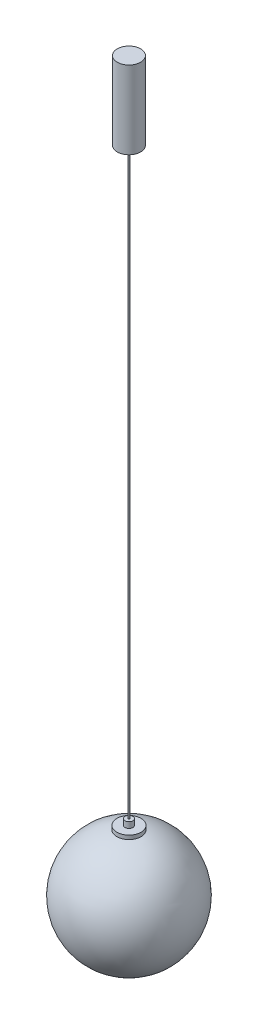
ISO-10303-21;
HEADER;
FILE_DESCRIPTION(('STEP AP214'),'2;1');
FILE_NAME('part.step','',(''),(''),'','','');
FILE_SCHEMA(('AUTOMOTIVE_DESIGN { 1 0 10303 214 1 1 1 1 }'));
ENDSEC;
DATA;
#1=APPLICATION_CONTEXT('core data for automotive mechanical design processes');
#2=APPLICATION_PROTOCOL_DEFINITION('international standard','automotive_design',2000,#1);
#3=PRODUCT_CONTEXT('',#1,'mechanical');
#4=PRODUCT('Part','Part','',(#3));
#5=PRODUCT_RELATED_PRODUCT_CATEGORY('part','',(#4));
#6=PRODUCT_DEFINITION_FORMATION('','',#4);
#7=PRODUCT_DEFINITION_CONTEXT('part definition',#1,'design');
#8=PRODUCT_DEFINITION('design','',#6,#7);
#9=PRODUCT_DEFINITION_SHAPE('','',#8);
#10=(LENGTH_UNIT() NAMED_UNIT(*) SI_UNIT(.MILLI.,.METRE.));
#11=(NAMED_UNIT(*) PLANE_ANGLE_UNIT() SI_UNIT($,.RADIAN.));
#12=(NAMED_UNIT(*) SI_UNIT($,.STERADIAN.) SOLID_ANGLE_UNIT());
#13=UNCERTAINTY_MEASURE_WITH_UNIT(LENGTH_MEASURE(1.E-05),#10,'distance_accuracy_value','');
#14=(GEOMETRIC_REPRESENTATION_CONTEXT(3) GLOBAL_UNCERTAINTY_ASSIGNED_CONTEXT((#13)) GLOBAL_UNIT_ASSIGNED_CONTEXT((#10,
#11,#12)) REPRESENTATION_CONTEXT('',''));
#15=CARTESIAN_POINT('',(0.,0.,0.));
#16=DIRECTION('',(0.,0.,1.));
#17=DIRECTION('',(1.,0.,0.));
#18=AXIS2_PLACEMENT_3D('',#15,#16,#17);
#19=CARTESIAN_POINT('',(-14.2363010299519,-53.0369721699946,0.));
#20=DIRECTION('',(0.,-1.,0.));
#21=DIRECTION('',(1.,0.,0.));
#22=AXIS2_PLACEMENT_3D('',#19,#20,#21);
#23=SPHERICAL_SURFACE('',#22,150.);
#24=CARTESIAN_POINT('',(-14.2363010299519,-203.036972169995,0.));
#25=VERTEX_POINT('',#24);
#26=VERTEX_LOOP('',#25);
#27=FACE_BOUND('',#26,.T.);
#28=ADVANCED_FACE('P0_F12',(#27),#23,.T.);
#29=CLOSED_SHELL('',(#28));
#30=MANIFOLD_SOLID_BREP('P0_B1',#29);
#31=CARTESIAN_POINT('',(-14.2363010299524,118.724739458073,0.));
#32=DIRECTION('',(0.,-1.,0.));
#33=DIRECTION('',(0.,0.,-1.));
#34=AXIS2_PLACEMENT_3D('',#31,#32,#33);
#35=CYLINDRICAL_SURFACE('',#34,10.);
#36=CARTESIAN_POINT('',(-14.2363010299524,118.724739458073,0.));
#37=DIRECTION('',(0.,1.,0.));
#38=DIRECTION('',(0.,0.,1.));
#39=AXIS2_PLACEMENT_3D('',#36,#37,#38);
#40=CIRCLE('',#39,10.);
#41=CARTESIAN_POINT('',(-14.2363010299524,118.724739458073,9.99999999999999));
#42=VERTEX_POINT('',#41);
#43=EDGE_CURVE('P1_E21',#42,#42,#40,.T.);
#44=ORIENTED_EDGE('',*,*,#43,.F.);
#45=EDGE_LOOP('',(#44));
#46=FACE_BOUND('',#45,.T.);
#47=CARTESIAN_POINT('',(-14.2363010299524,103.724739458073,0.));
#48=DIRECTION('',(0.,1.,0.));
#49=DIRECTION('',(0.,0.,1.));
#50=AXIS2_PLACEMENT_3D('',#47,#48,#49);
#51=CIRCLE('',#50,10.);
#52=CARTESIAN_POINT('',(-14.2363010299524,103.724739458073,9.99999999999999));
#53=VERTEX_POINT('',#52);
#54=EDGE_CURVE('P1_E17',#53,#53,#51,.T.);
#55=ORIENTED_EDGE('',*,*,#54,.T.);
#56=EDGE_LOOP('',(#55));
#57=FACE_BOUND('',#56,.T.);
#58=ADVANCED_FACE('P1_F14',(#46,#57),#35,.T.);
#59=CARTESIAN_POINT('',(-14.2363010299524,118.724739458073,0.));
#60=DIRECTION('',(0.,1.,0.));
#61=DIRECTION('',(0.,0.,1.));
#62=AXIS2_PLACEMENT_3D('',#59,#60,#61);
#63=PLANE('',#62);
#64=CARTESIAN_POINT('',(-14.2363010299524,118.724739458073,0.));
#65=DIRECTION('',(0.,1.,0.));
#66=DIRECTION('',(0.,0.,1.));
#67=AXIS2_PLACEMENT_3D('',#64,#65,#66);
#68=CIRCLE('',#67,2.);
#69=CARTESIAN_POINT('',(-14.2363010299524,118.724739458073,1.99999999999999));
#70=VERTEX_POINT('',#69);
#71=EDGE_CURVE('P1_E10',#70,#70,#68,.T.);
#72=ORIENTED_EDGE('',*,*,#71,.F.);
#73=EDGE_LOOP('',(#72));
#74=FACE_BOUND('',#73,.T.);
#75=ORIENTED_EDGE('',*,*,#43,.T.);
#76=EDGE_LOOP('',(#75));
#77=FACE_BOUND('',#76,.T.);
#78=ADVANCED_FACE('P1_F38',(#74,#77),#63,.T.);
#79=CARTESIAN_POINT('',(-14.2363010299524,103.724739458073,0.));
#80=DIRECTION('',(0.,1.,0.));
#81=DIRECTION('',(0.,0.,1.));
#82=AXIS2_PLACEMENT_3D('',#79,#80,#81);
#83=PLANE('',#82);
#84=ORIENTED_EDGE('',*,*,#54,.F.);
#85=EDGE_LOOP('',(#84));
#86=FACE_BOUND('',#85,.T.);
#87=ADVANCED_FACE('P1_F35',(#86),#83,.F.);
#88=CARTESIAN_POINT('',(-14.2363010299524,1618.72473945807,0.));
#89=DIRECTION('',(0.,-1.,0.));
#90=DIRECTION('',(0.,0.,-1.));
#91=AXIS2_PLACEMENT_3D('',#88,#89,#90);
#92=CYLINDRICAL_SURFACE('',#91,2.);
#93=CARTESIAN_POINT('',(-14.2363010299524,1618.72473945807,0.));
#94=DIRECTION('',(0.,1.,0.));
#95=DIRECTION('',(0.,0.,1.));
#96=AXIS2_PLACEMENT_3D('',#93,#94,#95);
#97=CIRCLE('',#96,2.);
#98=CARTESIAN_POINT('',(-14.2363010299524,1618.72473945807,1.99999999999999));
#99=VERTEX_POINT('',#98);
#100=EDGE_CURVE('P1_E27',#99,#99,#97,.T.);
#101=ORIENTED_EDGE('',*,*,#100,.F.);
#102=EDGE_LOOP('',(#101));
#103=FACE_BOUND('',#102,.T.);
#104=ORIENTED_EDGE('',*,*,#71,.T.);
#105=EDGE_LOOP('',(#104));
#106=FACE_BOUND('',#105,.T.);
#107=ADVANCED_FACE('P1_F37',(#103,#106),#92,.T.);
#108=CARTESIAN_POINT('',(-14.2363010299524,1618.72473945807,0.));
#109=DIRECTION('',(0.,1.,0.));
#110=DIRECTION('',(0.,0.,1.));
#111=AXIS2_PLACEMENT_3D('',#108,#109,#110);
#112=PLANE('',#111);
#113=ORIENTED_EDGE('',*,*,#100,.T.);
#114=EDGE_LOOP('',(#113));
#115=FACE_BOUND('',#114,.T.);
#116=ADVANCED_FACE('P1_F44',(#115),#112,.T.);
#117=CLOSED_SHELL('',(#58,#78,#87,#107,#116));
#118=MANIFOLD_SOLID_BREP('P1_B1',#117);
#119=CARTESIAN_POINT('',(-14.2363010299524,1818.72473945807,0.));
#120=DIRECTION('',(0.,-1.,0.));
#121=DIRECTION('',(0.,0.,-1.));
#122=AXIS2_PLACEMENT_3D('',#119,#120,#121);
#123=CYLINDRICAL_SURFACE('',#122,30.);
#124=CARTESIAN_POINT('',(-14.2363010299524,1818.72473945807,0.));
#125=DIRECTION('',(0.,1.,0.));
#126=DIRECTION('',(0.,0.,1.));
#127=AXIS2_PLACEMENT_3D('',#124,#125,#126);
#128=CIRCLE('',#127,30.);
#129=CARTESIAN_POINT('',(-14.2363010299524,1818.72473945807,30.));
#130=VERTEX_POINT('',#129);
#131=EDGE_CURVE('P2_E10',#130,#130,#128,.T.);
#132=ORIENTED_EDGE('',*,*,#131,.F.);
#133=EDGE_LOOP('',(#132));
#134=FACE_BOUND('',#133,.T.);
#135=CARTESIAN_POINT('',(-14.2363010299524,1618.72473945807,0.));
#136=DIRECTION('',(0.,1.,0.));
#137=DIRECTION('',(0.,0.,1.));
#138=AXIS2_PLACEMENT_3D('',#135,#136,#137);
#139=CIRCLE('',#138,30.);
#140=CARTESIAN_POINT('',(-14.2363010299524,1618.72473945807,30.));
#141=VERTEX_POINT('',#140);
#142=EDGE_CURVE('P2_E17',#141,#141,#139,.T.);
#143=ORIENTED_EDGE('',*,*,#142,.T.);
#144=EDGE_LOOP('',(#143));
#145=FACE_BOUND('',#144,.T.);
#146=ADVANCED_FACE('P2_F14',(#134,#145),#123,.T.);
#147=CARTESIAN_POINT('',(-14.2363010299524,1818.72473945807,0.));
#148=DIRECTION('',(0.,1.,0.));
#149=DIRECTION('',(0.,0.,1.));
#150=AXIS2_PLACEMENT_3D('',#147,#148,#149);
#151=PLANE('',#150);
#152=ORIENTED_EDGE('',*,*,#131,.T.);
#153=EDGE_LOOP('',(#152));
#154=FACE_BOUND('',#153,.T.);
#155=ADVANCED_FACE('P2_F29',(#154),#151,.T.);
#156=CARTESIAN_POINT('',(-14.2363010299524,1618.72473945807,0.));
#157=DIRECTION('',(0.,1.,0.));
#158=DIRECTION('',(0.,0.,1.));
#159=AXIS2_PLACEMENT_3D('',#156,#157,#158);
#160=PLANE('',#159);
#161=ORIENTED_EDGE('',*,*,#142,.F.);
#162=EDGE_LOOP('',(#161));
#163=FACE_BOUND('',#162,.T.);
#164=ADVANCED_FACE('P2_F27',(#163),#160,.F.);
#165=CLOSED_SHELL('',(#146,#155,#164));
#166=MANIFOLD_SOLID_BREP('P2_B1',#165);
#167=CARTESIAN_POINT('',(-14.2363010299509,-201.275260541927,2.51405389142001E-12));
#168=DIRECTION('',(-0.245485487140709,0.,0.969400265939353));
#169=DIRECTION('',(-0.969400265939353,0.,-0.245485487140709));
#170=AXIS2_PLACEMENT_3D('',#167,#168,#169);
#171=PLANE('',#170);
#172=DIRECTION('',(0.969400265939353,0.,0.245485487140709));
#173=VECTOR('',#172,1.);
#174=CARTESIAN_POINT('',(-14.236301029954,93.7247394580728,2.51405389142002E-12));
#175=LINE('',#174,#173);
#176=CARTESIAN_POINT('',(13.8763066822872,93.7247394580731,7.11907912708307));
#177=VERTEX_POINT('',#176);
#178=CARTESIAN_POINT('',(14.8457069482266,93.7247394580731,7.36456461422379));
#179=VERTEX_POINT('',#178);
#180=EDGE_CURVE('P3_E517',#177,#179,#175,.T.);
#181=ORIENTED_EDGE('',*,*,#180,.F.);
#182=DIRECTION('',(0.,1.,0.));
#183=VECTOR('',#182,1.);
#184=CARTESIAN_POINT('',(13.8763066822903,-201.275260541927,7.11907912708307));
#185=LINE('',#184,#183);
#186=CARTESIAN_POINT('',(13.8763066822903,-201.275260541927,7.11907912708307));
#187=VERTEX_POINT('',#186);
#188=EDGE_CURVE('P3_E11',#187,#177,#185,.T.);
#189=ORIENTED_EDGE('',*,*,#188,.F.);
#190=DIRECTION('',(0.969400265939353,0.,0.245485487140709));
#191=VECTOR('',#190,1.);
#192=CARTESIAN_POINT('',(-14.2363010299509,-201.275260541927,2.51405389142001E-12));
#193=LINE('',#192,#191);
#194=CARTESIAN_POINT('',(14.8457069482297,-201.275260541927,7.36456461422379));
#195=VERTEX_POINT('',#194);
#196=EDGE_CURVE('P3_E743',#187,#195,#193,.T.);
#197=ORIENTED_EDGE('',*,*,#196,.T.);
#198=DIRECTION('',(0.,1.,0.));
#199=VECTOR('',#198,1.);
#200=CARTESIAN_POINT('',(14.8457069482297,-201.275260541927,7.36456461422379));
#201=LINE('',#200,#199);
#202=EDGE_CURVE('P3_E32',#195,#179,#201,.T.);
#203=ORIENTED_EDGE('',*,*,#202,.T.);
#204=EDGE_LOOP('',(#181,#189,#197,#203));
#205=FACE_BOUND('',#204,.T.);
#206=ADVANCED_FACE('P3_F16',(#205),#171,.T.);
#207=CARTESIAN_POINT('',(-14.2363010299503,-201.275260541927,0.));
#208=DIRECTION('',(0.,1.,0.));
#209=DIRECTION('',(-1.,0.,0.));
#210=AXIS2_PLACEMENT_3D('',#207,#208,#209);
#211=CYLINDRICAL_SURFACE('',#210,29.);
#212=CARTESIAN_POINT('',(-14.2363010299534,93.7247394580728,0.));
#213=DIRECTION('',(0.,-1.,0.));
#214=DIRECTION('',(1.,0.,0.));
#215=AXIS2_PLACEMENT_3D('',#212,#213,#214);
#216=CIRCLE('',#215,29.);
#217=CARTESIAN_POINT('',(12.3719768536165,93.7247394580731,11.5325430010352));
#218=VERTEX_POINT('',#217);
#219=EDGE_CURVE('P3_E520',#177,#218,#216,.T.);
#220=ORIENTED_EDGE('',*,*,#219,.T.);
#221=DIRECTION('',(0.,1.,0.));
#222=VECTOR('',#221,1.);
#223=CARTESIAN_POINT('',(12.3719768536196,-201.275260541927,11.5325430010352));
#224=LINE('',#223,#222);
#225=CARTESIAN_POINT('',(12.3719768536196,-201.275260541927,11.5325430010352));
#226=VERTEX_POINT('',#225);
#227=EDGE_CURVE('P3_E24',#226,#218,#224,.T.);
#228=ORIENTED_EDGE('',*,*,#227,.F.);
#229=CARTESIAN_POINT('',(-14.2363010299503,-201.275260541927,0.));
#230=DIRECTION('',(0.,-1.,0.));
#231=DIRECTION('',(1.,0.,0.));
#232=AXIS2_PLACEMENT_3D('',#229,#230,#231);
#233=CIRCLE('',#232,29.);
#234=EDGE_CURVE('P3_E909',#187,#226,#233,.T.);
#235=ORIENTED_EDGE('',*,*,#234,.F.);
#236=ORIENTED_EDGE('',*,*,#188,.T.);
#237=EDGE_LOOP('',(#220,#228,#235,#236));
#238=FACE_BOUND('',#237,.T.);
#239=ADVANCED_FACE('P3_F895',(#238),#211,.T.);
#240=CARTESIAN_POINT('',(-14.2363010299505,-201.275260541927,3.54939136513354E-13));
#241=DIRECTION('',(0.397673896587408,0.,-0.917526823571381));
#242=DIRECTION('',(0.917526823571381,0.,0.397673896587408));
#243=AXIS2_PLACEMENT_3D('',#240,#241,#242);
#244=PLANE('',#243);
#245=DIRECTION('',(-0.917526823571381,0.,-0.397673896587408));
#246=VECTOR('',#245,1.);
#247=CARTESIAN_POINT('',(-14.2363010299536,93.7247394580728,3.54939136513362E-13));
#248=LINE('',#247,#246);
#249=CARTESIAN_POINT('',(13.2895036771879,93.7247394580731,11.9302168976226));
#250=VERTEX_POINT('',#249);
#251=EDGE_CURVE('P3_E524',#250,#218,#248,.T.);
#252=ORIENTED_EDGE('',*,*,#251,.F.);
#253=DIRECTION('',(0.,1.,0.));
#254=VECTOR('',#253,1.);
#255=CARTESIAN_POINT('',(13.289503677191,-201.275260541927,11.9302168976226));
#256=LINE('',#255,#254);
#257=CARTESIAN_POINT('',(13.289503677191,-201.275260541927,11.9302168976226));
#258=VERTEX_POINT('',#257);
#259=EDGE_CURVE('P3_E885',#258,#250,#256,.T.);
#260=ORIENTED_EDGE('',*,*,#259,.F.);
#261=DIRECTION('',(-0.917526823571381,0.,-0.397673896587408));
#262=VECTOR('',#261,1.);
#263=CARTESIAN_POINT('',(-14.2363010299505,-201.275260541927,3.54939136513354E-13));
#264=LINE('',#263,#262);
#265=EDGE_CURVE('P3_E892',#258,#226,#264,.T.);
#266=ORIENTED_EDGE('',*,*,#265,.T.);
#267=ORIENTED_EDGE('',*,*,#227,.T.);
#268=EDGE_LOOP('',(#252,#260,#266,#267));
#269=FACE_BOUND('',#268,.T.);
#270=ADVANCED_FACE('P3_F890',(#269),#244,.T.);
#271=CARTESIAN_POINT('',(-14.2363010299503,-201.275260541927,0.));
#272=DIRECTION('',(0.,1.,0.));
#273=DIRECTION('',(-1.,0.,0.));
#274=AXIS2_PLACEMENT_3D('',#271,#272,#273);
#275=CYLINDRICAL_SURFACE('',#274,30.);
#276=CARTESIAN_POINT('',(-14.2363010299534,93.7247394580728,0.));
#277=DIRECTION('',(0.,-1.,0.));
#278=DIRECTION('',(1.,0.,0.));
#279=AXIS2_PLACEMENT_3D('',#276,#277,#278);
#280=CIRCLE('',#279,30.);
#281=CARTESIAN_POINT('',(10.8786933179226,93.724739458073,16.4084447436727));
#282=VERTEX_POINT('',#281);
#283=EDGE_CURVE('P3_E527',#282,#250,#280,.F.);
#284=ORIENTED_EDGE('',*,*,#283,.F.);
#285=DIRECTION('',(0.,1.,0.));
#286=VECTOR('',#285,1.);
#287=CARTESIAN_POINT('',(10.8786933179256,-201.275260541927,16.4084447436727));
#288=LINE('',#287,#286);
#289=CARTESIAN_POINT('',(10.8786933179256,-201.275260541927,16.4084447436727));
#290=VERTEX_POINT('',#289);
#291=EDGE_CURVE('P3_E883',#290,#282,#288,.T.);
#292=ORIENTED_EDGE('',*,*,#291,.F.);
#293=CARTESIAN_POINT('',(-14.2363010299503,-201.275260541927,0.));
#294=DIRECTION('',(0.,-1.,0.));
#295=DIRECTION('',(1.,0.,0.));
#296=AXIS2_PLACEMENT_3D('',#293,#294,#295);
#297=CIRCLE('',#296,30.);
#298=EDGE_CURVE('P3_E906',#290,#258,#297,.F.);
#299=ORIENTED_EDGE('',*,*,#298,.T.);
#300=ORIENTED_EDGE('',*,*,#259,.T.);
#301=EDGE_LOOP('',(#284,#292,#299,#300));
#302=FACE_BOUND('',#301,.T.);
#303=ADVANCED_FACE('P3_F903',(#302),#275,.T.);
#304=CARTESIAN_POINT('',(-14.2363010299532,-201.275260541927,4.38725432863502E-12));
#305=DIRECTION('',(-0.546948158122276,0.,0.837166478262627));
#306=DIRECTION('',(-0.837166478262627,0.,-0.546948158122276));
#307=AXIS2_PLACEMENT_3D('',#304,#305,#306);
#308=PLANE('',#307);
#309=DIRECTION('',(0.837166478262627,0.,0.546948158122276));
#310=VECTOR('',#309,1.);
#311=CARTESIAN_POINT('',(-14.2363010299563,93.7247394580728,4.38725432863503E-12));
#312=LINE('',#311,#310);
#313=CARTESIAN_POINT('',(10.0415268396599,93.724739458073,15.8614965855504));
#314=VERTEX_POINT('',#313);
#315=EDGE_CURVE('P3_E530',#314,#282,#312,.T.);
#316=ORIENTED_EDGE('',*,*,#315,.F.);
#317=DIRECTION('',(0.,1.,0.));
#318=VECTOR('',#317,1.);
#319=CARTESIAN_POINT('',(10.041526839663,-201.275260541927,15.8614965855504));
#320=LINE('',#319,#318);
#321=CARTESIAN_POINT('',(10.041526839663,-201.275260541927,15.8614965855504));
#322=VERTEX_POINT('',#321);
#323=EDGE_CURVE('P3_E881',#322,#314,#320,.T.);
#324=ORIENTED_EDGE('',*,*,#323,.F.);
#325=DIRECTION('',(0.837166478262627,0.,0.546948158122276));
#326=VECTOR('',#325,1.);
#327=CARTESIAN_POINT('',(-14.2363010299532,-201.275260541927,4.38725432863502E-12));
#328=LINE('',#327,#326);
#329=EDGE_CURVE('P3_E911',#322,#290,#328,.T.);
#330=ORIENTED_EDGE('',*,*,#329,.T.);
#331=ORIENTED_EDGE('',*,*,#291,.T.);
#332=EDGE_LOOP('',(#316,#324,#330,#331));
#333=FACE_BOUND('',#332,.T.);
#334=ADVANCED_FACE('P3_F1137',(#333),#308,.T.);
#335=CARTESIAN_POINT('',(-14.2363010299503,-201.275260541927,0.));
#336=DIRECTION('',(0.,1.,0.));
#337=DIRECTION('',(-1.,0.,0.));
#338=AXIS2_PLACEMENT_3D('',#335,#336,#337);
#339=CYLINDRICAL_SURFACE('',#338,29.);
#340=CARTESIAN_POINT('',(-14.2363010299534,93.7247394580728,0.));
#341=DIRECTION('',(0.,-1.,0.));
#342=DIRECTION('',(1.,0.,0.));
#343=AXIS2_PLACEMENT_3D('',#340,#341,#342);
#344=CIRCLE('',#343,29.);
#345=CARTESIAN_POINT('',(7.18565637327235,93.724739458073,19.5473717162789));
#346=VERTEX_POINT('',#345);
#347=EDGE_CURVE('P3_E533',#314,#346,#344,.T.);
#348=ORIENTED_EDGE('',*,*,#347,.T.);
#349=DIRECTION('',(0.,1.,0.));
#350=VECTOR('',#349,1.);
#351=CARTESIAN_POINT('',(7.18565637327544,-201.275260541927,19.5473717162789));
#352=LINE('',#351,#350);
#353=CARTESIAN_POINT('',(7.18565637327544,-201.275260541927,19.5473717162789));
#354=VERTEX_POINT('',#353);
#355=EDGE_CURVE('P3_E879',#354,#346,#352,.T.);
#356=ORIENTED_EDGE('',*,*,#355,.F.);
#357=CARTESIAN_POINT('',(-14.2363010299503,-201.275260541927,0.));
#358=DIRECTION('',(0.,-1.,0.));
#359=DIRECTION('',(1.,0.,0.));
#360=AXIS2_PLACEMENT_3D('',#357,#358,#359);
#361=CIRCLE('',#360,29.);
#362=EDGE_CURVE('P3_E917',#322,#354,#361,.T.);
#363=ORIENTED_EDGE('',*,*,#362,.F.);
#364=ORIENTED_EDGE('',*,*,#323,.T.);
#365=EDGE_LOOP('',(#348,#356,#363,#364));
#366=FACE_BOUND('',#365,.T.);
#367=ADVANCED_FACE('P3_F1140',(#366),#339,.T.);
#368=CARTESIAN_POINT('',(-14.2363010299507,-201.275260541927,3.98521538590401E-13));
#369=DIRECTION('',(0.674047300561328,0.,-0.738688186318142));
#370=DIRECTION('',(0.738688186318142,0.,0.674047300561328));
#371=AXIS2_PLACEMENT_3D('',#368,#369,#370);
#372=PLANE('',#371);
#373=DIRECTION('',(-0.738688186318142,0.,-0.674047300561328));
#374=VECTOR('',#373,1.);
#375=CARTESIAN_POINT('',(-14.2363010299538,93.7247394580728,3.98521538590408E-13));
#376=LINE('',#375,#374);
#377=CARTESIAN_POINT('',(7.9243445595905,93.724739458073,20.2214190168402));
#378=VERTEX_POINT('',#377);
#379=EDGE_CURVE('P3_E536',#378,#346,#376,.T.);
#380=ORIENTED_EDGE('',*,*,#379,.F.);
#381=DIRECTION('',(0.,1.,0.));
#382=VECTOR('',#381,1.);
#383=CARTESIAN_POINT('',(7.92434455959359,-201.275260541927,20.2214190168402));
#384=LINE('',#383,#382);
#385=CARTESIAN_POINT('',(7.92434455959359,-201.275260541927,20.2214190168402));
#386=VERTEX_POINT('',#385);
#387=EDGE_CURVE('P3_E877',#386,#378,#384,.T.);
#388=ORIENTED_EDGE('',*,*,#387,.F.);
#389=DIRECTION('',(-0.738688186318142,0.,-0.674047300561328));
#390=VECTOR('',#389,1.);
#391=CARTESIAN_POINT('',(-14.2363010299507,-201.275260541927,3.98521538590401E-13));
#392=LINE('',#391,#390);
#393=EDGE_CURVE('P3_E919',#386,#354,#392,.T.);
#394=ORIENTED_EDGE('',*,*,#393,.T.);
#395=ORIENTED_EDGE('',*,*,#355,.T.);
#396=EDGE_LOOP('',(#380,#388,#394,#395));
#397=FACE_BOUND('',#396,.T.);
#398=ADVANCED_FACE('P3_F1144',(#397),#372,.T.);
#399=CARTESIAN_POINT('',(-14.2363010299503,-201.275260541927,0.));
#400=DIRECTION('',(0.,1.,0.));
#401=DIRECTION('',(-1.,0.,0.));
#402=AXIS2_PLACEMENT_3D('',#399,#400,#401);
#403=CYLINDRICAL_SURFACE('',#402,30.);
#404=CARTESIAN_POINT('',(-14.2363010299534,93.7247394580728,0.));
#405=DIRECTION('',(0.,-1.,0.));
#406=DIRECTION('',(1.,0.,0.));
#407=AXIS2_PLACEMENT_3D('',#404,#405,#406);
#408=CIRCLE('',#407,30.);
#409=CARTESIAN_POINT('',(4.19008035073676,93.724739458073,23.6742152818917));
#410=VERTEX_POINT('',#409);
#411=EDGE_CURVE('P3_E539',#410,#378,#408,.F.);
#412=ORIENTED_EDGE('',*,*,#411,.F.);
#413=DIRECTION('',(0.,1.,0.));
#414=VECTOR('',#413,1.);
#415=CARTESIAN_POINT('',(4.19008035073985,-201.275260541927,23.6742152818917));
#416=LINE('',#415,#414);
#417=CARTESIAN_POINT('',(4.19008035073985,-201.275260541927,23.6742152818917));
#418=VERTEX_POINT('',#417);
#419=EDGE_CURVE('P3_E875',#418,#410,#416,.T.);
#420=ORIENTED_EDGE('',*,*,#419,.F.);
#421=CARTESIAN_POINT('',(-14.2363010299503,-201.275260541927,0.));
#422=DIRECTION('',(0.,-1.,0.));
#423=DIRECTION('',(1.,0.,0.));
#424=AXIS2_PLACEMENT_3D('',#421,#422,#423);
#425=CIRCLE('',#424,30.);
#426=EDGE_CURVE('P3_E922',#418,#386,#425,.F.);
#427=ORIENTED_EDGE('',*,*,#426,.T.);
#428=ORIENTED_EDGE('',*,*,#387,.T.);
#429=EDGE_LOOP('',(#412,#420,#427,#428));
#430=FACE_BOUND('',#429,.T.);
#431=ADVANCED_FACE('P3_F1148',(#430),#403,.T.);
#432=CARTESIAN_POINT('',(-14.2363010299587,-201.275260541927,6.56874099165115E-12));
#433=DIRECTION('',(-0.789140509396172,0.,0.614212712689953));
#434=DIRECTION('',(-0.614212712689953,0.,-0.789140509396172));
#435=AXIS2_PLACEMENT_3D('',#432,#433,#434);
#436=PLANE('',#435);
#437=DIRECTION('',(0.614212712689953,0.,0.789140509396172));
#438=VECTOR('',#437,1.);
#439=CARTESIAN_POINT('',(-14.2363010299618,93.7247394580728,6.56874099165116E-12));
#440=LINE('',#439,#438);
#441=CARTESIAN_POINT('',(3.5758676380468,93.724739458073,22.8850747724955));
#442=VERTEX_POINT('',#441);
#443=EDGE_CURVE('P3_E542',#442,#410,#440,.T.);
#444=ORIENTED_EDGE('',*,*,#443,.F.);
#445=DIRECTION('',(0.,1.,0.));
#446=VECTOR('',#445,1.);
#447=CARTESIAN_POINT('',(3.57586763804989,-201.275260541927,22.8850747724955));
#448=LINE('',#447,#446);
#449=CARTESIAN_POINT('',(3.57586763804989,-201.275260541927,22.8850747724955));
#450=VERTEX_POINT('',#449);
#451=EDGE_CURVE('P3_E873',#450,#442,#448,.T.);
#452=ORIENTED_EDGE('',*,*,#451,.F.);
#453=DIRECTION('',(0.614212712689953,0.,0.789140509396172));
#454=VECTOR('',#453,1.);
#455=CARTESIAN_POINT('',(-14.2363010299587,-201.275260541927,6.56874099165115E-12));
#456=LINE('',#455,#454);
#457=EDGE_CURVE('P3_E925',#450,#418,#456,.T.);
#458=ORIENTED_EDGE('',*,*,#457,.T.);
#459=ORIENTED_EDGE('',*,*,#419,.T.);
#460=EDGE_LOOP('',(#444,#452,#458,#459));
#461=FACE_BOUND('',#460,.T.);
#462=ADVANCED_FACE('P3_F1152',(#461),#436,.T.);
#463=CARTESIAN_POINT('',(-14.2363010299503,-201.275260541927,0.));
#464=DIRECTION('',(0.,1.,0.));
#465=DIRECTION('',(-1.,0.,0.));
#466=AXIS2_PLACEMENT_3D('',#463,#464,#465);
#467=CYLINDRICAL_SURFACE('',#466,29.);
#468=CARTESIAN_POINT('',(-14.2363010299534,93.7247394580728,0.));
#469=DIRECTION('',(0.,-1.,0.));
#470=DIRECTION('',(1.,0.,0.));
#471=AXIS2_PLACEMENT_3D('',#468,#469,#470);
#472=CIRCLE('',#471,29.);
#473=CARTESIAN_POINT('',(-0.322065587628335,93.7247394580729,25.4439393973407));
#474=VERTEX_POINT('',#473);
#475=EDGE_CURVE('P3_E545',#442,#474,#472,.T.);
#476=ORIENTED_EDGE('',*,*,#475,.T.);
#477=DIRECTION('',(0.,1.,0.));
#478=VECTOR('',#477,1.);
#479=CARTESIAN_POINT('',(-0.322065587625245,-201.275260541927,25.4439393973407));
#480=LINE('',#479,#478);
#481=CARTESIAN_POINT('',(-0.322065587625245,-201.275260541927,25.4439393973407));
#482=VERTEX_POINT('',#481);
#483=EDGE_CURVE('P3_E871',#482,#474,#480,.T.);
#484=ORIENTED_EDGE('',*,*,#483,.F.);
#485=CARTESIAN_POINT('',(-14.2363010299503,-201.275260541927,0.));
#486=DIRECTION('',(0.,-1.,0.));
#487=DIRECTION('',(1.,0.,0.));
#488=AXIS2_PLACEMENT_3D('',#485,#486,#487);
#489=CIRCLE('',#488,29.);
#490=EDGE_CURVE('P3_E928',#450,#482,#489,.T.);
#491=ORIENTED_EDGE('',*,*,#490,.F.);
#492=ORIENTED_EDGE('',*,*,#451,.T.);
#493=EDGE_LOOP('',(#476,#484,#491,#492));
#494=FACE_BOUND('',#493,.T.);
#495=ADVANCED_FACE('P3_F1156',(#494),#467,.T.);
#496=CARTESIAN_POINT('',(-14.2363010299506,-201.275260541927,1.8394326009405E-13));
#497=DIRECTION('',(0.877377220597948,0.,-0.479801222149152));
#498=DIRECTION('',(0.479801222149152,0.,0.877377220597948));
#499=AXIS2_PLACEMENT_3D('',#496,#497,#498);
#500=PLANE('',#499);
#501=DIRECTION('',(-0.479801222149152,0.,-0.877377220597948));
#502=VECTOR('',#501,1.);
#503=CARTESIAN_POINT('',(-14.2363010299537,93.7247394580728,1.83943260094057E-13));
#504=LINE('',#503,#502);
#505=CARTESIAN_POINT('',(0.15773563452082,93.7247394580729,26.3213166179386));
#506=VERTEX_POINT('',#505);
#507=EDGE_CURVE('P3_E548',#506,#474,#504,.T.);
#508=ORIENTED_EDGE('',*,*,#507,.F.);
#509=DIRECTION('',(0.,1.,0.));
#510=VECTOR('',#509,1.);
#511=CARTESIAN_POINT('',(0.15773563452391,-201.275260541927,26.3213166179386));
#512=LINE('',#511,#510);
#513=CARTESIAN_POINT('',(0.15773563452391,-201.275260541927,26.3213166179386));
#514=VERTEX_POINT('',#513);
#515=EDGE_CURVE('P3_E869',#514,#506,#512,.T.);
#516=ORIENTED_EDGE('',*,*,#515,.F.);
#517=DIRECTION('',(-0.479801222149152,0.,-0.877377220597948));
#518=VECTOR('',#517,1.);
#519=CARTESIAN_POINT('',(-14.2363010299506,-201.275260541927,1.8394326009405E-13));
#520=LINE('',#519,#518);
#521=EDGE_CURVE('P3_E930',#514,#482,#520,.T.);
#522=ORIENTED_EDGE('',*,*,#521,.T.);
#523=ORIENTED_EDGE('',*,*,#483,.T.);
#524=EDGE_LOOP('',(#508,#516,#522,#523));
#525=FACE_BOUND('',#524,.T.);
#526=ADVANCED_FACE('P3_F1160',(#525),#500,.T.);
#527=CARTESIAN_POINT('',(-14.2363010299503,-201.275260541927,0.));
#528=DIRECTION('',(0.,1.,0.));
#529=DIRECTION('',(-1.,0.,0.));
#530=AXIS2_PLACEMENT_3D('',#527,#528,#529);
#531=CYLINDRICAL_SURFACE('',#530,30.);
#532=CARTESIAN_POINT('',(-14.2363010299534,93.7247394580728,0.));
#533=DIRECTION('',(0.,-1.,0.));
#534=DIRECTION('',(1.,0.,0.));
#535=AXIS2_PLACEMENT_3D('',#532,#533,#534);
#536=CIRCLE('',#535,30.);
#537=CARTESIAN_POINT('',(-4.49531695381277,93.7247394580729,28.374517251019));
#538=VERTEX_POINT('',#537);
#539=EDGE_CURVE('P3_E551',#538,#506,#536,.F.);
#540=ORIENTED_EDGE('',*,*,#539,.F.);
#541=DIRECTION('',(0.,1.,0.));
#542=VECTOR('',#541,1.);
#543=CARTESIAN_POINT('',(-4.49531695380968,-201.275260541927,28.374517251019));
#544=LINE('',#543,#542);
#545=CARTESIAN_POINT('',(-4.49531695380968,-201.275260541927,28.374517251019));
#546=VERTEX_POINT('',#545);
#547=EDGE_CURVE('P3_E867',#546,#538,#544,.T.);
#548=ORIENTED_EDGE('',*,*,#547,.F.);
#549=CARTESIAN_POINT('',(-14.2363010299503,-201.275260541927,0.));
#550=DIRECTION('',(0.,-1.,0.));
#551=DIRECTION('',(1.,0.,0.));
#552=AXIS2_PLACEMENT_3D('',#549,#550,#551);
#553=CIRCLE('',#552,30.);
#554=EDGE_CURVE('P3_E933',#546,#514,#553,.F.);
#555=ORIENTED_EDGE('',*,*,#554,.T.);
#556=ORIENTED_EDGE('',*,*,#515,.T.);
#557=EDGE_LOOP('',(#540,#548,#555,#556));
#558=FACE_BOUND('',#557,.T.);
#559=ADVANCED_FACE('P3_F1164',(#558),#531,.T.);
#560=CARTESIAN_POINT('',(-14.2363010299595,-201.275260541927,3.16385271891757E-12));
#561=DIRECTION('',(-0.945817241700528,0.,0.324699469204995));
#562=DIRECTION('',(-0.324699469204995,0.,-0.945817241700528));
#563=AXIS2_PLACEMENT_3D('',#560,#561,#562);
#564=PLANE('',#563);
#565=DIRECTION('',(0.324699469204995,0.,0.945817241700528));
#566=VECTOR('',#565,1.);
#567=CARTESIAN_POINT('',(-14.2363010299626,93.7247394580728,3.16385271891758E-12));
#568=LINE('',#567,#566);
#569=CARTESIAN_POINT('',(-4.82001642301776,93.7247394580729,27.4287000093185));
#570=VERTEX_POINT('',#569);
#571=EDGE_CURVE('P3_E554',#570,#538,#568,.T.);
#572=ORIENTED_EDGE('',*,*,#571,.F.);
#573=DIRECTION('',(0.,1.,0.));
#574=VECTOR('',#573,1.);
#575=CARTESIAN_POINT('',(-4.82001642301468,-201.275260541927,27.4287000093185));
#576=LINE('',#575,#574);
#577=CARTESIAN_POINT('',(-4.82001642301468,-201.275260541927,27.4287000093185));
#578=VERTEX_POINT('',#577);
#579=EDGE_CURVE('P3_E865',#578,#570,#576,.T.);
#580=ORIENTED_EDGE('',*,*,#579,.F.);
#581=DIRECTION('',(0.324699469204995,0.,0.945817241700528));
#582=VECTOR('',#581,1.);
#583=CARTESIAN_POINT('',(-14.2363010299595,-201.275260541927,3.16385271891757E-12));
#584=LINE('',#583,#582);
#585=EDGE_CURVE('P3_E936',#578,#546,#584,.T.);
#586=ORIENTED_EDGE('',*,*,#585,.T.);
#587=ORIENTED_EDGE('',*,*,#547,.T.);
#588=EDGE_LOOP('',(#572,#580,#586,#587));
#589=FACE_BOUND('',#588,.T.);
#590=ADVANCED_FACE('P3_F1168',(#589),#564,.T.);
#591=CARTESIAN_POINT('',(-14.2363010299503,-201.275260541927,0.));
#592=DIRECTION('',(0.,1.,0.));
#593=DIRECTION('',(-1.,0.,0.));
#594=AXIS2_PLACEMENT_3D('',#591,#592,#593);
#595=CYLINDRICAL_SURFACE('',#594,29.);
#596=CARTESIAN_POINT('',(-14.2363010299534,93.7247394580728,0.));
#597=DIRECTION('',(0.,-1.,0.));
#598=DIRECTION('',(1.,0.,0.));
#599=AXIS2_PLACEMENT_3D('',#596,#597,#598);
#600=CIRCLE('',#599,29.);
#601=CARTESIAN_POINT('',(-9.33761086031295,93.7247394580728,28.5832614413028));
#602=VERTEX_POINT('',#601);
#603=EDGE_CURVE('P3_E557',#570,#602,#600,.T.);
#604=ORIENTED_EDGE('',*,*,#603,.T.);
#605=DIRECTION('',(0.,1.,0.));
#606=VECTOR('',#605,1.);
#607=CARTESIAN_POINT('',(-9.33761086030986,-201.275260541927,28.5832614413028));
#608=LINE('',#607,#606);
#609=CARTESIAN_POINT('',(-9.33761086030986,-201.275260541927,28.5832614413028));
#610=VERTEX_POINT('',#609);
#611=EDGE_CURVE('P3_E863',#610,#602,#608,.T.);
#612=ORIENTED_EDGE('',*,*,#611,.F.);
#613=CARTESIAN_POINT('',(-14.2363010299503,-201.275260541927,0.));
#614=DIRECTION('',(0.,-1.,0.));
#615=DIRECTION('',(1.,0.,0.));
#616=AXIS2_PLACEMENT_3D('',#613,#614,#615);
#617=CIRCLE('',#616,29.);
#618=EDGE_CURVE('P3_E939',#578,#610,#617,.T.);
#619=ORIENTED_EDGE('',*,*,#618,.F.);
#620=ORIENTED_EDGE('',*,*,#579,.T.);
#621=EDGE_LOOP('',(#604,#612,#619,#620));
#622=FACE_BOUND('',#621,.T.);
#623=ADVANCED_FACE('P3_F1172',(#622),#595,.T.);
#624=CARTESIAN_POINT('',(-14.2363010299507,-201.275260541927,0.));
#625=DIRECTION('',(0.985629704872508,0.,-0.168920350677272));
#626=DIRECTION('',(0.168920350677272,0.,0.985629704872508));
#627=AXIS2_PLACEMENT_3D('',#624,#625,#626);
#628=PLANE('',#627);
#629=DIRECTION('',(-0.168920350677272,0.,-0.985629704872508));
#630=VECTOR('',#629,1.);
#631=CARTESIAN_POINT('',(-14.2363010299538,93.7247394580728,0.));
#632=LINE('',#631,#630);
#633=CARTESIAN_POINT('',(-9.16869050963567,93.7247394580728,29.5688911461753));
#634=VERTEX_POINT('',#633);
#635=EDGE_CURVE('P3_E560',#634,#602,#632,.T.);
#636=ORIENTED_EDGE('',*,*,#635,.F.);
#637=DIRECTION('',(0.,1.,0.));
#638=VECTOR('',#637,1.);
#639=CARTESIAN_POINT('',(-9.16869050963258,-201.275260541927,29.5688911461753));
#640=LINE('',#639,#638);
#641=CARTESIAN_POINT('',(-9.16869050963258,-201.275260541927,29.5688911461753));
#642=VERTEX_POINT('',#641);
#643=EDGE_CURVE('P3_E861',#642,#634,#640,.T.);
#644=ORIENTED_EDGE('',*,*,#643,.F.);
#645=DIRECTION('',(-0.168920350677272,0.,-0.985629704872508));
#646=VECTOR('',#645,1.);
#647=CARTESIAN_POINT('',(-14.2363010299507,-201.275260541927,0.));
#648=LINE('',#647,#646);
#649=EDGE_CURVE('P3_E941',#642,#610,#648,.T.);
#650=ORIENTED_EDGE('',*,*,#649,.T.);
#651=ORIENTED_EDGE('',*,*,#611,.T.);
#652=EDGE_LOOP('',(#636,#644,#650,#651));
#653=FACE_BOUND('',#652,.T.);
#654=ADVANCED_FACE('P3_F1176',(#653),#628,.T.);
#655=CARTESIAN_POINT('',(-14.2363010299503,-201.275260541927,0.));
#656=DIRECTION('',(0.,1.,0.));
#657=DIRECTION('',(-1.,0.,0.));
#658=AXIS2_PLACEMENT_3D('',#655,#656,#657);
#659=CYLINDRICAL_SURFACE('',#658,30.);
#660=CARTESIAN_POINT('',(-14.2363010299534,93.7247394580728,0.));
#661=DIRECTION('',(0.,-1.,0.));
#662=DIRECTION('',(1.,0.,0.));
#663=AXIS2_PLACEMENT_3D('',#660,#661,#662);
#664=CIRCLE('',#663,30.);
#665=CARTESIAN_POINT('',(-14.2363010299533,93.7247394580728,30.));
#666=VERTEX_POINT('',#665);
#667=EDGE_CURVE('P3_E563',#666,#634,#664,.F.);
#668=ORIENTED_EDGE('',*,*,#667,.F.);
#669=DIRECTION('',(0.,1.,0.));
#670=VECTOR('',#669,1.);
#671=CARTESIAN_POINT('',(-14.2363010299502,-201.275260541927,30.));
#672=LINE('',#671,#670);
#673=CARTESIAN_POINT('',(-14.2363010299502,-201.275260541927,30.));
#674=VERTEX_POINT('',#673);
#675=EDGE_CURVE('P3_E859',#674,#666,#672,.T.);
#676=ORIENTED_EDGE('',*,*,#675,.F.);
#677=CARTESIAN_POINT('',(-14.2363010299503,-201.275260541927,0.));
#678=DIRECTION('',(0.,-1.,0.));
#679=DIRECTION('',(1.,0.,0.));
#680=AXIS2_PLACEMENT_3D('',#677,#678,#679);
#681=CIRCLE('',#680,30.);
#682=EDGE_CURVE('P3_E944',#674,#642,#681,.F.);
#683=ORIENTED_EDGE('',*,*,#682,.T.);
#684=ORIENTED_EDGE('',*,*,#643,.T.);
#685=EDGE_LOOP('',(#668,#676,#683,#684));
#686=FACE_BOUND('',#685,.T.);
#687=ADVANCED_FACE('P3_F1180',(#686),#659,.T.);
#688=CARTESIAN_POINT('',(-14.2363010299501,-201.275260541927,0.));
#689=DIRECTION('',(-1.,0.,0.));
#690=DIRECTION('',(0.,0.,-1.));
#691=AXIS2_PLACEMENT_3D('',#688,#689,#690);
#692=PLANE('',#691);
#693=DIRECTION('',(0.,0.,1.));
#694=VECTOR('',#693,1.);
#695=CARTESIAN_POINT('',(-14.2363010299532,93.7247394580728,0.));
#696=LINE('',#695,#694);
#697=CARTESIAN_POINT('',(-14.2363010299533,93.7247394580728,29.));
#698=VERTEX_POINT('',#697);
#699=EDGE_CURVE('P3_E566',#698,#666,#696,.T.);
#700=ORIENTED_EDGE('',*,*,#699,.F.);
#701=DIRECTION('',(0.,1.,0.));
#702=VECTOR('',#701,1.);
#703=CARTESIAN_POINT('',(-14.2363010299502,-201.275260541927,29.));
#704=LINE('',#703,#702);
#705=CARTESIAN_POINT('',(-14.2363010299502,-201.275260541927,29.));
#706=VERTEX_POINT('',#705);
#707=EDGE_CURVE('P3_E857',#706,#698,#704,.T.);
#708=ORIENTED_EDGE('',*,*,#707,.F.);
#709=DIRECTION('',(0.,0.,1.));
#710=VECTOR('',#709,1.);
#711=CARTESIAN_POINT('',(-14.2363010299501,-201.275260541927,0.));
#712=LINE('',#711,#710);
#713=EDGE_CURVE('P3_E947',#706,#674,#712,.T.);
#714=ORIENTED_EDGE('',*,*,#713,.T.);
#715=ORIENTED_EDGE('',*,*,#675,.T.);
#716=EDGE_LOOP('',(#700,#708,#714,#715));
#717=FACE_BOUND('',#716,.T.);
#718=ADVANCED_FACE('P3_F1184',(#717),#692,.T.);
#719=CARTESIAN_POINT('',(-14.2363010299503,-201.275260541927,0.));
#720=DIRECTION('',(0.,1.,0.));
#721=DIRECTION('',(-1.,0.,0.));
#722=AXIS2_PLACEMENT_3D('',#719,#720,#721);
#723=CYLINDRICAL_SURFACE('',#722,29.);
#724=CARTESIAN_POINT('',(-14.2363010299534,93.7247394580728,0.));
#725=DIRECTION('',(0.,-1.,0.));
#726=DIRECTION('',(1.,0.,0.));
#727=AXIS2_PLACEMENT_3D('',#724,#725,#726);
#728=CIRCLE('',#727,29.);
#729=CARTESIAN_POINT('',(-18.8840052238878,93.7247394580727,28.6251435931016));
#730=VERTEX_POINT('',#729);
#731=EDGE_CURVE('P3_E569',#698,#730,#728,.T.);
#732=ORIENTED_EDGE('',*,*,#731,.T.);
#733=DIRECTION('',(0.,1.,0.));
#734=VECTOR('',#733,1.);
#735=CARTESIAN_POINT('',(-18.8840052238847,-201.275260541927,28.6251435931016));
#736=LINE('',#735,#734);
#737=CARTESIAN_POINT('',(-18.8840052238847,-201.275260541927,28.6251435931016));
#738=VERTEX_POINT('',#737);
#739=EDGE_CURVE('P3_E855',#738,#730,#736,.T.);
#740=ORIENTED_EDGE('',*,*,#739,.F.);
#741=CARTESIAN_POINT('',(-14.2363010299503,-201.275260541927,0.));
#742=DIRECTION('',(0.,-1.,0.));
#743=DIRECTION('',(1.,0.,0.));
#744=AXIS2_PLACEMENT_3D('',#741,#742,#743);
#745=CIRCLE('',#744,29.);
#746=EDGE_CURVE('P3_E950',#706,#738,#745,.T.);
#747=ORIENTED_EDGE('',*,*,#746,.F.);
#748=ORIENTED_EDGE('',*,*,#707,.T.);
#749=EDGE_LOOP('',(#732,#740,#747,#748));
#750=FACE_BOUND('',#749,.T.);
#751=ADVANCED_FACE('P3_F1188',(#750),#723,.T.);
#752=CARTESIAN_POINT('',(-14.2363010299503,-201.275260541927,0.));
#753=DIRECTION('',(0.987073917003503,0.,0.160265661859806));
#754=DIRECTION('',(-0.160265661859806,0.,0.987073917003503));
#755=AXIS2_PLACEMENT_3D('',#752,#753,#754);
#756=PLANE('',#755);
#757=DIRECTION('',(0.160265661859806,0.,-0.987073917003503));
#758=VECTOR('',#757,1.);
#759=CARTESIAN_POINT('',(-14.2363010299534,93.7247394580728,0.));
#760=LINE('',#759,#758);
#761=CARTESIAN_POINT('',(-19.0442708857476,93.7247394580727,29.6122175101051));
#762=VERTEX_POINT('',#761);
#763=EDGE_CURVE('P3_E572',#762,#730,#760,.T.);
#764=ORIENTED_EDGE('',*,*,#763,.F.);
#765=DIRECTION('',(0.,1.,0.));
#766=VECTOR('',#765,1.);
#767=CARTESIAN_POINT('',(-19.0442708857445,-201.275260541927,29.6122175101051));
#768=LINE('',#767,#766);
#769=CARTESIAN_POINT('',(-19.0442708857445,-201.275260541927,29.6122175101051));
#770=VERTEX_POINT('',#769);
#771=EDGE_CURVE('P3_E853',#770,#762,#768,.T.);
#772=ORIENTED_EDGE('',*,*,#771,.F.);
#773=DIRECTION('',(0.160265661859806,0.,-0.987073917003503));
#774=VECTOR('',#773,1.);
#775=CARTESIAN_POINT('',(-14.2363010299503,-201.275260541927,0.));
#776=LINE('',#775,#774);
#777=EDGE_CURVE('P3_E952',#770,#738,#776,.T.);
#778=ORIENTED_EDGE('',*,*,#777,.T.);
#779=ORIENTED_EDGE('',*,*,#739,.T.);
#780=EDGE_LOOP('',(#764,#772,#778,#779));
#781=FACE_BOUND('',#780,.T.);
#782=ADVANCED_FACE('P3_F1192',(#781),#756,.T.);
#783=CARTESIAN_POINT('',(-14.2363010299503,-201.275260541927,0.));
#784=DIRECTION('',(0.,1.,0.));
#785=DIRECTION('',(-1.,0.,0.));
#786=AXIS2_PLACEMENT_3D('',#783,#784,#785);
#787=CYLINDRICAL_SURFACE('',#786,30.);
#788=CARTESIAN_POINT('',(-14.2363010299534,93.7247394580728,0.));
#789=DIRECTION('',(0.,-1.,0.));
#790=DIRECTION('',(1.,0.,0.));
#791=AXIS2_PLACEMENT_3D('',#788,#789,#790);
#792=CIRCLE('',#791,30.);
#793=CARTESIAN_POINT('',(-23.9772851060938,93.7247394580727,28.3745172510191));
#794=VERTEX_POINT('',#793);
#795=EDGE_CURVE('P3_E575',#794,#762,#792,.F.);
#796=ORIENTED_EDGE('',*,*,#795,.F.);
#797=DIRECTION('',(0.,1.,0.));
#798=VECTOR('',#797,1.);
#799=CARTESIAN_POINT('',(-23.9772851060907,-201.275260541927,28.3745172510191));
#800=LINE('',#799,#798);
#801=CARTESIAN_POINT('',(-23.9772851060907,-201.275260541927,28.3745172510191));
#802=VERTEX_POINT('',#801);
#803=EDGE_CURVE('P3_E851',#802,#794,#800,.T.);
#804=ORIENTED_EDGE('',*,*,#803,.F.);
#805=CARTESIAN_POINT('',(-14.2363010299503,-201.275260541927,0.));
#806=DIRECTION('',(0.,-1.,0.));
#807=DIRECTION('',(1.,0.,0.));
#808=AXIS2_PLACEMENT_3D('',#805,#806,#807);
#809=CIRCLE('',#808,30.);
#810=EDGE_CURVE('P3_E955',#802,#770,#809,.F.);
#811=ORIENTED_EDGE('',*,*,#810,.T.);
#812=ORIENTED_EDGE('',*,*,#771,.T.);
#813=EDGE_LOOP('',(#796,#804,#811,#812));
#814=FACE_BOUND('',#813,.T.);
#815=ADVANCED_FACE('P3_F1196',(#814),#787,.T.);
#816=CARTESIAN_POINT('',(-14.2363010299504,-201.275260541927,0.));
#817=DIRECTION('',(-0.945817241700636,0.,-0.324699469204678));
#818=DIRECTION('',(0.324699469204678,0.,-0.945817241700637));
#819=AXIS2_PLACEMENT_3D('',#816,#817,#818);
#820=PLANE('',#819);
#821=DIRECTION('',(-0.324699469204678,0.,0.945817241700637));
#822=VECTOR('',#821,1.);
#823=CARTESIAN_POINT('',(-14.2363010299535,93.7247394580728,0.));
#824=LINE('',#823,#822);
#825=CARTESIAN_POINT('',(-23.6525856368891,93.7247394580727,27.4287000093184));
#826=VERTEX_POINT('',#825);
#827=EDGE_CURVE('P3_E578',#826,#794,#824,.T.);
#828=ORIENTED_EDGE('',*,*,#827,.F.);
#829=DIRECTION('',(0.,1.,0.));
#830=VECTOR('',#829,1.);
#831=CARTESIAN_POINT('',(-23.652585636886,-201.275260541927,27.4287000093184));
#832=LINE('',#831,#830);
#833=CARTESIAN_POINT('',(-23.652585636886,-201.275260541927,27.4287000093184));
#834=VERTEX_POINT('',#833);
#835=EDGE_CURVE('P3_E849',#834,#826,#832,.T.);
#836=ORIENTED_EDGE('',*,*,#835,.F.);
#837=DIRECTION('',(-0.324699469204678,0.,0.945817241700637));
#838=VECTOR('',#837,1.);
#839=CARTESIAN_POINT('',(-14.2363010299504,-201.275260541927,0.));
#840=LINE('',#839,#838);
#841=EDGE_CURVE('P3_E958',#834,#802,#840,.T.);
#842=ORIENTED_EDGE('',*,*,#841,.T.);
#843=ORIENTED_EDGE('',*,*,#803,.T.);
#844=EDGE_LOOP('',(#828,#836,#842,#843));
#845=FACE_BOUND('',#844,.T.);
#846=ADVANCED_FACE('P3_F1200',(#845),#820,.T.);
#847=CARTESIAN_POINT('',(-14.2363010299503,-201.275260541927,0.));
#848=DIRECTION('',(0.,1.,0.));
#849=DIRECTION('',(-1.,0.,0.));
#850=AXIS2_PLACEMENT_3D('',#847,#848,#849);
#851=CYLINDRICAL_SURFACE('',#850,29.);
#852=CARTESIAN_POINT('',(-14.2363010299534,93.7247394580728,0.));
#853=DIRECTION('',(0.,-1.,0.));
#854=DIRECTION('',(1.,0.,0.));
#855=AXIS2_PLACEMENT_3D('',#852,#853,#854);
#856=CIRCLE('',#855,29.);
#857=CARTESIAN_POINT('',(-27.9267487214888,93.7247394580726,25.5650472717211));
#858=VERTEX_POINT('',#857);
#859=EDGE_CURVE('P3_E581',#826,#858,#856,.T.);
#860=ORIENTED_EDGE('',*,*,#859,.T.);
#861=DIRECTION('',(0.,1.,0.));
#862=VECTOR('',#861,1.);
#863=CARTESIAN_POINT('',(-27.9267487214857,-201.275260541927,25.5650472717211));
#864=LINE('',#863,#862);
#865=CARTESIAN_POINT('',(-27.9267487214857,-201.275260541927,25.5650472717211));
#866=VERTEX_POINT('',#865);
#867=EDGE_CURVE('P3_E847',#866,#858,#864,.T.);
#868=ORIENTED_EDGE('',*,*,#867,.F.);
#869=CARTESIAN_POINT('',(-14.2363010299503,-201.275260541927,0.));
#870=DIRECTION('',(0.,-1.,0.));
#871=DIRECTION('',(1.,0.,0.));
#872=AXIS2_PLACEMENT_3D('',#869,#870,#871);
#873=CIRCLE('',#872,29.);
#874=EDGE_CURVE('P3_E961',#834,#866,#873,.T.);
#875=ORIENTED_EDGE('',*,*,#874,.F.);
#876=ORIENTED_EDGE('',*,*,#835,.T.);
#877=EDGE_LOOP('',(#860,#868,#875,#876));
#878=FACE_BOUND('',#877,.T.);
#879=ADVANCED_FACE('P3_F1204',(#878),#851,.T.);
#880=CARTESIAN_POINT('',(-14.2363010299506,-201.275260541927,-1.7115760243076E-13));
#881=DIRECTION('',(0.881553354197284,0.,0.472084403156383));
#882=DIRECTION('',(-0.472084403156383,0.,0.881553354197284));
#883=AXIS2_PLACEMENT_3D('',#880,#881,#882);
#884=PLANE('',#883);
#885=DIRECTION('',(0.472084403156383,0.,-0.881553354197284));
#886=VECTOR('',#885,1.);
#887=CARTESIAN_POINT('',(-14.2363010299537,93.7247394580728,-1.71157602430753E-13));
#888=LINE('',#887,#886);
#889=CARTESIAN_POINT('',(-28.3988331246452,93.7247394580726,26.4466006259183));
#890=VERTEX_POINT('',#889);
#891=EDGE_CURVE('P3_E584',#890,#858,#888,.T.);
#892=ORIENTED_EDGE('',*,*,#891,.F.);
#893=DIRECTION('',(0.,1.,0.));
#894=VECTOR('',#893,1.);
#895=CARTESIAN_POINT('',(-28.3988331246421,-201.275260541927,26.4466006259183));
#896=LINE('',#895,#894);
#897=CARTESIAN_POINT('',(-28.3988331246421,-201.275260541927,26.4466006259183));
#898=VERTEX_POINT('',#897);
#899=EDGE_CURVE('P3_E845',#898,#890,#896,.T.);
#900=ORIENTED_EDGE('',*,*,#899,.F.);
#901=DIRECTION('',(0.472084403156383,0.,-0.881553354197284));
#902=VECTOR('',#901,1.);
#903=CARTESIAN_POINT('',(-14.2363010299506,-201.275260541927,-1.7115760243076E-13));
#904=LINE('',#903,#902);
#905=EDGE_CURVE('P3_E963',#898,#866,#904,.T.);
#906=ORIENTED_EDGE('',*,*,#905,.T.);
#907=ORIENTED_EDGE('',*,*,#867,.T.);
#908=EDGE_LOOP('',(#892,#900,#906,#907));
#909=FACE_BOUND('',#908,.T.);
#910=ADVANCED_FACE('P3_F1208',(#909),#884,.T.);
#911=CARTESIAN_POINT('',(-14.2363010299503,-201.275260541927,0.));
#912=DIRECTION('',(0.,1.,0.));
#913=DIRECTION('',(-1.,0.,0.));
#914=AXIS2_PLACEMENT_3D('',#911,#912,#913);
#915=CYLINDRICAL_SURFACE('',#914,30.);
#916=CARTESIAN_POINT('',(-14.2363010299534,93.7247394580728,0.));
#917=DIRECTION('',(0.,-1.,0.));
#918=DIRECTION('',(1.,0.,0.));
#919=AXIS2_PLACEMENT_3D('',#916,#917,#918);
#920=CIRCLE('',#919,30.);
#921=CARTESIAN_POINT('',(-32.662682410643,93.7247394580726,23.6742152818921));
#922=VERTEX_POINT('',#921);
#923=EDGE_CURVE('P3_E587',#922,#890,#920,.F.);
#924=ORIENTED_EDGE('',*,*,#923,.F.);
#925=DIRECTION('',(0.,1.,0.));
#926=VECTOR('',#925,1.);
#927=CARTESIAN_POINT('',(-32.66268241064,-201.275260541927,23.6742152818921));
#928=LINE('',#927,#926);
#929=CARTESIAN_POINT('',(-32.66268241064,-201.275260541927,23.6742152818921));
#930=VERTEX_POINT('',#929);
#931=EDGE_CURVE('P3_E843',#930,#922,#928,.T.);
#932=ORIENTED_EDGE('',*,*,#931,.F.);
#933=CARTESIAN_POINT('',(-14.2363010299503,-201.275260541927,0.));
#934=DIRECTION('',(0.,-1.,0.));
#935=DIRECTION('',(1.,0.,0.));
#936=AXIS2_PLACEMENT_3D('',#933,#934,#935);
#937=CIRCLE('',#936,30.);
#938=EDGE_CURVE('P3_E966',#930,#898,#937,.F.);
#939=ORIENTED_EDGE('',*,*,#938,.T.);
#940=ORIENTED_EDGE('',*,*,#899,.T.);
#941=EDGE_LOOP('',(#924,#932,#939,#940));
#942=FACE_BOUND('',#941,.T.);
#943=ADVANCED_FACE('P3_F1212',(#942),#915,.T.);
#944=CARTESIAN_POINT('',(-14.2363010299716,-201.275260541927,-1.65555713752E-11));
#945=DIRECTION('',(-0.789140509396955,0.,-0.614212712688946));
#946=DIRECTION('',(0.614212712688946,0.,-0.789140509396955));
#947=AXIS2_PLACEMENT_3D('',#944,#945,#946);
#948=PLANE('',#947);
#949=DIRECTION('',(-0.614212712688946,0.,0.789140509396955));
#950=VECTOR('',#949,1.);
#951=CARTESIAN_POINT('',(-14.2363010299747,93.7247394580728,-1.65555713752E-11));
#952=LINE('',#951,#950);
#953=CARTESIAN_POINT('',(-32.0484696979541,93.7247394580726,22.8850747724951));
#954=VERTEX_POINT('',#953);
#955=EDGE_CURVE('P3_E590',#954,#922,#952,.T.);
#956=ORIENTED_EDGE('',*,*,#955,.F.);
#957=DIRECTION('',(0.,1.,0.));
#958=VECTOR('',#957,1.);
#959=CARTESIAN_POINT('',(-32.048469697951,-201.275260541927,22.8850747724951));
#960=LINE('',#959,#958);
#961=CARTESIAN_POINT('',(-32.048469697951,-201.275260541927,22.8850747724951));
#962=VERTEX_POINT('',#961);
#963=EDGE_CURVE('P3_E841',#962,#954,#960,.T.);
#964=ORIENTED_EDGE('',*,*,#963,.F.);
#965=DIRECTION('',(-0.614212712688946,0.,0.789140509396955));
#966=VECTOR('',#965,1.);
#967=CARTESIAN_POINT('',(-14.2363010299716,-201.275260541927,-1.65555713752E-11));
#968=LINE('',#967,#966);
#969=EDGE_CURVE('P3_E969',#962,#930,#968,.T.);
#970=ORIENTED_EDGE('',*,*,#969,.T.);
#971=ORIENTED_EDGE('',*,*,#931,.T.);
#972=EDGE_LOOP('',(#956,#964,#970,#971));
#973=FACE_BOUND('',#972,.T.);
#974=ADVANCED_FACE('P3_F1216',(#973),#948,.T.);
#975=CARTESIAN_POINT('',(-14.2363010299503,-201.275260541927,0.));
#976=DIRECTION('',(0.,1.,0.));
#977=DIRECTION('',(-1.,0.,0.));
#978=AXIS2_PLACEMENT_3D('',#975,#976,#977);
#979=CYLINDRICAL_SURFACE('',#978,29.);
#980=CARTESIAN_POINT('',(-14.2363010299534,93.7247394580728,0.));
#981=DIRECTION('',(0.,-1.,0.));
#982=DIRECTION('',(1.,0.,0.));
#983=AXIS2_PLACEMENT_3D('',#980,#981,#982);
#984=CIRCLE('',#983,29.);
#985=CARTESIAN_POINT('',(-35.4859197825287,93.7247394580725,19.7345813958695));
#986=VERTEX_POINT('',#985);
#987=EDGE_CURVE('P3_E593',#954,#986,#984,.T.);
#988=ORIENTED_EDGE('',*,*,#987,.T.);
#989=DIRECTION('',(0.,1.,0.));
#990=VECTOR('',#989,1.);
#991=CARTESIAN_POINT('',(-35.4859197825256,-201.275260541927,19.7345813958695));
#992=LINE('',#991,#990);
#993=CARTESIAN_POINT('',(-35.4859197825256,-201.275260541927,19.7345813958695));
#994=VERTEX_POINT('',#993);
#995=EDGE_CURVE('P3_E839',#994,#986,#992,.T.);
#996=ORIENTED_EDGE('',*,*,#995,.F.);
#997=CARTESIAN_POINT('',(-14.2363010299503,-201.275260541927,0.));
#998=DIRECTION('',(0.,-1.,0.));
#999=DIRECTION('',(1.,0.,0.));
#1000=AXIS2_PLACEMENT_3D('',#997,#998,#999);
#1001=CIRCLE('',#1000,29.);
#1002=EDGE_CURVE('P3_E972',#962,#994,#1001,.T.);
#1003=ORIENTED_EDGE('',*,*,#1002,.F.);
#1004=ORIENTED_EDGE('',*,*,#963,.T.);
#1005=EDGE_LOOP('',(#988,#996,#1003,#1004));
#1006=FACE_BOUND('',#1005,.T.);
#1007=ADVANCED_FACE('P3_F1220',(#1006),#979,.T.);
#1008=CARTESIAN_POINT('',(-14.2363010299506,-201.275260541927,-3.60995460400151E-13));
#1009=DIRECTION('',(0.680502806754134,0.,0.732745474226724));
#1010=DIRECTION('',(-0.732745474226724,0.,0.680502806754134));
#1011=AXIS2_PLACEMENT_3D('',#1008,#1009,#1010);
#1012=PLANE('',#1011);
#1013=DIRECTION('',(0.732745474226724,0.,-0.680502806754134));
#1014=VECTOR('',#1013,1.);
#1015=CARTESIAN_POINT('',(-14.2363010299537,93.7247394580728,-3.60995460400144E-13));
#1016=LINE('',#1015,#1014);
#1017=CARTESIAN_POINT('',(-36.2186652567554,93.7247394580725,20.4150842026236));
#1018=VERTEX_POINT('',#1017);
#1019=EDGE_CURVE('P3_E596',#1018,#986,#1016,.T.);
#1020=ORIENTED_EDGE('',*,*,#1019,.F.);
#1021=DIRECTION('',(0.,1.,0.));
#1022=VECTOR('',#1021,1.);
#1023=CARTESIAN_POINT('',(-36.2186652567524,-201.275260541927,20.4150842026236));
#1024=LINE('',#1023,#1022);
#1025=CARTESIAN_POINT('',(-36.2186652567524,-201.275260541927,20.4150842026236));
#1026=VERTEX_POINT('',#1025);
#1027=EDGE_CURVE('P3_E837',#1026,#1018,#1024,.T.);
#1028=ORIENTED_EDGE('',*,*,#1027,.F.);
#1029=DIRECTION('',(0.732745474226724,0.,-0.680502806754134));
#1030=VECTOR('',#1029,1.);
#1031=CARTESIAN_POINT('',(-14.2363010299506,-201.275260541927,-3.60995460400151E-13));
#1032=LINE('',#1031,#1030);
#1033=EDGE_CURVE('P3_E974',#1026,#994,#1032,.T.);
#1034=ORIENTED_EDGE('',*,*,#1033,.T.);
#1035=ORIENTED_EDGE('',*,*,#995,.T.);
#1036=EDGE_LOOP('',(#1020,#1028,#1034,#1035));
#1037=FACE_BOUND('',#1036,.T.);
#1038=ADVANCED_FACE('P3_F1224',(#1037),#1012,.T.);
#1039=CARTESIAN_POINT('',(-14.2363010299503,-201.275260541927,0.));
#1040=DIRECTION('',(0.,1.,0.));
#1041=DIRECTION('',(-1.,0.,0.));
#1042=AXIS2_PLACEMENT_3D('',#1039,#1040,#1041);
#1043=CYLINDRICAL_SURFACE('',#1042,30.);
#1044=CARTESIAN_POINT('',(-14.2363010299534,93.7247394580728,0.));
#1045=DIRECTION('',(0.,-1.,0.));
#1046=DIRECTION('',(1.,0.,0.));
#1047=AXIS2_PLACEMENT_3D('',#1044,#1045,#1046);
#1048=CIRCLE('',#1047,30.);
#1049=CARTESIAN_POINT('',(-39.351295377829,93.7247394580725,16.4084447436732));
#1050=VERTEX_POINT('',#1049);
#1051=EDGE_CURVE('P3_E599',#1050,#1018,#1048,.F.);
#1052=ORIENTED_EDGE('',*,*,#1051,.F.);
#1053=DIRECTION('',(0.,1.,0.));
#1054=VECTOR('',#1053,1.);
#1055=CARTESIAN_POINT('',(-39.3512953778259,-201.275260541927,16.4084447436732));
#1056=LINE('',#1055,#1054);
#1057=CARTESIAN_POINT('',(-39.3512953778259,-201.275260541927,16.4084447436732));
#1058=VERTEX_POINT('',#1057);
#1059=EDGE_CURVE('P3_E835',#1058,#1050,#1056,.T.);
#1060=ORIENTED_EDGE('',*,*,#1059,.F.);
#1061=CARTESIAN_POINT('',(-14.2363010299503,-201.275260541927,0.));
#1062=DIRECTION('',(0.,-1.,0.));
#1063=DIRECTION('',(1.,0.,0.));
#1064=AXIS2_PLACEMENT_3D('',#1061,#1062,#1063);
#1065=CIRCLE('',#1064,30.);
#1066=EDGE_CURVE('P3_E977',#1058,#1026,#1065,.F.);
#1067=ORIENTED_EDGE('',*,*,#1066,.T.);
#1068=ORIENTED_EDGE('',*,*,#1027,.T.);
#1069=EDGE_LOOP('',(#1052,#1060,#1067,#1068));
#1070=FACE_BOUND('',#1069,.T.);
#1071=ADVANCED_FACE('P3_F1228',(#1070),#1043,.T.);
#1072=CARTESIAN_POINT('',(-14.2363010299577,-201.275260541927,-1.12956187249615E-11));
#1073=DIRECTION('',(-0.546948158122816,0.,-0.837166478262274));
#1074=DIRECTION('',(0.837166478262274,0.,-0.546948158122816));
#1075=AXIS2_PLACEMENT_3D('',#1072,#1073,#1074);
#1076=PLANE('',#1075);
#1077=DIRECTION('',(-0.837166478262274,0.,0.546948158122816));
#1078=VECTOR('',#1077,1.);
#1079=CARTESIAN_POINT('',(-14.2363010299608,93.7247394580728,-1.12956187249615E-11));
#1080=LINE('',#1079,#1078);
#1081=CARTESIAN_POINT('',(-38.5141288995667,93.7247394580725,15.8614965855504));
#1082=VERTEX_POINT('',#1081);
#1083=EDGE_CURVE('P3_E602',#1082,#1050,#1080,.T.);
#1084=ORIENTED_EDGE('',*,*,#1083,.F.);
#1085=DIRECTION('',(0.,1.,0.));
#1086=VECTOR('',#1085,1.);
#1087=CARTESIAN_POINT('',(-38.5141288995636,-201.275260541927,15.8614965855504));
#1088=LINE('',#1087,#1086);
#1089=CARTESIAN_POINT('',(-38.5141288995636,-201.275260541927,15.8614965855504));
#1090=VERTEX_POINT('',#1089);
#1091=EDGE_CURVE('P3_E833',#1090,#1082,#1088,.T.);
#1092=ORIENTED_EDGE('',*,*,#1091,.F.);
#1093=DIRECTION('',(-0.837166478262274,0.,0.546948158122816));
#1094=VECTOR('',#1093,1.);
#1095=CARTESIAN_POINT('',(-14.2363010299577,-201.275260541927,-1.12956187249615E-11));
#1096=LINE('',#1095,#1094);
#1097=EDGE_CURVE('P3_E980',#1090,#1058,#1096,.T.);
#1098=ORIENTED_EDGE('',*,*,#1097,.T.);
#1099=ORIENTED_EDGE('',*,*,#1059,.T.);
#1100=EDGE_LOOP('',(#1084,#1092,#1098,#1099));
#1101=FACE_BOUND('',#1100,.T.);
#1102=ADVANCED_FACE('P3_F1232',(#1101),#1076,.T.);
#1103=CARTESIAN_POINT('',(-14.2363010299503,-201.275260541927,0.));
#1104=DIRECTION('',(0.,1.,0.));
#1105=DIRECTION('',(-1.,0.,0.));
#1106=AXIS2_PLACEMENT_3D('',#1103,#1104,#1105);
#1107=CYLINDRICAL_SURFACE('',#1106,29.);
#1108=CARTESIAN_POINT('',(-14.2363010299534,93.7247394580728,0.));
#1109=DIRECTION('',(0.,-1.,0.));
#1110=DIRECTION('',(1.,0.,0.));
#1111=AXIS2_PLACEMENT_3D('',#1108,#1109,#1110);
#1112=CIRCLE('',#1111,29.);
#1113=CARTESIAN_POINT('',(-40.7423649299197,93.7247394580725,11.7655674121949));
#1114=VERTEX_POINT('',#1113);
#1115=EDGE_CURVE('P3_E605',#1082,#1114,#1112,.T.);
#1116=ORIENTED_EDGE('',*,*,#1115,.T.);
#1117=DIRECTION('',(0.,1.,0.));
#1118=VECTOR('',#1117,1.);
#1119=CARTESIAN_POINT('',(-40.7423649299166,-201.275260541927,11.7655674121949));
#1120=LINE('',#1119,#1118);
#1121=CARTESIAN_POINT('',(-40.7423649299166,-201.275260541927,11.7655674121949));
#1122=VERTEX_POINT('',#1121);
#1123=EDGE_CURVE('P3_E831',#1122,#1114,#1120,.T.);
#1124=ORIENTED_EDGE('',*,*,#1123,.F.);
#1125=CARTESIAN_POINT('',(-14.2363010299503,-201.275260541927,0.));
#1126=DIRECTION('',(0.,-1.,0.));
#1127=DIRECTION('',(1.,0.,0.));
#1128=AXIS2_PLACEMENT_3D('',#1125,#1126,#1127);
#1129=CIRCLE('',#1128,29.);
#1130=EDGE_CURVE('P3_E983',#1090,#1122,#1129,.T.);
#1131=ORIENTED_EDGE('',*,*,#1130,.F.);
#1132=ORIENTED_EDGE('',*,*,#1091,.T.);
#1133=EDGE_LOOP('',(#1116,#1124,#1131,#1132));
#1134=FACE_BOUND('',#1133,.T.);
#1135=ADVANCED_FACE('P3_F1236',(#1134),#1107,.T.);
#1136=CARTESIAN_POINT('',(-14.2363010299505,-201.275260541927,-3.83700941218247E-13));
#1137=DIRECTION('',(0.405709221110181,0.,0.914002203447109));
#1138=DIRECTION('',(-0.914002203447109,0.,0.405709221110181));
#1139=AXIS2_PLACEMENT_3D('',#1136,#1137,#1138);
#1140=PLANE('',#1139);
#1141=DIRECTION('',(0.914002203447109,0.,-0.405709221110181));
#1142=VECTOR('',#1141,1.);
#1143=CARTESIAN_POINT('',(-14.2363010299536,93.7247394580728,-3.8370094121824E-13));
#1144=LINE('',#1143,#1142);
#1145=CARTESIAN_POINT('',(-41.6563671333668,93.7247394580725,12.171276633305));
#1146=VERTEX_POINT('',#1145);
#1147=EDGE_CURVE('P3_E608',#1146,#1114,#1144,.T.);
#1148=ORIENTED_EDGE('',*,*,#1147,.F.);
#1149=DIRECTION('',(0.,1.,0.));
#1150=VECTOR('',#1149,1.);
#1151=CARTESIAN_POINT('',(-41.6563671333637,-201.275260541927,12.171276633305));
#1152=LINE('',#1151,#1150);
#1153=CARTESIAN_POINT('',(-41.6563671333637,-201.275260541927,12.171276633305));
#1154=VERTEX_POINT('',#1153);
#1155=EDGE_CURVE('P3_E829',#1154,#1146,#1152,.T.);
#1156=ORIENTED_EDGE('',*,*,#1155,.F.);
#1157=DIRECTION('',(0.914002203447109,0.,-0.405709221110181));
#1158=VECTOR('',#1157,1.);
#1159=CARTESIAN_POINT('',(-14.2363010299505,-201.275260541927,-3.83700941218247E-13));
#1160=LINE('',#1159,#1158);
#1161=EDGE_CURVE('P3_E985',#1154,#1122,#1160,.T.);
#1162=ORIENTED_EDGE('',*,*,#1161,.T.);
#1163=ORIENTED_EDGE('',*,*,#1123,.T.);
#1164=EDGE_LOOP('',(#1148,#1156,#1162,#1163));
#1165=FACE_BOUND('',#1164,.T.);
#1166=ADVANCED_FACE('P3_F1240',(#1165),#1140,.T.);
#1167=CARTESIAN_POINT('',(-14.2363010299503,-201.275260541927,0.));
#1168=DIRECTION('',(0.,1.,0.));
#1169=DIRECTION('',(-1.,0.,0.));
#1170=AXIS2_PLACEMENT_3D('',#1167,#1168,#1169);
#1171=CYLINDRICAL_SURFACE('',#1170,30.);
#1172=CARTESIAN_POINT('',(-14.2363010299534,93.7247394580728,0.));
#1173=DIRECTION('',(0.,-1.,0.));
#1174=DIRECTION('',(1.,0.,0.));
#1175=AXIS2_PLACEMENT_3D('',#1172,#1173,#1174);
#1176=CIRCLE('',#1175,30.);
#1177=CARTESIAN_POINT('',(-43.3183090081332,93.7247394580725,7.3645646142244));
#1178=VERTEX_POINT('',#1177);
#1179=EDGE_CURVE('P3_E611',#1178,#1146,#1176,.F.);
#1180=ORIENTED_EDGE('',*,*,#1179,.F.);
#1181=DIRECTION('',(0.,1.,0.));
#1182=VECTOR('',#1181,1.);
#1183=CARTESIAN_POINT('',(-43.3183090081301,-201.275260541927,7.3645646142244));
#1184=LINE('',#1183,#1182);
#1185=CARTESIAN_POINT('',(-43.3183090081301,-201.275260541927,7.3645646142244));
#1186=VERTEX_POINT('',#1185);
#1187=EDGE_CURVE('P3_E827',#1186,#1178,#1184,.T.);
#1188=ORIENTED_EDGE('',*,*,#1187,.F.);
#1189=CARTESIAN_POINT('',(-14.2363010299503,-201.275260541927,0.));
#1190=DIRECTION('',(0.,-1.,0.));
#1191=DIRECTION('',(1.,0.,0.));
#1192=AXIS2_PLACEMENT_3D('',#1189,#1190,#1191);
#1193=CIRCLE('',#1192,30.);
#1194=EDGE_CURVE('P3_E988',#1186,#1154,#1193,.F.);
#1195=ORIENTED_EDGE('',*,*,#1194,.T.);
#1196=ORIENTED_EDGE('',*,*,#1155,.T.);
#1197=EDGE_LOOP('',(#1180,#1188,#1195,#1196));
#1198=FACE_BOUND('',#1197,.T.);
#1199=ADVANCED_FACE('P3_F1244',(#1198),#1171,.T.);
#1200=CARTESIAN_POINT('',(-14.2363010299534,-201.275260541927,-1.22692556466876E-11));
#1201=DIRECTION('',(-0.245485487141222,0.,-0.969400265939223));
#1202=DIRECTION('',(0.969400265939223,0.,-0.245485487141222));
#1203=AXIS2_PLACEMENT_3D('',#1200,#1201,#1202);
#1204=PLANE('',#1203);
#1205=DIRECTION('',(-0.969400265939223,0.,0.245485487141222));
#1206=VECTOR('',#1205,1.);
#1207=CARTESIAN_POINT('',(-14.2363010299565,93.7247394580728,-1.22692556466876E-11));
#1208=LINE('',#1207,#1206);
#1209=CARTESIAN_POINT('',(-42.348908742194,93.7247394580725,7.11907912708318));
#1210=VERTEX_POINT('',#1209);
#1211=EDGE_CURVE('P3_E614',#1210,#1178,#1208,.T.);
#1212=ORIENTED_EDGE('',*,*,#1211,.F.);
#1213=DIRECTION('',(0.,1.,0.));
#1214=VECTOR('',#1213,1.);
#1215=CARTESIAN_POINT('',(-42.3489087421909,-201.275260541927,7.11907912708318));
#1216=LINE('',#1215,#1214);
#1217=CARTESIAN_POINT('',(-42.3489087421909,-201.275260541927,7.11907912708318));
#1218=VERTEX_POINT('',#1217);
#1219=EDGE_CURVE('P3_E825',#1218,#1210,#1216,.T.);
#1220=ORIENTED_EDGE('',*,*,#1219,.F.);
#1221=DIRECTION('',(-0.969400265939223,0.,0.245485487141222));
#1222=VECTOR('',#1221,1.);
#1223=CARTESIAN_POINT('',(-14.2363010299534,-201.275260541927,-1.22692556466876E-11));
#1224=LINE('',#1223,#1222);
#1225=EDGE_CURVE('P3_E991',#1218,#1186,#1224,.T.);
#1226=ORIENTED_EDGE('',*,*,#1225,.T.);
#1227=ORIENTED_EDGE('',*,*,#1187,.T.);
#1228=EDGE_LOOP('',(#1212,#1220,#1226,#1227));
#1229=FACE_BOUND('',#1228,.T.);
#1230=ADVANCED_FACE('P3_F1248',(#1229),#1204,.T.);
#1231=CARTESIAN_POINT('',(-14.2363010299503,-201.275260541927,0.));
#1232=DIRECTION('',(0.,1.,0.));
#1233=DIRECTION('',(-1.,0.,0.));
#1234=AXIS2_PLACEMENT_3D('',#1231,#1232,#1233);
#1235=CYLINDRICAL_SURFACE('',#1234,29.);
#1236=CARTESIAN_POINT('',(-14.2363010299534,93.7247394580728,0.));
#1237=DIRECTION('',(0.,-1.,0.));
#1238=DIRECTION('',(1.,0.,0.));
#1239=AXIS2_PLACEMENT_3D('',#1236,#1237,#1238);
#1240=CIRCLE('',#1239,29.);
#1241=CARTESIAN_POINT('',(-43.1264667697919,93.7247394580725,2.52157163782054));
#1242=VERTEX_POINT('',#1241);
#1243=EDGE_CURVE('P3_E617',#1210,#1242,#1240,.T.);
#1244=ORIENTED_EDGE('',*,*,#1243,.T.);
#1245=DIRECTION('',(0.,1.,0.));
#1246=VECTOR('',#1245,1.);
#1247=CARTESIAN_POINT('',(-43.1264667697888,-201.275260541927,2.52157163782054));
#1248=LINE('',#1247,#1246);
#1249=CARTESIAN_POINT('',(-43.1264667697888,-201.275260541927,2.52157163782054));
#1250=VERTEX_POINT('',#1249);
#1251=EDGE_CURVE('P3_E823',#1250,#1242,#1248,.T.);
#1252=ORIENTED_EDGE('',*,*,#1251,.F.);
#1253=CARTESIAN_POINT('',(-14.2363010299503,-201.275260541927,0.));
#1254=DIRECTION('',(0.,-1.,0.));
#1255=DIRECTION('',(1.,0.,0.));
#1256=AXIS2_PLACEMENT_3D('',#1253,#1254,#1255);
#1257=CIRCLE('',#1256,29.);
#1258=EDGE_CURVE('P3_E994',#1218,#1250,#1257,.T.);
#1259=ORIENTED_EDGE('',*,*,#1258,.F.);
#1260=ORIENTED_EDGE('',*,*,#1219,.T.);
#1261=EDGE_LOOP('',(#1244,#1252,#1259,#1260));
#1262=FACE_BOUND('',#1261,.T.);
#1263=ADVANCED_FACE('P3_F1252',(#1262),#1235,.T.);
#1264=CARTESIAN_POINT('',(-14.2363010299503,-201.275260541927,-4.22101469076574E-13));
#1265=DIRECTION('',(0.0869507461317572,0.,0.996212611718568));
#1266=DIRECTION('',(-0.996212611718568,0.,0.0869507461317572));
#1267=AXIS2_PLACEMENT_3D('',#1264,#1265,#1266);
#1268=PLANE('',#1267);
#1269=DIRECTION('',(0.996212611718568,0.,-0.0869507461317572));
#1270=VECTOR('',#1269,1.);
#1271=CARTESIAN_POINT('',(-14.2363010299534,93.7247394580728,-4.22101469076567E-13));
#1272=LINE('',#1271,#1270);
#1273=CARTESIAN_POINT('',(-44.1226793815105,93.7247394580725,2.60852238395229));
#1274=VERTEX_POINT('',#1273);
#1275=EDGE_CURVE('P3_E620',#1274,#1242,#1272,.T.);
#1276=ORIENTED_EDGE('',*,*,#1275,.F.);
#1277=DIRECTION('',(0.,1.,0.));
#1278=VECTOR('',#1277,1.);
#1279=CARTESIAN_POINT('',(-44.1226793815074,-201.275260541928,2.60852238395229));
#1280=LINE('',#1279,#1278);
#1281=CARTESIAN_POINT('',(-44.1226793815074,-201.275260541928,2.60852238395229));
#1282=VERTEX_POINT('',#1281);
#1283=EDGE_CURVE('P3_E821',#1282,#1274,#1280,.T.);
#1284=ORIENTED_EDGE('',*,*,#1283,.F.);
#1285=DIRECTION('',(0.996212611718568,0.,-0.0869507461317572));
#1286=VECTOR('',#1285,1.);
#1287=CARTESIAN_POINT('',(-14.2363010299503,-201.275260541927,-4.22101469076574E-13));
#1288=LINE('',#1287,#1286);
#1289=EDGE_CURVE('P3_E996',#1282,#1250,#1288,.T.);
#1290=ORIENTED_EDGE('',*,*,#1289,.T.);
#1291=ORIENTED_EDGE('',*,*,#1251,.T.);
#1292=EDGE_LOOP('',(#1276,#1284,#1290,#1291));
#1293=FACE_BOUND('',#1292,.T.);
#1294=ADVANCED_FACE('P3_F1256',(#1293),#1268,.T.);
#1295=CARTESIAN_POINT('',(-14.2363010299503,-201.275260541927,0.));
#1296=DIRECTION('',(0.,1.,0.));
#1297=DIRECTION('',(-1.,0.,0.));
#1298=AXIS2_PLACEMENT_3D('',#1295,#1296,#1297);
#1299=CYLINDRICAL_SURFACE('',#1298,30.);
#1300=CARTESIAN_POINT('',(-14.2363010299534,93.7247394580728,0.));
#1301=DIRECTION('',(0.,-1.,0.));
#1302=DIRECTION('',(1.,0.,0.));
#1303=AXIS2_PLACEMENT_3D('',#1300,#1301,#1302);
#1304=CIRCLE('',#1303,30.);
#1305=CARTESIAN_POINT('',(-44.1338358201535,93.7247394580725,-2.47738036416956));
#1306=VERTEX_POINT('',#1305);
#1307=EDGE_CURVE('P3_E623',#1306,#1274,#1304,.F.);
#1308=ORIENTED_EDGE('',*,*,#1307,.F.);
#1309=DIRECTION('',(0.,1.,0.));
#1310=VECTOR('',#1309,1.);
#1311=CARTESIAN_POINT('',(-44.1338358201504,-201.275260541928,-2.47738036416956));
#1312=LINE('',#1311,#1310);
#1313=CARTESIAN_POINT('',(-44.1338358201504,-201.275260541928,-2.47738036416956));
#1314=VERTEX_POINT('',#1313);
#1315=EDGE_CURVE('P3_E819',#1314,#1306,#1312,.T.);
#1316=ORIENTED_EDGE('',*,*,#1315,.F.);
#1317=CARTESIAN_POINT('',(-14.2363010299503,-201.275260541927,0.));
#1318=DIRECTION('',(0.,-1.,0.));
#1319=DIRECTION('',(1.,0.,0.));
#1320=AXIS2_PLACEMENT_3D('',#1317,#1318,#1319);
#1321=CIRCLE('',#1320,30.);
#1322=EDGE_CURVE('P3_E999',#1314,#1282,#1321,.F.);
#1323=ORIENTED_EDGE('',*,*,#1322,.T.);
#1324=ORIENTED_EDGE('',*,*,#1283,.T.);
#1325=EDGE_LOOP('',(#1308,#1316,#1323,#1324));
#1326=FACE_BOUND('',#1325,.T.);
#1327=ADVANCED_FACE('P3_F1260',(#1326),#1299,.T.);
#1328=CARTESIAN_POINT('',(-14.2363010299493,-201.275260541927,-1.18669052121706E-11));
#1329=DIRECTION('',(0.0825793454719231,0.,-0.996584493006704));
#1330=DIRECTION('',(0.996584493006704,0.,0.0825793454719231));
#1331=AXIS2_PLACEMENT_3D('',#1328,#1329,#1330);
#1332=PLANE('',#1331);
#1333=DIRECTION('',(-0.996584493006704,0.,-0.0825793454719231));
#1334=VECTOR('',#1333,1.);
#1335=CARTESIAN_POINT('',(-14.2363010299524,93.7247394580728,-1.18669052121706E-11));
#1336=LINE('',#1335,#1334);
#1337=CARTESIAN_POINT('',(-43.1372513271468,93.7247394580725,-2.39480101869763));
#1338=VERTEX_POINT('',#1337);
#1339=EDGE_CURVE('P3_E626',#1338,#1306,#1336,.T.);
#1340=ORIENTED_EDGE('',*,*,#1339,.F.);
#1341=DIRECTION('',(0.,1.,0.));
#1342=VECTOR('',#1341,1.);
#1343=CARTESIAN_POINT('',(-43.1372513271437,-201.275260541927,-2.39480101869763));
#1344=LINE('',#1343,#1342);
#1345=CARTESIAN_POINT('',(-43.1372513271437,-201.275260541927,-2.39480101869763));
#1346=VERTEX_POINT('',#1345);
#1347=EDGE_CURVE('P3_E817',#1346,#1338,#1344,.T.);
#1348=ORIENTED_EDGE('',*,*,#1347,.F.);
#1349=DIRECTION('',(-0.996584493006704,0.,-0.0825793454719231));
#1350=VECTOR('',#1349,1.);
#1351=CARTESIAN_POINT('',(-14.2363010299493,-201.275260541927,-1.18669052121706E-11));
#1352=LINE('',#1351,#1350);
#1353=EDGE_CURVE('P3_E1002',#1346,#1314,#1352,.T.);
#1354=ORIENTED_EDGE('',*,*,#1353,.T.);
#1355=ORIENTED_EDGE('',*,*,#1315,.T.);
#1356=EDGE_LOOP('',(#1340,#1348,#1354,#1355));
#1357=FACE_BOUND('',#1356,.T.);
#1358=ADVANCED_FACE('P3_F1264',(#1357),#1332,.T.);
#1359=CARTESIAN_POINT('',(-14.2363010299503,-201.275260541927,0.));
#1360=DIRECTION('',(0.,1.,0.));
#1361=DIRECTION('',(-1.,0.,0.));
#1362=AXIS2_PLACEMENT_3D('',#1359,#1360,#1361);
#1363=CYLINDRICAL_SURFACE('',#1362,29.);
#1364=CARTESIAN_POINT('',(-14.2363010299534,93.7247394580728,0.));
#1365=DIRECTION('',(0.,-1.,0.));
#1366=DIRECTION('',(1.,0.,0.));
#1367=AXIS2_PLACEMENT_3D('',#1364,#1365,#1366);
#1368=CIRCLE('',#1367,29.);
#1369=CARTESIAN_POINT('',(-42.3798708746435,93.7247394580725,-6.99567554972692));
#1370=VERTEX_POINT('',#1369);
#1371=EDGE_CURVE('P3_E629',#1338,#1370,#1368,.T.);
#1372=ORIENTED_EDGE('',*,*,#1371,.T.);
#1373=DIRECTION('',(0.,1.,0.));
#1374=VECTOR('',#1373,1.);
#1375=CARTESIAN_POINT('',(-42.3798708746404,-201.275260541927,-6.99567554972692));
#1376=LINE('',#1375,#1374);
#1377=CARTESIAN_POINT('',(-42.3798708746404,-201.275260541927,-6.99567554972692));
#1378=VERTEX_POINT('',#1377);
#1379=EDGE_CURVE('P3_E815',#1378,#1370,#1376,.T.);
#1380=ORIENTED_EDGE('',*,*,#1379,.F.);
#1381=CARTESIAN_POINT('',(-14.2363010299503,-201.275260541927,0.));
#1382=DIRECTION('',(0.,-1.,0.));
#1383=DIRECTION('',(1.,0.,0.));
#1384=AXIS2_PLACEMENT_3D('',#1381,#1382,#1383);
#1385=CIRCLE('',#1384,29.);
#1386=EDGE_CURVE('P3_E1005',#1346,#1378,#1385,.T.);
#1387=ORIENTED_EDGE('',*,*,#1386,.F.);
#1388=ORIENTED_EDGE('',*,*,#1347,.T.);
#1389=EDGE_LOOP('',(#1372,#1380,#1387,#1388));
#1390=FACE_BOUND('',#1389,.T.);
#1391=ADVANCED_FACE('P3_F1268',(#1390),#1363,.T.);
#1392=CARTESIAN_POINT('',(-14.2363010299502,-201.275260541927,-3.73735555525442E-13));
#1393=DIRECTION('',(-0.241230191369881,0.,0.970467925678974));
#1394=DIRECTION('',(-0.970467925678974,0.,-0.241230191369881));
#1395=AXIS2_PLACEMENT_3D('',#1392,#1393,#1394);
#1396=PLANE('',#1395);
#1397=DIRECTION('',(0.970467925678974,0.,0.241230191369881));
#1398=VECTOR('',#1397,1.);
#1399=CARTESIAN_POINT('',(-14.2363010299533,93.7247394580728,-3.73735555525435E-13));
#1400=LINE('',#1399,#1398);
#1401=CARTESIAN_POINT('',(-43.3503388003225,93.7247394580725,-7.23690574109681));
#1402=VERTEX_POINT('',#1401);
#1403=EDGE_CURVE('P3_E632',#1402,#1370,#1400,.T.);
#1404=ORIENTED_EDGE('',*,*,#1403,.F.);
#1405=DIRECTION('',(0.,1.,0.));
#1406=VECTOR('',#1405,1.);
#1407=CARTESIAN_POINT('',(-43.3503388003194,-201.275260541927,-7.23690574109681));
#1408=LINE('',#1407,#1406);
#1409=CARTESIAN_POINT('',(-43.3503388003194,-201.275260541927,-7.23690574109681));
#1410=VERTEX_POINT('',#1409);
#1411=EDGE_CURVE('P3_E813',#1410,#1402,#1408,.T.);
#1412=ORIENTED_EDGE('',*,*,#1411,.F.);
#1413=DIRECTION('',(0.970467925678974,0.,0.241230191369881));
#1414=VECTOR('',#1413,1.);
#1415=CARTESIAN_POINT('',(-14.2363010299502,-201.275260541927,-3.73735555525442E-13));
#1416=LINE('',#1415,#1414);
#1417=EDGE_CURVE('P3_E1007',#1410,#1378,#1416,.T.);
#1418=ORIENTED_EDGE('',*,*,#1417,.T.);
#1419=ORIENTED_EDGE('',*,*,#1379,.T.);
#1420=EDGE_LOOP('',(#1404,#1412,#1418,#1419));
#1421=FACE_BOUND('',#1420,.T.);
#1422=ADVANCED_FACE('P3_F1272',(#1421),#1396,.T.);
#1423=CARTESIAN_POINT('',(-14.2363010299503,-201.275260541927,0.));
#1424=DIRECTION('',(0.,1.,0.));
#1425=DIRECTION('',(-1.,0.,0.));
#1426=AXIS2_PLACEMENT_3D('',#1423,#1424,#1425);
#1427=CYLINDRICAL_SURFACE('',#1426,30.);
#1428=CARTESIAN_POINT('',(-14.2363010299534,93.7247394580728,0.));
#1429=DIRECTION('',(0.,-1.,0.));
#1430=DIRECTION('',(1.,0.,0.));
#1431=AXIS2_PLACEMENT_3D('',#1428,#1429,#1430);
#1432=CIRCLE('',#1431,30.);
#1433=CARTESIAN_POINT('',(-41.7095008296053,93.7247394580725,-12.0508627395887));
#1434=VERTEX_POINT('',#1433);
#1435=EDGE_CURVE('P3_E635',#1434,#1402,#1432,.F.);
#1436=ORIENTED_EDGE('',*,*,#1435,.F.);
#1437=DIRECTION('',(0.,1.,0.));
#1438=VECTOR('',#1437,1.);
#1439=CARTESIAN_POINT('',(-41.7095008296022,-201.275260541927,-12.0508627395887));
#1440=LINE('',#1439,#1438);
#1441=CARTESIAN_POINT('',(-41.7095008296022,-201.275260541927,-12.0508627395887));
#1442=VERTEX_POINT('',#1441);
#1443=EDGE_CURVE('P3_E811',#1442,#1434,#1440,.T.);
#1444=ORIENTED_EDGE('',*,*,#1443,.F.);
#1445=CARTESIAN_POINT('',(-14.2363010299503,-201.275260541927,0.));
#1446=DIRECTION('',(0.,-1.,0.));
#1447=DIRECTION('',(1.,0.,0.));
#1448=AXIS2_PLACEMENT_3D('',#1445,#1446,#1447);
#1449=CIRCLE('',#1448,30.);
#1450=EDGE_CURVE('P3_E1010',#1442,#1410,#1449,.F.);
#1451=ORIENTED_EDGE('',*,*,#1450,.T.);
#1452=ORIENTED_EDGE('',*,*,#1411,.T.);
#1453=EDGE_LOOP('',(#1436,#1444,#1451,#1452));
#1454=FACE_BOUND('',#1453,.T.);
#1455=ADVANCED_FACE('P3_F1276',(#1454),#1427,.T.);
#1456=CARTESIAN_POINT('',(-14.2363010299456,-201.275260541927,-1.08121034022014E-11));
#1457=DIRECTION('',(0.401695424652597,0.,-0.915773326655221));
#1458=DIRECTION('',(0.915773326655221,0.,0.401695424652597));
#1459=AXIS2_PLACEMENT_3D('',#1456,#1457,#1458);
#1460=PLANE('',#1459);
#1461=DIRECTION('',(-0.915773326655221,0.,-0.401695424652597));
#1462=VECTOR('',#1461,1.);
#1463=CARTESIAN_POINT('',(-14.2363010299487,93.7247394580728,-1.08121034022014E-11));
#1464=LINE('',#1463,#1462);
#1465=CARTESIAN_POINT('',(-40.79372750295,93.7247394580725,-11.6491673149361));
#1466=VERTEX_POINT('',#1465);
#1467=EDGE_CURVE('P3_E638',#1466,#1434,#1464,.T.);
#1468=ORIENTED_EDGE('',*,*,#1467,.F.);
#1469=DIRECTION('',(0.,1.,0.));
#1470=VECTOR('',#1469,1.);
#1471=CARTESIAN_POINT('',(-40.793727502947,-201.275260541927,-11.6491673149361));
#1472=LINE('',#1471,#1470);
#1473=CARTESIAN_POINT('',(-40.793727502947,-201.275260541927,-11.6491673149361));
#1474=VERTEX_POINT('',#1473);
#1475=EDGE_CURVE('P3_E809',#1474,#1466,#1472,.T.);
#1476=ORIENTED_EDGE('',*,*,#1475,.F.);
#1477=DIRECTION('',(-0.915773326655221,0.,-0.401695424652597));
#1478=VECTOR('',#1477,1.);
#1479=CARTESIAN_POINT('',(-14.2363010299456,-201.275260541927,-1.08121034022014E-11));
#1480=LINE('',#1479,#1478);
#1481=EDGE_CURVE('P3_E1013',#1474,#1442,#1480,.T.);
#1482=ORIENTED_EDGE('',*,*,#1481,.T.);
#1483=ORIENTED_EDGE('',*,*,#1443,.T.);
#1484=EDGE_LOOP('',(#1468,#1476,#1482,#1483));
#1485=FACE_BOUND('',#1484,.T.);
#1486=ADVANCED_FACE('P3_F1280',(#1485),#1460,.T.);
#1487=CARTESIAN_POINT('',(-14.2363010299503,-201.275260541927,0.));
#1488=DIRECTION('',(0.,1.,0.));
#1489=DIRECTION('',(-1.,0.,0.));
#1490=AXIS2_PLACEMENT_3D('',#1487,#1488,#1489);
#1491=CYLINDRICAL_SURFACE('',#1490,29.);
#1492=CARTESIAN_POINT('',(-14.2363010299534,93.7247394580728,0.));
#1493=DIRECTION('',(0.,-1.,0.));
#1494=DIRECTION('',(1.,0.,0.));
#1495=AXIS2_PLACEMENT_3D('',#1492,#1493,#1494);
#1496=CIRCLE('',#1495,29.);
#1497=CARTESIAN_POINT('',(-38.5834824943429,93.7247394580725,-15.7548327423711));
#1498=VERTEX_POINT('',#1497);
#1499=EDGE_CURVE('P3_E641',#1466,#1498,#1496,.T.);
#1500=ORIENTED_EDGE('',*,*,#1499,.T.);
#1501=DIRECTION('',(0.,1.,0.));
#1502=VECTOR('',#1501,1.);
#1503=CARTESIAN_POINT('',(-38.5834824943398,-201.275260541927,-15.7548327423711));
#1504=LINE('',#1503,#1502);
#1505=CARTESIAN_POINT('',(-38.5834824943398,-201.275260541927,-15.7548327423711));
#1506=VERTEX_POINT('',#1505);
#1507=EDGE_CURVE('P3_E807',#1506,#1498,#1504,.T.);
#1508=ORIENTED_EDGE('',*,*,#1507,.F.);
#1509=CARTESIAN_POINT('',(-14.2363010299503,-201.275260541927,0.));
#1510=DIRECTION('',(0.,-1.,0.));
#1511=DIRECTION('',(1.,0.,0.));
#1512=AXIS2_PLACEMENT_3D('',#1509,#1510,#1511);
#1513=CIRCLE('',#1512,29.);
#1514=EDGE_CURVE('P3_E1016',#1474,#1506,#1513,.T.);
#1515=ORIENTED_EDGE('',*,*,#1514,.F.);
#1516=ORIENTED_EDGE('',*,*,#1475,.T.);
#1517=EDGE_LOOP('',(#1500,#1508,#1515,#1516));
#1518=FACE_BOUND('',#1517,.T.);
#1519=ADVANCED_FACE('P3_F1284',(#1518),#1491,.T.);
#1520=CARTESIAN_POINT('',(-14.23630102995,-201.275260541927,-4.22356272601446E-13));
#1521=DIRECTION('',(-0.543270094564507,0.,0.839557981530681));
#1522=DIRECTION('',(-0.839557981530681,0.,-0.543270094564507));
#1523=AXIS2_PLACEMENT_3D('',#1520,#1521,#1522);
#1524=PLANE('',#1523);
#1525=DIRECTION('',(0.839557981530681,0.,0.543270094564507));
#1526=VECTOR('',#1525,1.);
#1527=CARTESIAN_POINT('',(-14.2363010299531,93.7247394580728,-4.22356272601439E-13));
#1528=LINE('',#1527,#1526);
#1529=CARTESIAN_POINT('',(-39.4230404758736,93.7247394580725,-16.2981028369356));
#1530=VERTEX_POINT('',#1529);
#1531=EDGE_CURVE('P3_E644',#1530,#1498,#1528,.T.);
#1532=ORIENTED_EDGE('',*,*,#1531,.F.);
#1533=DIRECTION('',(0.,1.,0.));
#1534=VECTOR('',#1533,1.);
#1535=CARTESIAN_POINT('',(-39.4230404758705,-201.275260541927,-16.2981028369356));
#1536=LINE('',#1535,#1534);
#1537=CARTESIAN_POINT('',(-39.4230404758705,-201.275260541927,-16.2981028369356));
#1538=VERTEX_POINT('',#1537);
#1539=EDGE_CURVE('P3_E805',#1538,#1530,#1536,.T.);
#1540=ORIENTED_EDGE('',*,*,#1539,.F.);
#1541=DIRECTION('',(0.839557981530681,0.,0.543270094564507));
#1542=VECTOR('',#1541,1.);
#1543=CARTESIAN_POINT('',(-14.23630102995,-201.275260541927,-4.22356272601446E-13));
#1544=LINE('',#1543,#1542);
#1545=EDGE_CURVE('P3_E1018',#1538,#1506,#1544,.T.);
#1546=ORIENTED_EDGE('',*,*,#1545,.T.);
#1547=ORIENTED_EDGE('',*,*,#1507,.T.);
#1548=EDGE_LOOP('',(#1532,#1540,#1546,#1547));
#1549=FACE_BOUND('',#1548,.T.);
#1550=ADVANCED_FACE('P3_F1288',(#1549),#1524,.T.);
#1551=CARTESIAN_POINT('',(-14.2363010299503,-201.275260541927,0.));
#1552=DIRECTION('',(0.,1.,0.));
#1553=DIRECTION('',(-1.,0.,0.));
#1554=AXIS2_PLACEMENT_3D('',#1551,#1552,#1553);
#1555=CYLINDRICAL_SURFACE('',#1554,30.);
#1556=CARTESIAN_POINT('',(-14.2363010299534,93.7247394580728,0.));
#1557=DIRECTION('',(0.,-1.,0.));
#1558=DIRECTION('',(1.,0.,0.));
#1559=AXIS2_PLACEMENT_3D('',#1556,#1557,#1558);
#1560=CIRCLE('',#1559,30.);
#1561=CARTESIAN_POINT('',(-36.3080183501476,93.7247394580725,-20.318447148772));
#1562=VERTEX_POINT('',#1561);
#1563=EDGE_CURVE('P3_E647',#1562,#1530,#1560,.F.);
#1564=ORIENTED_EDGE('',*,*,#1563,.F.);
#1565=DIRECTION('',(0.,1.,0.));
#1566=VECTOR('',#1565,1.);
#1567=CARTESIAN_POINT('',(-36.3080183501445,-201.275260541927,-20.318447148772));
#1568=LINE('',#1567,#1566);
#1569=CARTESIAN_POINT('',(-36.3080183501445,-201.275260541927,-20.318447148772));
#1570=VERTEX_POINT('',#1569);
#1571=EDGE_CURVE('P3_E803',#1570,#1562,#1568,.T.);
#1572=ORIENTED_EDGE('',*,*,#1571,.F.);
#1573=CARTESIAN_POINT('',(-14.2363010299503,-201.275260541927,0.));
#1574=DIRECTION('',(0.,-1.,0.));
#1575=DIRECTION('',(1.,0.,0.));
#1576=AXIS2_PLACEMENT_3D('',#1573,#1574,#1575);
#1577=CIRCLE('',#1576,30.);
#1578=EDGE_CURVE('P3_E1021',#1570,#1538,#1577,.F.);
#1579=ORIENTED_EDGE('',*,*,#1578,.T.);
#1580=ORIENTED_EDGE('',*,*,#1539,.T.);
#1581=EDGE_LOOP('',(#1564,#1572,#1579,#1580));
#1582=FACE_BOUND('',#1581,.T.);
#1583=ADVANCED_FACE('P3_F1292',(#1582),#1555,.T.);
#1584=CARTESIAN_POINT('',(-14.2363010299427,-201.275260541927,-8.22688502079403E-12));
#1585=DIRECTION('',(0.677281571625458,0.,-0.735723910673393));
#1586=DIRECTION('',(0.735723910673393,0.,0.677281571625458));
#1587=AXIS2_PLACEMENT_3D('',#1584,#1585,#1586);
#1588=PLANE('',#1587);
#1589=DIRECTION('',(-0.735723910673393,0.,-0.677281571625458));
#1590=VECTOR('',#1589,1.);
#1591=CARTESIAN_POINT('',(-14.2363010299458,93.7247394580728,-8.22688502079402E-12));
#1592=LINE('',#1591,#1590);
#1593=CARTESIAN_POINT('',(-35.5722944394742,93.7247394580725,-19.6411655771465));
#1594=VERTEX_POINT('',#1593);
#1595=EDGE_CURVE('P3_E650',#1594,#1562,#1592,.T.);
#1596=ORIENTED_EDGE('',*,*,#1595,.F.);
#1597=DIRECTION('',(0.,1.,0.));
#1598=VECTOR('',#1597,1.);
#1599=CARTESIAN_POINT('',(-35.5722944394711,-201.275260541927,-19.6411655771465));
#1600=LINE('',#1599,#1598);
#1601=CARTESIAN_POINT('',(-35.5722944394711,-201.275260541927,-19.6411655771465));
#1602=VERTEX_POINT('',#1601);
#1603=EDGE_CURVE('P3_E801',#1602,#1594,#1600,.T.);
#1604=ORIENTED_EDGE('',*,*,#1603,.F.);
#1605=DIRECTION('',(-0.735723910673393,0.,-0.677281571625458));
#1606=VECTOR('',#1605,1.);
#1607=CARTESIAN_POINT('',(-14.2363010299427,-201.275260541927,-8.22688502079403E-12));
#1608=LINE('',#1607,#1606);
#1609=EDGE_CURVE('P3_E1024',#1602,#1570,#1608,.T.);
#1610=ORIENTED_EDGE('',*,*,#1609,.T.);
#1611=ORIENTED_EDGE('',*,*,#1571,.T.);
#1612=EDGE_LOOP('',(#1596,#1604,#1610,#1611));
#1613=FACE_BOUND('',#1612,.T.);
#1614=ADVANCED_FACE('P3_F1296',(#1613),#1588,.T.);
#1615=CARTESIAN_POINT('',(-14.2363010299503,-201.275260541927,0.));
#1616=DIRECTION('',(0.,1.,0.));
#1617=DIRECTION('',(-1.,0.,0.));
#1618=AXIS2_PLACEMENT_3D('',#1615,#1616,#1617);
#1619=CYLINDRICAL_SURFACE('',#1618,29.);
#1620=CARTESIAN_POINT('',(-14.2363010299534,93.7247394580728,0.));
#1621=DIRECTION('',(0.,-1.,0.));
#1622=DIRECTION('',(1.,0.,0.));
#1623=AXIS2_PLACEMENT_3D('',#1620,#1621,#1622);
#1624=CIRCLE('',#1623,29.);
#1625=CARTESIAN_POINT('',(-32.1486992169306,93.7247394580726,-22.8067093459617));
#1626=VERTEX_POINT('',#1625);
#1627=EDGE_CURVE('P3_E653',#1594,#1626,#1624,.T.);
#1628=ORIENTED_EDGE('',*,*,#1627,.T.);
#1629=DIRECTION('',(0.,1.,0.));
#1630=VECTOR('',#1629,1.);
#1631=CARTESIAN_POINT('',(-32.1486992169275,-201.275260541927,-22.8067093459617));
#1632=LINE('',#1631,#1630);
#1633=CARTESIAN_POINT('',(-32.1486992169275,-201.275260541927,-22.8067093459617));
#1634=VERTEX_POINT('',#1633);
#1635=EDGE_CURVE('P3_E799',#1634,#1626,#1632,.T.);
#1636=ORIENTED_EDGE('',*,*,#1635,.F.);
#1637=CARTESIAN_POINT('',(-14.2363010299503,-201.275260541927,0.));
#1638=DIRECTION('',(0.,-1.,0.));
#1639=DIRECTION('',(1.,0.,0.));
#1640=AXIS2_PLACEMENT_3D('',#1637,#1638,#1639);
#1641=CIRCLE('',#1640,29.);
#1642=EDGE_CURVE('P3_E1027',#1602,#1634,#1641,.T.);
#1643=ORIENTED_EDGE('',*,*,#1642,.F.);
#1644=ORIENTED_EDGE('',*,*,#1603,.T.);
#1645=EDGE_LOOP('',(#1628,#1636,#1643,#1644));
#1646=FACE_BOUND('',#1645,.T.);
#1647=ADVANCED_FACE('P3_F1300',(#1646),#1619,.T.);
#1648=CARTESIAN_POINT('',(-14.23630102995,-201.275260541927,-2.5501336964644E-13));
#1649=DIRECTION('',(-0.786438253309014,0.,0.617668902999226));
#1650=DIRECTION('',(-0.617668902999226,0.,-0.786438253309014));
#1651=AXIS2_PLACEMENT_3D('',#1648,#1649,#1650);
#1652=PLANE('',#1651);
#1653=DIRECTION('',(0.617668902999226,0.,0.786438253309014));
#1654=VECTOR('',#1653,1.);
#1655=CARTESIAN_POINT('',(-14.2363010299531,93.7247394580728,-2.55013369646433E-13));
#1656=LINE('',#1655,#1654);
#1657=CARTESIAN_POINT('',(-32.7663681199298,93.7247394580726,-23.5931475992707));
#1658=VERTEX_POINT('',#1657);
#1659=EDGE_CURVE('P3_E656',#1658,#1626,#1656,.T.);
#1660=ORIENTED_EDGE('',*,*,#1659,.F.);
#1661=DIRECTION('',(0.,1.,0.));
#1662=VECTOR('',#1661,1.);
#1663=CARTESIAN_POINT('',(-32.7663681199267,-201.275260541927,-23.5931475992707));
#1664=LINE('',#1663,#1662);
#1665=CARTESIAN_POINT('',(-32.7663681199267,-201.275260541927,-23.5931475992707));
#1666=VERTEX_POINT('',#1665);
#1667=EDGE_CURVE('P3_E797',#1666,#1658,#1664,.T.);
#1668=ORIENTED_EDGE('',*,*,#1667,.F.);
#1669=DIRECTION('',(0.617668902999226,0.,0.786438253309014));
#1670=VECTOR('',#1669,1.);
#1671=CARTESIAN_POINT('',(-14.23630102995,-201.275260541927,-2.5501336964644E-13));
#1672=LINE('',#1671,#1670);
#1673=EDGE_CURVE('P3_E1029',#1666,#1634,#1672,.T.);
#1674=ORIENTED_EDGE('',*,*,#1673,.T.);
#1675=ORIENTED_EDGE('',*,*,#1635,.T.);
#1676=EDGE_LOOP('',(#1660,#1668,#1674,#1675));
#1677=FACE_BOUND('',#1676,.T.);
#1678=ADVANCED_FACE('P3_F1304',(#1677),#1652,.T.);
#1679=CARTESIAN_POINT('',(-14.2363010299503,-201.275260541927,0.));
#1680=DIRECTION('',(0.,1.,0.));
#1681=DIRECTION('',(-1.,0.,0.));
#1682=AXIS2_PLACEMENT_3D('',#1679,#1680,#1681);
#1683=CYLINDRICAL_SURFACE('',#1682,30.);
#1684=CARTESIAN_POINT('',(-14.2363010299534,93.7247394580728,0.));
#1685=DIRECTION('',(0.,-1.,0.));
#1686=DIRECTION('',(1.,0.,0.));
#1687=AXIS2_PLACEMENT_3D('',#1684,#1685,#1686);
#1688=CIRCLE('',#1687,30.);
#1689=CARTESIAN_POINT('',(-28.5147228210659,93.7247394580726,-26.3842125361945));
#1690=VERTEX_POINT('',#1689);
#1691=EDGE_CURVE('P3_E659',#1690,#1658,#1688,.F.);
#1692=ORIENTED_EDGE('',*,*,#1691,.F.);
#1693=DIRECTION('',(0.,1.,0.));
#1694=VECTOR('',#1693,1.);
#1695=CARTESIAN_POINT('',(-28.5147228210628,-201.275260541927,-26.3842125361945));
#1696=LINE('',#1695,#1694);
#1697=CARTESIAN_POINT('',(-28.5147228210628,-201.275260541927,-26.3842125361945));
#1698=VERTEX_POINT('',#1697);
#1699=EDGE_CURVE('P3_E795',#1698,#1690,#1696,.T.);
#1700=ORIENTED_EDGE('',*,*,#1699,.F.);
#1701=CARTESIAN_POINT('',(-14.2363010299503,-201.275260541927,0.));
#1702=DIRECTION('',(0.,-1.,0.));
#1703=DIRECTION('',(1.,0.,0.));
#1704=AXIS2_PLACEMENT_3D('',#1701,#1702,#1703);
#1705=CIRCLE('',#1704,30.);
#1706=EDGE_CURVE('P3_E1032',#1698,#1666,#1705,.F.);
#1707=ORIENTED_EDGE('',*,*,#1706,.T.);
#1708=ORIENTED_EDGE('',*,*,#1667,.T.);
#1709=EDGE_LOOP('',(#1692,#1700,#1707,#1708));
#1710=FACE_BOUND('',#1709,.T.);
#1711=ADVANCED_FACE('P3_F1308',(#1710),#1683,.T.);
#1712=CARTESIAN_POINT('',(-14.2363010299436,-201.275260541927,-3.63775713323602E-12));
#1713=DIRECTION('',(0.879473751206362,0.,-0.475947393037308));
#1714=DIRECTION('',(0.475947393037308,0.,0.879473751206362));
#1715=AXIS2_PLACEMENT_3D('',#1712,#1713,#1714);
#1716=PLANE('',#1715);
#1717=DIRECTION('',(-0.475947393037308,0.,-0.879473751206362));
#1718=VECTOR('',#1717,1.);
#1719=CARTESIAN_POINT('',(-14.2363010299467,93.7247394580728,-3.63775713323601E-12));
#1720=LINE('',#1719,#1718);
#1721=CARTESIAN_POINT('',(-28.0387754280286,93.7247394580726,-25.5047387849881));
#1722=VERTEX_POINT('',#1721);
#1723=EDGE_CURVE('P3_E662',#1722,#1690,#1720,.T.);
#1724=ORIENTED_EDGE('',*,*,#1723,.F.);
#1725=DIRECTION('',(0.,1.,0.));
#1726=VECTOR('',#1725,1.);
#1727=CARTESIAN_POINT('',(-28.0387754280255,-201.275260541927,-25.5047387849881));
#1728=LINE('',#1727,#1726);
#1729=CARTESIAN_POINT('',(-28.0387754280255,-201.275260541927,-25.5047387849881));
#1730=VERTEX_POINT('',#1729);
#1731=EDGE_CURVE('P3_E793',#1730,#1722,#1728,.T.);
#1732=ORIENTED_EDGE('',*,*,#1731,.F.);
#1733=DIRECTION('',(-0.475947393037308,0.,-0.879473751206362));
#1734=VECTOR('',#1733,1.);
#1735=CARTESIAN_POINT('',(-14.2363010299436,-201.275260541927,-3.63775713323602E-12));
#1736=LINE('',#1735,#1734);
#1737=EDGE_CURVE('P3_E1035',#1730,#1698,#1736,.T.);
#1738=ORIENTED_EDGE('',*,*,#1737,.T.);
#1739=ORIENTED_EDGE('',*,*,#1699,.T.);
#1740=EDGE_LOOP('',(#1724,#1732,#1738,#1739));
#1741=FACE_BOUND('',#1740,.T.);
#1742=ADVANCED_FACE('P3_F1312',(#1741),#1716,.T.);
#1743=CARTESIAN_POINT('',(-14.2363010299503,-201.275260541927,0.));
#1744=DIRECTION('',(0.,1.,0.));
#1745=DIRECTION('',(-1.,0.,0.));
#1746=AXIS2_PLACEMENT_3D('',#1743,#1744,#1745);
#1747=CYLINDRICAL_SURFACE('',#1746,29.);
#1748=CARTESIAN_POINT('',(-14.2363010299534,93.7247394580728,0.));
#1749=DIRECTION('',(0.,-1.,0.));
#1750=DIRECTION('',(1.,0.,0.));
#1751=AXIS2_PLACEMENT_3D('',#1748,#1749,#1750);
#1752=CIRCLE('',#1751,29.);
#1753=CARTESIAN_POINT('',(-23.7728296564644,93.7247394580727,-27.38712510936));
#1754=VERTEX_POINT('',#1753);
#1755=EDGE_CURVE('P3_E665',#1722,#1754,#1752,.T.);
#1756=ORIENTED_EDGE('',*,*,#1755,.T.);
#1757=DIRECTION('',(0.,1.,0.));
#1758=VECTOR('',#1757,1.);
#1759=CARTESIAN_POINT('',(-23.7728296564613,-201.275260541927,-27.38712510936));
#1760=LINE('',#1759,#1758);
#1761=CARTESIAN_POINT('',(-23.7728296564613,-201.275260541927,-27.38712510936));
#1762=VERTEX_POINT('',#1761);
#1763=EDGE_CURVE('P3_E791',#1762,#1754,#1760,.T.);
#1764=ORIENTED_EDGE('',*,*,#1763,.F.);
#1765=CARTESIAN_POINT('',(-14.2363010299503,-201.275260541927,0.));
#1766=DIRECTION('',(0.,-1.,0.));
#1767=DIRECTION('',(1.,0.,0.));
#1768=AXIS2_PLACEMENT_3D('',#1765,#1766,#1767);
#1769=CIRCLE('',#1768,29.);
#1770=EDGE_CURVE('P3_E1038',#1730,#1762,#1769,.T.);
#1771=ORIENTED_EDGE('',*,*,#1770,.F.);
#1772=ORIENTED_EDGE('',*,*,#1731,.T.);
#1773=EDGE_LOOP('',(#1756,#1764,#1771,#1772));
#1774=FACE_BOUND('',#1773,.T.);
#1775=ADVANCED_FACE('P3_F1316',(#1774),#1747,.T.);
#1776=CARTESIAN_POINT('',(-14.2363010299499,-201.275260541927,-1.41473225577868E-13));
#1777=DIRECTION('',(-0.944383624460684,0.,0.32884581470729));
#1778=DIRECTION('',(-0.32884581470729,0.,-0.944383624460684));
#1779=AXIS2_PLACEMENT_3D('',#1776,#1777,#1778);
#1780=PLANE('',#1779);
#1781=DIRECTION('',(0.32884581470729,0.,0.944383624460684));
#1782=VECTOR('',#1781,1.);
#1783=CARTESIAN_POINT('',(-14.236301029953,93.7247394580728,-1.41473225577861E-13));
#1784=LINE('',#1783,#1782);
#1785=CARTESIAN_POINT('',(-24.1016754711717,93.7247394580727,-28.3315087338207));
#1786=VERTEX_POINT('',#1785);
#1787=EDGE_CURVE('P3_E668',#1786,#1754,#1784,.T.);
#1788=ORIENTED_EDGE('',*,*,#1787,.F.);
#1789=DIRECTION('',(0.,1.,0.));
#1790=VECTOR('',#1789,1.);
#1791=CARTESIAN_POINT('',(-24.1016754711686,-201.275260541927,-28.3315087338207));
#1792=LINE('',#1791,#1790);
#1793=CARTESIAN_POINT('',(-24.1016754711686,-201.275260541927,-28.3315087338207));
#1794=VERTEX_POINT('',#1793);
#1795=EDGE_CURVE('P3_E789',#1794,#1786,#1792,.T.);
#1796=ORIENTED_EDGE('',*,*,#1795,.F.);
#1797=DIRECTION('',(0.32884581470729,0.,0.944383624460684));
#1798=VECTOR('',#1797,1.);
#1799=CARTESIAN_POINT('',(-14.2363010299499,-201.275260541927,-1.41473225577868E-13));
#1800=LINE('',#1799,#1798);
#1801=EDGE_CURVE('P3_E1040',#1794,#1762,#1800,.T.);
#1802=ORIENTED_EDGE('',*,*,#1801,.T.);
#1803=ORIENTED_EDGE('',*,*,#1763,.T.);
#1804=EDGE_LOOP('',(#1788,#1796,#1802,#1803));
#1805=FACE_BOUND('',#1804,.T.);
#1806=ADVANCED_FACE('P3_F1320',(#1805),#1780,.T.);
#1807=CARTESIAN_POINT('',(-14.2363010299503,-201.275260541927,0.));
#1808=DIRECTION('',(0.,1.,0.));
#1809=DIRECTION('',(-1.,0.,0.));
#1810=AXIS2_PLACEMENT_3D('',#1807,#1808,#1809);
#1811=CYLINDRICAL_SURFACE('',#1810,30.);
#1812=CARTESIAN_POINT('',(-14.2363010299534,93.7247394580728,0.));
#1813=DIRECTION('',(0.,-1.,0.));
#1814=DIRECTION('',(1.,0.,0.));
#1815=AXIS2_PLACEMENT_3D('',#1812,#1813,#1814);
#1816=CIRCLE('',#1815,30.);
#1817=CARTESIAN_POINT('',(-19.1741387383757,93.7247394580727,-29.5908391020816));
#1818=VERTEX_POINT('',#1817);
#1819=EDGE_CURVE('P3_E671',#1818,#1786,#1816,.F.);
#1820=ORIENTED_EDGE('',*,*,#1819,.F.);
#1821=DIRECTION('',(0.,1.,0.));
#1822=VECTOR('',#1821,1.);
#1823=CARTESIAN_POINT('',(-19.1741387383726,-201.275260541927,-29.5908391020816));
#1824=LINE('',#1823,#1822);
#1825=CARTESIAN_POINT('',(-19.1741387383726,-201.275260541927,-29.5908391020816));
#1826=VERTEX_POINT('',#1825);
#1827=EDGE_CURVE('P3_E787',#1826,#1818,#1824,.T.);
#1828=ORIENTED_EDGE('',*,*,#1827,.F.);
#1829=CARTESIAN_POINT('',(-14.2363010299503,-201.275260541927,0.));
#1830=DIRECTION('',(0.,-1.,0.));
#1831=DIRECTION('',(1.,0.,0.));
#1832=AXIS2_PLACEMENT_3D('',#1829,#1830,#1831);
#1833=CIRCLE('',#1832,30.);
#1834=EDGE_CURVE('P3_E1043',#1826,#1794,#1833,.F.);
#1835=ORIENTED_EDGE('',*,*,#1834,.T.);
#1836=ORIENTED_EDGE('',*,*,#1795,.T.);
#1837=EDGE_LOOP('',(#1820,#1828,#1835,#1836));
#1838=FACE_BOUND('',#1837,.T.);
#1839=ADVANCED_FACE('P3_F1324',(#1838),#1811,.T.);
#1840=CARTESIAN_POINT('',(-14.2363010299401,-201.275260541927,-1.69531121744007E-12));
#1841=DIRECTION('',(0.986361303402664,0.,-0.164594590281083));
#1842=DIRECTION('',(0.164594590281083,0.,0.986361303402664));
#1843=AXIS2_PLACEMENT_3D('',#1840,#1841,#1842);
#1844=PLANE('',#1843);
#1845=DIRECTION('',(-0.164594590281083,0.,-0.986361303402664));
#1846=VECTOR('',#1845,1.);
#1847=CARTESIAN_POINT('',(-14.2363010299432,93.7247394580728,-1.69531121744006E-12));
#1848=LINE('',#1847,#1846);
#1849=CARTESIAN_POINT('',(-19.0095441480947,93.7247394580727,-28.6044777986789));
#1850=VERTEX_POINT('',#1849);
#1851=EDGE_CURVE('P3_E674',#1850,#1818,#1848,.T.);
#1852=ORIENTED_EDGE('',*,*,#1851,.F.);
#1853=DIRECTION('',(0.,1.,0.));
#1854=VECTOR('',#1853,1.);
#1855=CARTESIAN_POINT('',(-19.0095441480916,-201.275260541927,-28.6044777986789));
#1856=LINE('',#1855,#1854);
#1857=CARTESIAN_POINT('',(-19.0095441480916,-201.275260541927,-28.6044777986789));
#1858=VERTEX_POINT('',#1857);
#1859=EDGE_CURVE('P3_E785',#1858,#1850,#1856,.T.);
#1860=ORIENTED_EDGE('',*,*,#1859,.F.);
#1861=DIRECTION('',(-0.164594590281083,0.,-0.986361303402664));
#1862=VECTOR('',#1861,1.);
#1863=CARTESIAN_POINT('',(-14.2363010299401,-201.275260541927,-1.69531121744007E-12));
#1864=LINE('',#1863,#1862);
#1865=EDGE_CURVE('P3_E1046',#1858,#1826,#1864,.T.);
#1866=ORIENTED_EDGE('',*,*,#1865,.T.);
#1867=ORIENTED_EDGE('',*,*,#1827,.T.);
#1868=EDGE_LOOP('',(#1852,#1860,#1866,#1867));
#1869=FACE_BOUND('',#1868,.T.);
#1870=ADVANCED_FACE('P3_F1328',(#1869),#1844,.T.);
#1871=CARTESIAN_POINT('',(-14.2363010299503,-201.275260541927,0.));
#1872=DIRECTION('',(0.,1.,0.));
#1873=DIRECTION('',(-1.,0.,0.));
#1874=AXIS2_PLACEMENT_3D('',#1871,#1872,#1873);
#1875=CYLINDRICAL_SURFACE('',#1874,29.);
#1876=CARTESIAN_POINT('',(-14.2363010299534,93.7247394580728,0.));
#1877=DIRECTION('',(0.,-1.,0.));
#1878=DIRECTION('',(1.,0.,0.));
#1879=AXIS2_PLACEMENT_3D('',#1876,#1877,#1878);
#1880=CIRCLE('',#1879,29.);
#1881=CARTESIAN_POINT('',(-14.2363010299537,93.7247394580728,-29.));
#1882=VERTEX_POINT('',#1881);
#1883=EDGE_CURVE('P3_E677',#1882,#1850,#1880,.F.);
#1884=ORIENTED_EDGE('',*,*,#1883,.F.);
#1885=DIRECTION('',(0.,1.,0.));
#1886=VECTOR('',#1885,1.);
#1887=CARTESIAN_POINT('',(-14.2363010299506,-201.275260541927,-29.));
#1888=LINE('',#1887,#1886);
#1889=CARTESIAN_POINT('',(-14.2363010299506,-201.275260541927,-29.));
#1890=VERTEX_POINT('',#1889);
#1891=EDGE_CURVE('P3_E783',#1890,#1882,#1888,.T.);
#1892=ORIENTED_EDGE('',*,*,#1891,.F.);
#1893=CARTESIAN_POINT('',(-14.2363010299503,-201.275260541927,0.));
#1894=DIRECTION('',(0.,-1.,0.));
#1895=DIRECTION('',(1.,0.,0.));
#1896=AXIS2_PLACEMENT_3D('',#1893,#1894,#1895);
#1897=CIRCLE('',#1896,29.);
#1898=EDGE_CURVE('P3_E1049',#1890,#1858,#1897,.F.);
#1899=ORIENTED_EDGE('',*,*,#1898,.T.);
#1900=ORIENTED_EDGE('',*,*,#1859,.T.);
#1901=EDGE_LOOP('',(#1884,#1892,#1899,#1900));
#1902=FACE_BOUND('',#1901,.T.);
#1903=ADVANCED_FACE('P3_F1332',(#1902),#1875,.T.);
#1904=CARTESIAN_POINT('',(-14.2363010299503,-201.275260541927,0.));
#1905=DIRECTION('',(1.,0.,0.));
#1906=DIRECTION('',(0.,0.,1.));
#1907=AXIS2_PLACEMENT_3D('',#1904,#1905,#1906);
#1908=PLANE('',#1907);
#1909=DIRECTION('',(0.,0.,-1.));
#1910=VECTOR('',#1909,1.);
#1911=CARTESIAN_POINT('',(-14.2363010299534,93.7247394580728,0.));
#1912=LINE('',#1911,#1910);
#1913=CARTESIAN_POINT('',(-14.2363010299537,93.7247394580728,-30.));
#1914=VERTEX_POINT('',#1913);
#1915=EDGE_CURVE('P3_E680',#1882,#1914,#1912,.T.);
#1916=ORIENTED_EDGE('',*,*,#1915,.T.);
#1917=DIRECTION('',(0.,1.,0.));
#1918=VECTOR('',#1917,1.);
#1919=CARTESIAN_POINT('',(-14.2363010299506,-201.275260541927,-30.));
#1920=LINE('',#1919,#1918);
#1921=CARTESIAN_POINT('',(-14.2363010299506,-201.275260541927,-30.));
#1922=VERTEX_POINT('',#1921);
#1923=EDGE_CURVE('P3_E781',#1922,#1914,#1920,.T.);
#1924=ORIENTED_EDGE('',*,*,#1923,.F.);
#1925=DIRECTION('',(0.,0.,-1.));
#1926=VECTOR('',#1925,1.);
#1927=CARTESIAN_POINT('',(-14.2363010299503,-201.275260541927,0.));
#1928=LINE('',#1927,#1926);
#1929=EDGE_CURVE('P3_E1052',#1890,#1922,#1928,.T.);
#1930=ORIENTED_EDGE('',*,*,#1929,.F.);
#1931=ORIENTED_EDGE('',*,*,#1891,.T.);
#1932=EDGE_LOOP('',(#1916,#1924,#1930,#1931));
#1933=FACE_BOUND('',#1932,.T.);
#1934=ADVANCED_FACE('P3_F1336',(#1933),#1908,.F.);
#1935=CARTESIAN_POINT('',(-14.2363010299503,-201.275260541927,0.));
#1936=DIRECTION('',(0.,1.,0.));
#1937=DIRECTION('',(-1.,0.,0.));
#1938=AXIS2_PLACEMENT_3D('',#1935,#1936,#1937);
#1939=CYLINDRICAL_SURFACE('',#1938,30.);
#1940=CARTESIAN_POINT('',(-14.2363010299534,93.7247394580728,0.));
#1941=DIRECTION('',(0.,-1.,0.));
#1942=DIRECTION('',(1.,0.,0.));
#1943=AXIS2_PLACEMENT_3D('',#1940,#1941,#1942);
#1944=CIRCLE('',#1943,30.);
#1945=CARTESIAN_POINT('',(-9.29846332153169,93.7247394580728,-29.5908391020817));
#1946=VERTEX_POINT('',#1945);
#1947=EDGE_CURVE('P3_E683',#1946,#1914,#1944,.F.);
#1948=ORIENTED_EDGE('',*,*,#1947,.F.);
#1949=DIRECTION('',(0.,1.,0.));
#1950=VECTOR('',#1949,1.);
#1951=CARTESIAN_POINT('',(-9.2984633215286,-201.275260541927,-29.5908391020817));
#1952=LINE('',#1951,#1950);
#1953=CARTESIAN_POINT('',(-9.2984633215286,-201.275260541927,-29.5908391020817));
#1954=VERTEX_POINT('',#1953);
#1955=EDGE_CURVE('P3_E779',#1954,#1946,#1952,.T.);
#1956=ORIENTED_EDGE('',*,*,#1955,.F.);
#1957=CARTESIAN_POINT('',(-14.2363010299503,-201.275260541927,0.));
#1958=DIRECTION('',(0.,-1.,0.));
#1959=DIRECTION('',(1.,0.,0.));
#1960=AXIS2_PLACEMENT_3D('',#1957,#1958,#1959);
#1961=CIRCLE('',#1960,30.);
#1962=EDGE_CURVE('P3_E1054',#1954,#1922,#1961,.F.);
#1963=ORIENTED_EDGE('',*,*,#1962,.T.);
#1964=ORIENTED_EDGE('',*,*,#1923,.T.);
#1965=EDGE_LOOP('',(#1948,#1956,#1963,#1964));
#1966=FACE_BOUND('',#1965,.T.);
#1967=ADVANCED_FACE('P3_F1340',(#1966),#1939,.T.);
#1968=CARTESIAN_POINT('',(-14.2363010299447,-201.275260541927,9.38667053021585E-13));
#1969=DIRECTION('',(0.986361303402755,0.,0.164594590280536));
#1970=DIRECTION('',(-0.164594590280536,0.,0.986361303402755));
#1971=AXIS2_PLACEMENT_3D('',#1968,#1969,#1970);
#1972=PLANE('',#1971);
#1973=DIRECTION('',(0.164594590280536,0.,-0.986361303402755));
#1974=VECTOR('',#1973,1.);
#1975=CARTESIAN_POINT('',(-14.2363010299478,93.7247394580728,9.38667053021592E-13));
#1976=LINE('',#1975,#1974);
#1977=CARTESIAN_POINT('',(-9.46305791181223,93.7247394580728,-28.604477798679));
#1978=VERTEX_POINT('',#1977);
#1979=EDGE_CURVE('P3_E686',#1978,#1946,#1976,.T.);
#1980=ORIENTED_EDGE('',*,*,#1979,.F.);
#1981=DIRECTION('',(0.,1.,0.));
#1982=VECTOR('',#1981,1.);
#1983=CARTESIAN_POINT('',(-9.46305791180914,-201.275260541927,-28.604477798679));
#1984=LINE('',#1983,#1982);
#1985=CARTESIAN_POINT('',(-9.46305791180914,-201.275260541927,-28.604477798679));
#1986=VERTEX_POINT('',#1985);
#1987=EDGE_CURVE('P3_E777',#1986,#1978,#1984,.T.);
#1988=ORIENTED_EDGE('',*,*,#1987,.F.);
#1989=DIRECTION('',(0.164594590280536,0.,-0.986361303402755));
#1990=VECTOR('',#1989,1.);
#1991=CARTESIAN_POINT('',(-14.2363010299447,-201.275260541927,9.38667053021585E-13));
#1992=LINE('',#1991,#1990);
#1993=EDGE_CURVE('P3_E1057',#1986,#1954,#1992,.T.);
#1994=ORIENTED_EDGE('',*,*,#1993,.T.);
#1995=ORIENTED_EDGE('',*,*,#1955,.T.);
#1996=EDGE_LOOP('',(#1980,#1988,#1994,#1995));
#1997=FACE_BOUND('',#1996,.T.);
#1998=ADVANCED_FACE('P3_F1344',(#1997),#1972,.T.);
#1999=CARTESIAN_POINT('',(-14.2363010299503,-201.275260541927,0.));
#2000=DIRECTION('',(0.,1.,0.));
#2001=DIRECTION('',(-1.,0.,0.));
#2002=AXIS2_PLACEMENT_3D('',#1999,#2000,#2001);
#2003=CYLINDRICAL_SURFACE('',#2002,29.);
#2004=CARTESIAN_POINT('',(-14.2363010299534,93.7247394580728,0.));
#2005=DIRECTION('',(0.,-1.,0.));
#2006=DIRECTION('',(1.,0.,0.));
#2007=AXIS2_PLACEMENT_3D('',#2004,#2005,#2006);
#2008=CIRCLE('',#2007,29.);
#2009=CARTESIAN_POINT('',(-4.94044168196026,93.7247394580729,-27.4697469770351));
#2010=VERTEX_POINT('',#2009);
#2011=EDGE_CURVE('P3_E689',#1978,#2010,#2008,.T.);
#2012=ORIENTED_EDGE('',*,*,#2011,.T.);
#2013=DIRECTION('',(0.,1.,0.));
#2014=VECTOR('',#2013,1.);
#2015=CARTESIAN_POINT('',(-4.94044168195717,-201.275260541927,-27.4697469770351));
#2016=LINE('',#2015,#2014);
#2017=CARTESIAN_POINT('',(-4.94044168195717,-201.275260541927,-27.4697469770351));
#2018=VERTEX_POINT('',#2017);
#2019=EDGE_CURVE('P3_E775',#2018,#2010,#2016,.T.);
#2020=ORIENTED_EDGE('',*,*,#2019,.F.);
#2021=CARTESIAN_POINT('',(-14.2363010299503,-201.275260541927,0.));
#2022=DIRECTION('',(0.,-1.,0.));
#2023=DIRECTION('',(1.,0.,0.));
#2024=AXIS2_PLACEMENT_3D('',#2021,#2022,#2023);
#2025=CIRCLE('',#2024,29.);
#2026=EDGE_CURVE('P3_E1060',#1986,#2018,#2025,.T.);
#2027=ORIENTED_EDGE('',*,*,#2026,.F.);
#2028=ORIENTED_EDGE('',*,*,#1987,.T.);
#2029=EDGE_LOOP('',(#2012,#2020,#2027,#2028));
#2030=FACE_BOUND('',#2029,.T.);
#2031=ADVANCED_FACE('P3_F1348',(#2030),#2003,.T.);
#2032=CARTESIAN_POINT('',(-14.23630102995,-201.275260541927,1.20109000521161E-13));
#2033=DIRECTION('',(-0.947232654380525,0.,-0.320546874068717));
#2034=DIRECTION('',(0.320546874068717,0.,-0.947232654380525));
#2035=AXIS2_PLACEMENT_3D('',#2032,#2033,#2034);
#2036=PLANE('',#2035);
#2037=DIRECTION('',(-0.320546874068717,0.,0.947232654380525));
#2038=VECTOR('',#2037,1.);
#2039=CARTESIAN_POINT('',(-14.236301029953,93.7247394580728,1.20109000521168E-13));
#2040=LINE('',#2039,#2038);
#2041=CARTESIAN_POINT('',(-4.61989480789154,93.7247394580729,-28.4169796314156));
#2042=VERTEX_POINT('',#2041);
#2043=EDGE_CURVE('P3_E692',#2042,#2010,#2040,.T.);
#2044=ORIENTED_EDGE('',*,*,#2043,.F.);
#2045=DIRECTION('',(0.,1.,0.));
#2046=VECTOR('',#2045,1.);
#2047=CARTESIAN_POINT('',(-4.61989480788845,-201.275260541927,-28.4169796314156));
#2048=LINE('',#2047,#2046);
#2049=CARTESIAN_POINT('',(-4.61989480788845,-201.275260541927,-28.4169796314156));
#2050=VERTEX_POINT('',#2049);
#2051=EDGE_CURVE('P3_E773',#2050,#2042,#2048,.T.);
#2052=ORIENTED_EDGE('',*,*,#2051,.F.);
#2053=DIRECTION('',(-0.320546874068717,0.,0.947232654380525));
#2054=VECTOR('',#2053,1.);
#2055=CARTESIAN_POINT('',(-14.23630102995,-201.275260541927,1.20109000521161E-13));
#2056=LINE('',#2055,#2054);
#2057=EDGE_CURVE('P3_E1062',#2050,#2018,#2056,.T.);
#2058=ORIENTED_EDGE('',*,*,#2057,.T.);
#2059=ORIENTED_EDGE('',*,*,#2019,.T.);
#2060=EDGE_LOOP('',(#2044,#2052,#2058,#2059));
#2061=FACE_BOUND('',#2060,.T.);
#2062=ADVANCED_FACE('P3_F1352',(#2061),#2036,.T.);
#2063=CARTESIAN_POINT('',(-14.2363010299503,-201.275260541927,0.));
#2064=DIRECTION('',(0.,1.,0.));
#2065=DIRECTION('',(-1.,0.,0.));
#2066=AXIS2_PLACEMENT_3D('',#2063,#2064,#2065);
#2067=CYLINDRICAL_SURFACE('',#2066,30.);
#2068=CARTESIAN_POINT('',(-14.2363010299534,93.7247394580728,0.));
#2069=DIRECTION('',(0.,-1.,0.));
#2070=DIRECTION('',(1.,0.,0.));
#2071=AXIS2_PLACEMENT_3D('',#2068,#2069,#2070);
#2072=CIRCLE('',#2071,30.);
#2073=CARTESIAN_POINT('',(0.0421207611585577,93.7247394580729,-26.3842125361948));
#2074=VERTEX_POINT('',#2073);
#2075=EDGE_CURVE('P3_E695',#2074,#2042,#2072,.F.);
#2076=ORIENTED_EDGE('',*,*,#2075,.F.);
#2077=DIRECTION('',(0.,1.,0.));
#2078=VECTOR('',#2077,1.);
#2079=CARTESIAN_POINT('',(0.0421207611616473,-201.275260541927,-26.3842125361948));
#2080=LINE('',#2079,#2078);
#2081=CARTESIAN_POINT('',(0.0421207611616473,-201.275260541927,-26.3842125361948));
#2082=VERTEX_POINT('',#2081);
#2083=EDGE_CURVE('P3_E771',#2082,#2074,#2080,.T.);
#2084=ORIENTED_EDGE('',*,*,#2083,.F.);
#2085=CARTESIAN_POINT('',(-14.2363010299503,-201.275260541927,0.));
#2086=DIRECTION('',(0.,-1.,0.));
#2087=DIRECTION('',(1.,0.,0.));
#2088=AXIS2_PLACEMENT_3D('',#2085,#2086,#2087);
#2089=CIRCLE('',#2088,30.);
#2090=EDGE_CURVE('P3_E1065',#2082,#2050,#2089,.F.);
#2091=ORIENTED_EDGE('',*,*,#2090,.T.);
#2092=ORIENTED_EDGE('',*,*,#2051,.T.);
#2093=EDGE_LOOP('',(#2076,#2084,#2091,#2092));
#2094=FACE_BOUND('',#2093,.T.);
#2095=ADVANCED_FACE('P3_F1356',(#2094),#2067,.T.);
#2096=CARTESIAN_POINT('',(-14.2363010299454,-201.275260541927,2.630479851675E-12));
#2097=DIRECTION('',(0.879473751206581,0.,0.475947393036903));
#2098=DIRECTION('',(-0.475947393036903,0.,0.879473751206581));
#2099=AXIS2_PLACEMENT_3D('',#2096,#2097,#2098);
#2100=PLANE('',#2099);
#2101=DIRECTION('',(0.475947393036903,0.,-0.879473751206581));
#2102=VECTOR('',#2101,1.);
#2103=CARTESIAN_POINT('',(-14.2363010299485,93.7247394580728,2.63047985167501E-12));
#2104=LINE('',#2103,#2102);
#2105=CARTESIAN_POINT('',(-0.433826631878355,93.7247394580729,-25.5047387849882));
#2106=VERTEX_POINT('',#2105);
#2107=EDGE_CURVE('P3_E698',#2106,#2074,#2104,.T.);
#2108=ORIENTED_EDGE('',*,*,#2107,.F.);
#2109=DIRECTION('',(0.,1.,0.));
#2110=VECTOR('',#2109,1.);
#2111=CARTESIAN_POINT('',(-0.433826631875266,-201.275260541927,-25.5047387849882));
#2112=LINE('',#2111,#2110);
#2113=CARTESIAN_POINT('',(-0.433826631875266,-201.275260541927,-25.5047387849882));
#2114=VERTEX_POINT('',#2113);
#2115=EDGE_CURVE('P3_E769',#2114,#2106,#2112,.T.);
#2116=ORIENTED_EDGE('',*,*,#2115,.F.);
#2117=DIRECTION('',(0.475947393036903,0.,-0.879473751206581));
#2118=VECTOR('',#2117,1.);
#2119=CARTESIAN_POINT('',(-14.2363010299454,-201.275260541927,2.630479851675E-12));
#2120=LINE('',#2119,#2118);
#2121=EDGE_CURVE('P3_E1068',#2114,#2082,#2120,.T.);
#2122=ORIENTED_EDGE('',*,*,#2121,.T.);
#2123=ORIENTED_EDGE('',*,*,#2083,.T.);
#2124=EDGE_LOOP('',(#2108,#2116,#2122,#2123));
#2125=FACE_BOUND('',#2124,.T.);
#2126=ADVANCED_FACE('P3_F1360',(#2125),#2100,.T.);
#2127=CARTESIAN_POINT('',(-14.2363010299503,-201.275260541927,0.));
#2128=DIRECTION('',(0.,1.,0.));
#2129=DIRECTION('',(-1.,0.,0.));
#2130=AXIS2_PLACEMENT_3D('',#2127,#2128,#2129);
#2131=CYLINDRICAL_SURFACE('',#2130,29.);
#2132=CARTESIAN_POINT('',(-14.2363010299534,93.7247394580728,0.));
#2133=DIRECTION('',(0.,-1.,0.));
#2134=DIRECTION('',(1.,0.,0.));
#2135=AXIS2_PLACEMENT_3D('',#2132,#2133,#2134);
#2136=CIRCLE('',#2135,29.);
#2137=CARTESIAN_POINT('',(3.47529528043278,93.724739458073,-22.9629997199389));
#2138=VERTEX_POINT('',#2137);
#2139=EDGE_CURVE('P3_E701',#2106,#2138,#2136,.T.);
#2140=ORIENTED_EDGE('',*,*,#2139,.T.);
#2141=DIRECTION('',(0.,1.,0.));
#2142=VECTOR('',#2141,1.);
#2143=CARTESIAN_POINT('',(3.47529528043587,-201.275260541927,-22.9629997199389));
#2144=LINE('',#2143,#2142);
#2145=CARTESIAN_POINT('',(3.47529528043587,-201.275260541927,-22.9629997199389));
#2146=VERTEX_POINT('',#2145);
#2147=EDGE_CURVE('P3_E767',#2146,#2138,#2144,.T.);
#2148=ORIENTED_EDGE('',*,*,#2147,.F.);
#2149=CARTESIAN_POINT('',(-14.2363010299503,-201.275260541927,0.));
#2150=DIRECTION('',(0.,-1.,0.));
#2151=DIRECTION('',(1.,0.,0.));
#2152=AXIS2_PLACEMENT_3D('',#2149,#2150,#2151);
#2153=CIRCLE('',#2152,29.);
#2154=EDGE_CURVE('P3_E1071',#2114,#2146,#2153,.T.);
#2155=ORIENTED_EDGE('',*,*,#2154,.F.);
#2156=ORIENTED_EDGE('',*,*,#2115,.T.);
#2157=EDGE_LOOP('',(#2140,#2148,#2155,#2156));
#2158=FACE_BOUND('',#2157,.T.);
#2159=ADVANCED_FACE('P3_F1364',(#2158),#2131,.T.);
#2160=CARTESIAN_POINT('',(-14.2363010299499,-201.275260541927,3.0830669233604E-13));
#2161=DIRECTION('',(-0.791827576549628,0.,-0.610744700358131));
#2162=DIRECTION('',(0.610744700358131,0.,-0.791827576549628));
#2163=AXIS2_PLACEMENT_3D('',#2160,#2161,#2162);
#2164=PLANE('',#2163);
#2165=DIRECTION('',(-0.610744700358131,0.,0.791827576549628));
#2166=VECTOR('',#2165,1.);
#2167=CARTESIAN_POINT('',(-14.236301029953,93.7247394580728,3.08306692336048E-13));
#2168=LINE('',#2167,#2166);
#2169=CARTESIAN_POINT('',(4.08603998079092,93.724739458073,-23.7548272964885));
#2170=VERTEX_POINT('',#2169);
#2171=EDGE_CURVE('P3_E704',#2170,#2138,#2168,.T.);
#2172=ORIENTED_EDGE('',*,*,#2171,.F.);
#2173=DIRECTION('',(0.,1.,0.));
#2174=VECTOR('',#2173,1.);
#2175=CARTESIAN_POINT('',(4.08603998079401,-201.275260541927,-23.7548272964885));
#2176=LINE('',#2175,#2174);
#2177=CARTESIAN_POINT('',(4.08603998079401,-201.275260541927,-23.7548272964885));
#2178=VERTEX_POINT('',#2177);
#2179=EDGE_CURVE('P3_E765',#2178,#2170,#2176,.T.);
#2180=ORIENTED_EDGE('',*,*,#2179,.F.);
#2181=DIRECTION('',(-0.610744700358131,0.,0.791827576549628));
#2182=VECTOR('',#2181,1.);
#2183=CARTESIAN_POINT('',(-14.2363010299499,-201.275260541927,3.0830669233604E-13));
#2184=LINE('',#2183,#2182);
#2185=EDGE_CURVE('P3_E1073',#2178,#2146,#2184,.T.);
#2186=ORIENTED_EDGE('',*,*,#2185,.T.);
#2187=ORIENTED_EDGE('',*,*,#2147,.T.);
#2188=EDGE_LOOP('',(#2172,#2180,#2186,#2187));
#2189=FACE_BOUND('',#2188,.T.);
#2190=ADVANCED_FACE('P3_F1368',(#2189),#2164,.T.);
#2191=CARTESIAN_POINT('',(-14.2363010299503,-201.275260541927,0.));
#2192=DIRECTION('',(0.,1.,0.));
#2193=DIRECTION('',(-1.,0.,0.));
#2194=AXIS2_PLACEMENT_3D('',#2191,#2192,#2193);
#2195=CYLINDRICAL_SURFACE('',#2194,30.);
#2196=CARTESIAN_POINT('',(-14.2363010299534,93.7247394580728,0.));
#2197=DIRECTION('',(0.,-1.,0.));
#2198=DIRECTION('',(1.,0.,0.));
#2199=AXIS2_PLACEMENT_3D('',#2196,#2197,#2198);
#2200=CIRCLE('',#2199,30.);
#2201=CARTESIAN_POINT('',(7.83541629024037,93.724739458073,-20.3184471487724));
#2202=VERTEX_POINT('',#2201);
#2203=EDGE_CURVE('P3_E707',#2202,#2170,#2200,.F.);
#2204=ORIENTED_EDGE('',*,*,#2203,.F.);
#2205=DIRECTION('',(0.,1.,0.));
#2206=VECTOR('',#2205,1.);
#2207=CARTESIAN_POINT('',(7.83541629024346,-201.275260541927,-20.3184471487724));
#2208=LINE('',#2207,#2206);
#2209=CARTESIAN_POINT('',(7.83541629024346,-201.275260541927,-20.3184471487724));
#2210=VERTEX_POINT('',#2209);
#2211=EDGE_CURVE('P3_E763',#2210,#2202,#2208,.T.);
#2212=ORIENTED_EDGE('',*,*,#2211,.F.);
#2213=CARTESIAN_POINT('',(-14.2363010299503,-201.275260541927,0.));
#2214=DIRECTION('',(0.,-1.,0.));
#2215=DIRECTION('',(1.,0.,0.));
#2216=AXIS2_PLACEMENT_3D('',#2213,#2214,#2215);
#2217=CIRCLE('',#2216,30.);
#2218=EDGE_CURVE('P3_E1076',#2210,#2178,#2217,.F.);
#2219=ORIENTED_EDGE('',*,*,#2218,.T.);
#2220=ORIENTED_EDGE('',*,*,#2179,.T.);
#2221=EDGE_LOOP('',(#2204,#2212,#2219,#2220));
#2222=FACE_BOUND('',#2221,.T.);
#2223=ADVANCED_FACE('P3_F1372',(#2222),#2195,.T.);
#2224=CARTESIAN_POINT('',(-14.2363010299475,-201.275260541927,3.03371171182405E-12));
#2225=DIRECTION('',(0.677281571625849,0.,0.735723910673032));
#2226=DIRECTION('',(-0.735723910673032,0.,0.677281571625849));
#2227=AXIS2_PLACEMENT_3D('',#2224,#2225,#2226);
#2228=PLANE('',#2227);
#2229=DIRECTION('',(0.735723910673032,0.,-0.677281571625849));
#2230=VECTOR('',#2229,1.);
#2231=CARTESIAN_POINT('',(-14.2363010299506,93.7247394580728,3.03371171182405E-12));
#2232=LINE('',#2231,#2230);
#2233=CARTESIAN_POINT('',(7.09969237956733,93.724739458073,-19.6411655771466));
#2234=VERTEX_POINT('',#2233);
#2235=EDGE_CURVE('P3_E710',#2234,#2202,#2232,.T.);
#2236=ORIENTED_EDGE('',*,*,#2235,.F.);
#2237=DIRECTION('',(0.,1.,0.));
#2238=VECTOR('',#2237,1.);
#2239=CARTESIAN_POINT('',(7.09969237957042,-201.275260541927,-19.6411655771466));
#2240=LINE('',#2239,#2238);
#2241=CARTESIAN_POINT('',(7.09969237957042,-201.275260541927,-19.6411655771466));
#2242=VERTEX_POINT('',#2241);
#2243=EDGE_CURVE('P3_E761',#2242,#2234,#2240,.T.);
#2244=ORIENTED_EDGE('',*,*,#2243,.F.);
#2245=DIRECTION('',(0.735723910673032,0.,-0.677281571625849));
#2246=VECTOR('',#2245,1.);
#2247=CARTESIAN_POINT('',(-14.2363010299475,-201.275260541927,3.03371171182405E-12));
#2248=LINE('',#2247,#2246);
#2249=EDGE_CURVE('P3_E1079',#2242,#2210,#2248,.T.);
#2250=ORIENTED_EDGE('',*,*,#2249,.T.);
#2251=ORIENTED_EDGE('',*,*,#2211,.T.);
#2252=EDGE_LOOP('',(#2236,#2244,#2250,#2251));
#2253=FACE_BOUND('',#2252,.T.);
#2254=ADVANCED_FACE('P3_F1376',(#2253),#2228,.T.);
#2255=CARTESIAN_POINT('',(-14.2363010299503,-201.275260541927,0.));
#2256=DIRECTION('',(0.,1.,0.));
#2257=DIRECTION('',(-1.,0.,0.));
#2258=AXIS2_PLACEMENT_3D('',#2255,#2256,#2257);
#2259=CYLINDRICAL_SURFACE('',#2258,29.);
#2260=CARTESIAN_POINT('',(-14.2363010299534,93.7247394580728,0.));
#2261=DIRECTION('',(0.,-1.,0.));
#2262=DIRECTION('',(1.,0.,0.));
#2263=AXIS2_PLACEMENT_3D('',#2260,#2261,#2262);
#2264=CIRCLE('',#2263,29.);
#2265=CARTESIAN_POINT('',(9.97170595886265,93.724739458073,-15.967855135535));
#2266=VERTEX_POINT('',#2265);
#2267=EDGE_CURVE('P3_E713',#2234,#2266,#2264,.T.);
#2268=ORIENTED_EDGE('',*,*,#2267,.T.);
#2269=DIRECTION('',(0.,1.,0.));
#2270=VECTOR('',#2269,1.);
#2271=CARTESIAN_POINT('',(9.97170595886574,-201.275260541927,-15.967855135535));
#2272=LINE('',#2271,#2270);
#2273=CARTESIAN_POINT('',(9.97170595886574,-201.275260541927,-15.967855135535));
#2274=VERTEX_POINT('',#2273);
#2275=EDGE_CURVE('P3_E759',#2274,#2266,#2272,.T.);
#2276=ORIENTED_EDGE('',*,*,#2275,.F.);
#2277=CARTESIAN_POINT('',(-14.2363010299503,-201.275260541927,0.));
#2278=DIRECTION('',(0.,-1.,0.));
#2279=DIRECTION('',(1.,0.,0.));
#2280=AXIS2_PLACEMENT_3D('',#2277,#2278,#2279);
#2281=CIRCLE('',#2280,29.);
#2282=EDGE_CURVE('P3_E1082',#2242,#2274,#2281,.T.);
#2283=ORIENTED_EDGE('',*,*,#2282,.F.);
#2284=ORIENTED_EDGE('',*,*,#2243,.T.);
#2285=EDGE_LOOP('',(#2268,#2276,#2283,#2284));
#2286=FACE_BOUND('',#2285,.T.);
#2287=ADVANCED_FACE('P3_F1380',(#2286),#2259,.T.);
#2288=CARTESIAN_POINT('',(-14.23630102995,-201.275260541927,4.48903496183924E-13));
#2289=DIRECTION('',(-0.55061569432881,0.,-0.834758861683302));
#2290=DIRECTION('',(0.834758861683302,0.,-0.55061569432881));
#2291=AXIS2_PLACEMENT_3D('',#2288,#2289,#2290);
#2292=PLANE('',#2291);
#2293=DIRECTION('',(-0.834758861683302,0.,0.55061569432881));
#2294=VECTOR('',#2293,1.);
#2295=CARTESIAN_POINT('',(-14.2363010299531,93.7247394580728,4.48903496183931E-13));
#2296=LINE('',#2295,#2294);
#2297=CARTESIAN_POINT('',(10.806464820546,93.724739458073,-16.5184708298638));
#2298=VERTEX_POINT('',#2297);
#2299=EDGE_CURVE('P3_E716',#2298,#2266,#2296,.T.);
#2300=ORIENTED_EDGE('',*,*,#2299,.F.);
#2301=DIRECTION('',(0.,1.,0.));
#2302=VECTOR('',#2301,1.);
#2303=CARTESIAN_POINT('',(10.8064648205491,-201.275260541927,-16.5184708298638));
#2304=LINE('',#2303,#2302);
#2305=CARTESIAN_POINT('',(10.8064648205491,-201.275260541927,-16.5184708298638));
#2306=VERTEX_POINT('',#2305);
#2307=EDGE_CURVE('P3_E757',#2306,#2298,#2304,.T.);
#2308=ORIENTED_EDGE('',*,*,#2307,.F.);
#2309=DIRECTION('',(-0.834758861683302,0.,0.55061569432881));
#2310=VECTOR('',#2309,1.);
#2311=CARTESIAN_POINT('',(-14.23630102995,-201.275260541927,4.48903496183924E-13));
#2312=LINE('',#2311,#2310);
#2313=EDGE_CURVE('P3_E1084',#2306,#2274,#2312,.T.);
#2314=ORIENTED_EDGE('',*,*,#2313,.T.);
#2315=ORIENTED_EDGE('',*,*,#2275,.T.);
#2316=EDGE_LOOP('',(#2300,#2308,#2314,#2315));
#2317=FACE_BOUND('',#2316,.T.);
#2318=ADVANCED_FACE('P3_F1384',(#2317),#2292,.T.);
#2319=CARTESIAN_POINT('',(-14.2363010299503,-201.275260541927,0.));
#2320=DIRECTION('',(0.,1.,0.));
#2321=DIRECTION('',(-1.,0.,0.));
#2322=AXIS2_PLACEMENT_3D('',#2319,#2320,#2321);
#2323=CYLINDRICAL_SURFACE('',#2322,30.);
#2324=CARTESIAN_POINT('',(-14.2363010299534,93.7247394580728,0.));
#2325=DIRECTION('',(0.,-1.,0.));
#2326=DIRECTION('',(1.,0.,0.));
#2327=AXIS2_PLACEMENT_3D('',#2324,#2325,#2326);
#2328=CIRCLE('',#2327,30.);
#2329=CARTESIAN_POINT('',(13.2368987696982,93.7247394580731,-12.0508627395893));
#2330=VERTEX_POINT('',#2329);
#2331=EDGE_CURVE('P3_E719',#2330,#2298,#2328,.F.);
#2332=ORIENTED_EDGE('',*,*,#2331,.F.);
#2333=DIRECTION('',(0.,1.,0.));
#2334=VECTOR('',#2333,1.);
#2335=CARTESIAN_POINT('',(13.2368987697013,-201.275260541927,-12.0508627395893));
#2336=LINE('',#2335,#2334);
#2337=CARTESIAN_POINT('',(13.2368987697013,-201.275260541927,-12.0508627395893));
#2338=VERTEX_POINT('',#2337);
#2339=EDGE_CURVE('P3_E755',#2338,#2330,#2336,.T.);
#2340=ORIENTED_EDGE('',*,*,#2339,.F.);
#2341=CARTESIAN_POINT('',(-14.2363010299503,-201.275260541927,0.));
#2342=DIRECTION('',(0.,-1.,0.));
#2343=DIRECTION('',(1.,0.,0.));
#2344=AXIS2_PLACEMENT_3D('',#2341,#2342,#2343);
#2345=CIRCLE('',#2344,30.);
#2346=EDGE_CURVE('P3_E1087',#2338,#2306,#2345,.F.);
#2347=ORIENTED_EDGE('',*,*,#2346,.T.);
#2348=ORIENTED_EDGE('',*,*,#2307,.T.);
#2349=EDGE_LOOP('',(#2332,#2340,#2347,#2348));
#2350=FACE_BOUND('',#2349,.T.);
#2351=ADVANCED_FACE('P3_F1388',(#2350),#2323,.T.);
#2352=CARTESIAN_POINT('',(-14.2363010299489,-201.275260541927,3.31861357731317E-12));
#2353=DIRECTION('',(0.401695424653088,0.,0.915773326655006));
#2354=DIRECTION('',(-0.915773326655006,0.,0.401695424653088));
#2355=AXIS2_PLACEMENT_3D('',#2352,#2353,#2354);
#2356=PLANE('',#2355);
#2357=DIRECTION('',(0.915773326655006,0.,-0.401695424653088));
#2358=VECTOR('',#2357,1.);
#2359=CARTESIAN_POINT('',(-14.2363010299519,93.7247394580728,3.31861357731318E-12));
#2360=LINE('',#2359,#2358);
#2361=CARTESIAN_POINT('',(12.3211254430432,93.7247394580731,-11.6491673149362));
#2362=VERTEX_POINT('',#2361);
#2363=EDGE_CURVE('P3_E722',#2362,#2330,#2360,.T.);
#2364=ORIENTED_EDGE('',*,*,#2363,.F.);
#2365=DIRECTION('',(0.,1.,0.));
#2366=VECTOR('',#2365,1.);
#2367=CARTESIAN_POINT('',(12.3211254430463,-201.275260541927,-11.6491673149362));
#2368=LINE('',#2367,#2366);
#2369=CARTESIAN_POINT('',(12.3211254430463,-201.275260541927,-11.6491673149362));
#2370=VERTEX_POINT('',#2369);
#2371=EDGE_CURVE('P3_E753',#2370,#2362,#2368,.T.);
#2372=ORIENTED_EDGE('',*,*,#2371,.F.);
#2373=DIRECTION('',(0.915773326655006,0.,-0.401695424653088));
#2374=VECTOR('',#2373,1.);
#2375=CARTESIAN_POINT('',(-14.2363010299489,-201.275260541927,3.31861357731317E-12));
#2376=LINE('',#2375,#2374);
#2377=EDGE_CURVE('P3_E1090',#2370,#2338,#2376,.T.);
#2378=ORIENTED_EDGE('',*,*,#2377,.T.);
#2379=ORIENTED_EDGE('',*,*,#2339,.T.);
#2380=EDGE_LOOP('',(#2364,#2372,#2378,#2379));
#2381=FACE_BOUND('',#2380,.T.);
#2382=ADVANCED_FACE('P3_F1392',(#2381),#2356,.T.);
#2383=CARTESIAN_POINT('',(-14.2363010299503,-201.275260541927,0.));
#2384=DIRECTION('',(0.,1.,0.));
#2385=DIRECTION('',(-1.,0.,0.));
#2386=AXIS2_PLACEMENT_3D('',#2383,#2384,#2385);
#2387=CYLINDRICAL_SURFACE('',#2386,29.);
#2388=CARTESIAN_POINT('',(-14.2363010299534,93.7247394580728,0.));
#2389=DIRECTION('',(0.,-1.,0.));
#2390=DIRECTION('',(1.,0.,0.));
#2391=AXIS2_PLACEMENT_3D('',#2388,#2389,#2390);
#2392=CIRCLE('',#2391,29.);
#2393=CARTESIAN_POINT('',(13.8448034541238,93.7247394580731,-7.24234568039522));
#2394=VERTEX_POINT('',#2393);
#2395=EDGE_CURVE('P3_E725',#2362,#2394,#2392,.T.);
#2396=ORIENTED_EDGE('',*,*,#2395,.T.);
#2397=DIRECTION('',(0.,1.,0.));
#2398=VECTOR('',#2397,1.);
#2399=CARTESIAN_POINT('',(13.8448034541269,-201.275260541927,-7.24234568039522));
#2400=LINE('',#2399,#2398);
#2401=CARTESIAN_POINT('',(13.8448034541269,-201.275260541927,-7.24234568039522));
#2402=VERTEX_POINT('',#2401);
#2403=EDGE_CURVE('P3_E751',#2402,#2394,#2400,.T.);
#2404=ORIENTED_EDGE('',*,*,#2403,.F.);
#2405=CARTESIAN_POINT('',(-14.2363010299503,-201.275260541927,0.));
#2406=DIRECTION('',(0.,-1.,0.));
#2407=DIRECTION('',(1.,0.,0.));
#2408=AXIS2_PLACEMENT_3D('',#2405,#2406,#2407);
#2409=CIRCLE('',#2408,29.);
#2410=EDGE_CURVE('P3_E1093',#2370,#2402,#2409,.T.);
#2411=ORIENTED_EDGE('',*,*,#2410,.F.);
#2412=ORIENTED_EDGE('',*,*,#2371,.T.);
#2413=EDGE_LOOP('',(#2396,#2404,#2411,#2412));
#2414=FACE_BOUND('',#2413,.T.);
#2415=ADVANCED_FACE('P3_F1396',(#2414),#2387,.T.);
#2416=CARTESIAN_POINT('',(-14.2363010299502,-201.275260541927,4.00622029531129E-13));
#2417=DIRECTION('',(-0.249736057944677,0.,-0.968313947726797));
#2418=DIRECTION('',(0.968313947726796,0.,-0.249736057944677));
#2419=AXIS2_PLACEMENT_3D('',#2416,#2417,#2418);
#2420=PLANE('',#2419);
#2421=DIRECTION('',(-0.968313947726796,0.,0.249736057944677));
#2422=VECTOR('',#2421,1.);
#2423=CARTESIAN_POINT('',(-14.2363010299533,93.7247394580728,4.00622029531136E-13));
#2424=LINE('',#2423,#2422);
#2425=CARTESIAN_POINT('',(14.8131174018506,93.7247394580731,-7.4920817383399));
#2426=VERTEX_POINT('',#2425);
#2427=EDGE_CURVE('P3_E728',#2426,#2394,#2424,.T.);
#2428=ORIENTED_EDGE('',*,*,#2427,.F.);
#2429=DIRECTION('',(0.,1.,0.));
#2430=VECTOR('',#2429,1.);
#2431=CARTESIAN_POINT('',(14.8131174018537,-201.275260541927,-7.4920817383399));
#2432=LINE('',#2431,#2430);
#2433=CARTESIAN_POINT('',(14.8131174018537,-201.275260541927,-7.4920817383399));
#2434=VERTEX_POINT('',#2433);
#2435=EDGE_CURVE('P3_E749',#2434,#2426,#2432,.T.);
#2436=ORIENTED_EDGE('',*,*,#2435,.F.);
#2437=DIRECTION('',(-0.968313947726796,0.,0.249736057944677));
#2438=VECTOR('',#2437,1.);
#2439=CARTESIAN_POINT('',(-14.2363010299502,-201.275260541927,4.00622029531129E-13));
#2440=LINE('',#2439,#2438);
#2441=EDGE_CURVE('P3_E1095',#2434,#2402,#2440,.T.);
#2442=ORIENTED_EDGE('',*,*,#2441,.T.);
#2443=ORIENTED_EDGE('',*,*,#2403,.T.);
#2444=EDGE_LOOP('',(#2428,#2436,#2442,#2443));
#2445=FACE_BOUND('',#2444,.T.);
#2446=ADVANCED_FACE('P3_F1400',(#2445),#2420,.T.);
#2447=CARTESIAN_POINT('',(-14.2363010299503,-201.275260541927,0.));
#2448=DIRECTION('',(0.,1.,0.));
#2449=DIRECTION('',(-1.,0.,0.));
#2450=AXIS2_PLACEMENT_3D('',#2447,#2448,#2449);
#2451=CYLINDRICAL_SURFACE('',#2450,30.);
#2452=CARTESIAN_POINT('',(-14.2363010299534,93.7247394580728,0.));
#2453=DIRECTION('',(0.,-1.,0.));
#2454=DIRECTION('',(1.,0.,0.));
#2455=AXIS2_PLACEMENT_3D('',#2452,#2453,#2454);
#2456=CIRCLE('',#2455,30.);
#2457=CARTESIAN_POINT('',(15.6612337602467,93.7247394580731,-2.47738036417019));
#2458=VERTEX_POINT('',#2457);
#2459=EDGE_CURVE('P3_E731',#2458,#2426,#2456,.F.);
#2460=ORIENTED_EDGE('',*,*,#2459,.F.);
#2461=DIRECTION('',(0.,1.,0.));
#2462=VECTOR('',#2461,1.);
#2463=CARTESIAN_POINT('',(15.6612337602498,-201.275260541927,-2.47738036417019));
#2464=LINE('',#2463,#2462);
#2465=CARTESIAN_POINT('',(15.6612337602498,-201.275260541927,-2.47738036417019));
#2466=VERTEX_POINT('',#2465);
#2467=EDGE_CURVE('P3_E747',#2466,#2458,#2464,.T.);
#2468=ORIENTED_EDGE('',*,*,#2467,.F.);
#2469=CARTESIAN_POINT('',(-14.2363010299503,-201.275260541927,0.));
#2470=DIRECTION('',(0.,-1.,0.));
#2471=DIRECTION('',(1.,0.,0.));
#2472=AXIS2_PLACEMENT_3D('',#2469,#2470,#2471);
#2473=CIRCLE('',#2472,30.);
#2474=EDGE_CURVE('P3_E1098',#2466,#2434,#2473,.F.);
#2475=ORIENTED_EDGE('',*,*,#2474,.T.);
#2476=ORIENTED_EDGE('',*,*,#2435,.T.);
#2477=EDGE_LOOP('',(#2460,#2468,#2475,#2476));
#2478=FACE_BOUND('',#2477,.T.);
#2479=ADVANCED_FACE('P3_F1404',(#2478),#2451,.T.);
#2480=CARTESIAN_POINT('',(-14.2363010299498,-201.275260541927,6.48299443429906E-12));
#2481=DIRECTION('',(0.0825793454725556,0.,0.996584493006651));
#2482=DIRECTION('',(-0.996584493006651,0.,0.0825793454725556));
#2483=AXIS2_PLACEMENT_3D('',#2480,#2481,#2482);
#2484=PLANE('',#2483);
#2485=DIRECTION('',(0.996584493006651,0.,-0.0825793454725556));
#2486=VECTOR('',#2485,1.);
#2487=CARTESIAN_POINT('',(-14.2363010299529,93.7247394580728,6.48299443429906E-12));
#2488=LINE('',#2487,#2486);
#2489=CARTESIAN_POINT('',(14.66464926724,93.7247394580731,-2.39480101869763));
#2490=VERTEX_POINT('',#2489);
#2491=EDGE_CURVE('P3_E734',#2490,#2458,#2488,.T.);
#2492=ORIENTED_EDGE('',*,*,#2491,.F.);
#2493=DIRECTION('',(0.,1.,0.));
#2494=VECTOR('',#2493,1.);
#2495=CARTESIAN_POINT('',(14.6646492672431,-201.275260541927,-2.39480101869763));
#2496=LINE('',#2495,#2494);
#2497=CARTESIAN_POINT('',(14.6646492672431,-201.275260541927,-2.39480101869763));
#2498=VERTEX_POINT('',#2497);
#2499=EDGE_CURVE('P3_E496',#2498,#2490,#2496,.T.);
#2500=ORIENTED_EDGE('',*,*,#2499,.F.);
#2501=DIRECTION('',(0.996584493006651,0.,-0.0825793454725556));
#2502=VECTOR('',#2501,1.);
#2503=CARTESIAN_POINT('',(-14.2363010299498,-201.275260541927,6.48299443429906E-12));
#2504=LINE('',#2503,#2502);
#2505=EDGE_CURVE('P3_E508',#2498,#2466,#2504,.T.);
#2506=ORIENTED_EDGE('',*,*,#2505,.T.);
#2507=ORIENTED_EDGE('',*,*,#2467,.T.);
#2508=EDGE_LOOP('',(#2492,#2500,#2506,#2507));
#2509=FACE_BOUND('',#2508,.T.);
#2510=ADVANCED_FACE('P3_F1102',(#2509),#2484,.T.);
#2511=CARTESIAN_POINT('',(-14.2363010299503,-201.275260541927,0.));
#2512=DIRECTION('',(0.,1.,0.));
#2513=DIRECTION('',(-1.,0.,0.));
#2514=AXIS2_PLACEMENT_3D('',#2511,#2512,#2513);
#2515=CYLINDRICAL_SURFACE('',#2514,29.);
#2516=CARTESIAN_POINT('',(-14.2363010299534,93.7247394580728,0.));
#2517=DIRECTION('',(0.,-1.,0.));
#2518=DIRECTION('',(1.,0.,0.));
#2519=AXIS2_PLACEMENT_3D('',#2516,#2517,#2518);
#2520=CIRCLE('',#2519,29.);
#2521=CARTESIAN_POINT('',(14.674877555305,93.7247394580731,2.2679843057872));
#2522=VERTEX_POINT('',#2521);
#2523=EDGE_CURVE('P3_E494',#2522,#2490,#2520,.F.);
#2524=ORIENTED_EDGE('',*,*,#2523,.F.);
#2525=DIRECTION('',(0.,1.,0.));
#2526=VECTOR('',#2525,1.);
#2527=CARTESIAN_POINT('',(14.6748775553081,-201.275260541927,2.2679843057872));
#2528=LINE('',#2527,#2526);
#2529=CARTESIAN_POINT('',(14.6748775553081,-201.275260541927,2.2679843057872));
#2530=VERTEX_POINT('',#2529);
#2531=EDGE_CURVE('P3_E263',#2530,#2522,#2528,.T.);
#2532=ORIENTED_EDGE('',*,*,#2531,.F.);
#2533=CARTESIAN_POINT('',(-14.2363010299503,-201.275260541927,0.));
#2534=DIRECTION('',(0.,-1.,0.));
#2535=DIRECTION('',(1.,0.,0.));
#2536=AXIS2_PLACEMENT_3D('',#2533,#2534,#2535);
#2537=CIRCLE('',#2536,29.);
#2538=EDGE_CURVE('P3_E492',#2530,#2498,#2537,.F.);
#2539=ORIENTED_EDGE('',*,*,#2538,.T.);
#2540=ORIENTED_EDGE('',*,*,#2499,.T.);
#2541=EDGE_LOOP('',(#2524,#2532,#2539,#2540));
#2542=FACE_BOUND('',#2541,.T.);
#2543=ADVANCED_FACE('P3_F491',(#2542),#2515,.T.);
#2544=CARTESIAN_POINT('',(-14.2363010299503,-201.275260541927,4.31055530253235E-13));
#2545=DIRECTION('',(0.0782063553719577,0.,-0.996937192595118));
#2546=DIRECTION('',(0.996937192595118,0.,0.0782063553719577));
#2547=AXIS2_PLACEMENT_3D('',#2544,#2545,#2546);
#2548=PLANE('',#2547);
#2549=DIRECTION('',(-0.996937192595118,0.,-0.0782063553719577));
#2550=VECTOR('',#2549,1.);
#2551=CARTESIAN_POINT('',(-14.2363010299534,93.7247394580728,4.31055530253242E-13));
#2552=LINE('',#2551,#2550);
#2553=CARTESIAN_POINT('',(15.6718147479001,93.7247394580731,2.34619066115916));
#2554=VERTEX_POINT('',#2553);
#2555=EDGE_CURVE('P3_E738',#2554,#2522,#2552,.T.);
#2556=ORIENTED_EDGE('',*,*,#2555,.F.);
#2557=DIRECTION('',(0.,1.,0.));
#2558=VECTOR('',#2557,1.);
#2559=CARTESIAN_POINT('',(15.6718147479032,-201.275260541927,2.34619066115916));
#2560=LINE('',#2559,#2558);
#2561=CARTESIAN_POINT('',(15.6718147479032,-201.275260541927,2.34619066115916));
#2562=VERTEX_POINT('',#2561);
#2563=EDGE_CURVE('P3_E497',#2562,#2554,#2560,.T.);
#2564=ORIENTED_EDGE('',*,*,#2563,.F.);
#2565=DIRECTION('',(-0.996937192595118,0.,-0.0782063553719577));
#2566=VECTOR('',#2565,1.);
#2567=CARTESIAN_POINT('',(-14.2363010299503,-201.275260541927,4.31055530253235E-13));
#2568=LINE('',#2567,#2566);
#2569=EDGE_CURVE('P3_E505',#2562,#2530,#2568,.T.);
#2570=ORIENTED_EDGE('',*,*,#2569,.T.);
#2571=ORIENTED_EDGE('',*,*,#2531,.T.);
#2572=EDGE_LOOP('',(#2556,#2564,#2570,#2571));
#2573=FACE_BOUND('',#2572,.T.);
#2574=ADVANCED_FACE('P3_F510',(#2573),#2548,.T.);
#2575=CARTESIAN_POINT('',(-14.2363010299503,-201.275260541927,0.));
#2576=DIRECTION('',(0.,1.,0.));
#2577=DIRECTION('',(-1.,0.,0.));
#2578=AXIS2_PLACEMENT_3D('',#2575,#2576,#2577);
#2579=CYLINDRICAL_SURFACE('',#2578,30.);
#2580=CARTESIAN_POINT('',(-14.2363010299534,93.7247394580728,0.));
#2581=DIRECTION('',(0.,-1.,0.));
#2582=DIRECTION('',(1.,0.,0.));
#2583=AXIS2_PLACEMENT_3D('',#2580,#2581,#2582);
#2584=CIRCLE('',#2583,30.);
#2585=EDGE_CURVE('P3_E740',#179,#2554,#2584,.F.);
#2586=ORIENTED_EDGE('',*,*,#2585,.F.);
#2587=ORIENTED_EDGE('',*,*,#202,.F.);
#2588=CARTESIAN_POINT('',(-14.2363010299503,-201.275260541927,0.));
#2589=DIRECTION('',(0.,-1.,0.));
#2590=DIRECTION('',(1.,0.,0.));
#2591=AXIS2_PLACEMENT_3D('',#2588,#2589,#2590);
#2592=CIRCLE('',#2591,30.);
#2593=EDGE_CURVE('P3_E512',#195,#2562,#2592,.F.);
#2594=ORIENTED_EDGE('',*,*,#2593,.T.);
#2595=ORIENTED_EDGE('',*,*,#2563,.T.);
#2596=EDGE_LOOP('',(#2586,#2587,#2594,#2595));
#2597=FACE_BOUND('',#2596,.T.);
#2598=ADVANCED_FACE('P3_F1104',(#2597),#2579,.T.);
#2599=CARTESIAN_POINT('',(-14.2363010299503,-201.275260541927,0.));
#2600=DIRECTION('',(0.,-1.,0.));
#2601=DIRECTION('',(1.,0.,0.));
#2602=AXIS2_PLACEMENT_3D('',#2599,#2600,#2601);
#2603=PLANE('',#2602);
#2604=ORIENTED_EDGE('',*,*,#196,.F.);
#2605=ORIENTED_EDGE('',*,*,#234,.T.);
#2606=ORIENTED_EDGE('',*,*,#265,.F.);
#2607=ORIENTED_EDGE('',*,*,#298,.F.);
#2608=ORIENTED_EDGE('',*,*,#329,.F.);
#2609=ORIENTED_EDGE('',*,*,#362,.T.);
#2610=ORIENTED_EDGE('',*,*,#393,.F.);
#2611=ORIENTED_EDGE('',*,*,#426,.F.);
#2612=ORIENTED_EDGE('',*,*,#457,.F.);
#2613=ORIENTED_EDGE('',*,*,#490,.T.);
#2614=ORIENTED_EDGE('',*,*,#521,.F.);
#2615=ORIENTED_EDGE('',*,*,#554,.F.);
#2616=ORIENTED_EDGE('',*,*,#585,.F.);
#2617=ORIENTED_EDGE('',*,*,#618,.T.);
#2618=ORIENTED_EDGE('',*,*,#649,.F.);
#2619=ORIENTED_EDGE('',*,*,#682,.F.);
#2620=ORIENTED_EDGE('',*,*,#713,.F.);
#2621=ORIENTED_EDGE('',*,*,#746,.T.);
#2622=ORIENTED_EDGE('',*,*,#777,.F.);
#2623=ORIENTED_EDGE('',*,*,#810,.F.);
#2624=ORIENTED_EDGE('',*,*,#841,.F.);
#2625=ORIENTED_EDGE('',*,*,#874,.T.);
#2626=ORIENTED_EDGE('',*,*,#905,.F.);
#2627=ORIENTED_EDGE('',*,*,#938,.F.);
#2628=ORIENTED_EDGE('',*,*,#969,.F.);
#2629=ORIENTED_EDGE('',*,*,#1002,.T.);
#2630=ORIENTED_EDGE('',*,*,#1033,.F.);
#2631=ORIENTED_EDGE('',*,*,#1066,.F.);
#2632=ORIENTED_EDGE('',*,*,#1097,.F.);
#2633=ORIENTED_EDGE('',*,*,#1130,.T.);
#2634=ORIENTED_EDGE('',*,*,#1161,.F.);
#2635=ORIENTED_EDGE('',*,*,#1194,.F.);
#2636=ORIENTED_EDGE('',*,*,#1225,.F.);
#2637=ORIENTED_EDGE('',*,*,#1258,.T.);
#2638=ORIENTED_EDGE('',*,*,#1289,.F.);
#2639=ORIENTED_EDGE('',*,*,#1322,.F.);
#2640=ORIENTED_EDGE('',*,*,#1353,.F.);
#2641=ORIENTED_EDGE('',*,*,#1386,.T.);
#2642=ORIENTED_EDGE('',*,*,#1417,.F.);
#2643=ORIENTED_EDGE('',*,*,#1450,.F.);
#2644=ORIENTED_EDGE('',*,*,#1481,.F.);
#2645=ORIENTED_EDGE('',*,*,#1514,.T.);
#2646=ORIENTED_EDGE('',*,*,#1545,.F.);
#2647=ORIENTED_EDGE('',*,*,#1578,.F.);
#2648=ORIENTED_EDGE('',*,*,#1609,.F.);
#2649=ORIENTED_EDGE('',*,*,#1642,.T.);
#2650=ORIENTED_EDGE('',*,*,#1673,.F.);
#2651=ORIENTED_EDGE('',*,*,#1706,.F.);
#2652=ORIENTED_EDGE('',*,*,#1737,.F.);
#2653=ORIENTED_EDGE('',*,*,#1770,.T.);
#2654=ORIENTED_EDGE('',*,*,#1801,.F.);
#2655=ORIENTED_EDGE('',*,*,#1834,.F.);
#2656=ORIENTED_EDGE('',*,*,#1865,.F.);
#2657=ORIENTED_EDGE('',*,*,#1898,.F.);
#2658=ORIENTED_EDGE('',*,*,#1929,.T.);
#2659=ORIENTED_EDGE('',*,*,#1962,.F.);
#2660=ORIENTED_EDGE('',*,*,#1993,.F.);
#2661=ORIENTED_EDGE('',*,*,#2026,.T.);
#2662=ORIENTED_EDGE('',*,*,#2057,.F.);
#2663=ORIENTED_EDGE('',*,*,#2090,.F.);
#2664=ORIENTED_EDGE('',*,*,#2121,.F.);
#2665=ORIENTED_EDGE('',*,*,#2154,.T.);
#2666=ORIENTED_EDGE('',*,*,#2185,.F.);
#2667=ORIENTED_EDGE('',*,*,#2218,.F.);
#2668=ORIENTED_EDGE('',*,*,#2249,.F.);
#2669=ORIENTED_EDGE('',*,*,#2282,.T.);
#2670=ORIENTED_EDGE('',*,*,#2313,.F.);
#2671=ORIENTED_EDGE('',*,*,#2346,.F.);
#2672=ORIENTED_EDGE('',*,*,#2377,.F.);
#2673=ORIENTED_EDGE('',*,*,#2410,.T.);
#2674=ORIENTED_EDGE('',*,*,#2441,.F.);
#2675=ORIENTED_EDGE('',*,*,#2474,.F.);
#2676=ORIENTED_EDGE('',*,*,#2505,.F.);
#2677=ORIENTED_EDGE('',*,*,#2538,.F.);
#2678=ORIENTED_EDGE('',*,*,#2569,.F.);
#2679=ORIENTED_EDGE('',*,*,#2593,.F.);
#2680=EDGE_LOOP('',(#2604,#2605,#2606,#2607,#2608,#2609,#2610,#2611,#2612,#2613,#2614,#2615,
#2616,#2617,#2618,#2619,#2620,#2621,#2622,#2623,#2624,#2625,#2626,#2627,#2628,#2629,#2630,#2631,
#2632,#2633,#2634,#2635,#2636,#2637,#2638,#2639,#2640,#2641,#2642,#2643,#2644,#2645,#2646,#2647,
#2648,#2649,#2650,#2651,#2652,#2653,#2654,#2655,#2656,#2657,#2658,#2659,#2660,#2661,#2662,#2663,
#2664,#2665,#2666,#2667,#2668,#2669,#2670,#2671,#2672,#2673,#2674,#2675,#2676,#2677,#2678,#2679));
#2681=FACE_BOUND('',#2680,.T.);
#2682=ADVANCED_FACE('P3_F503',(#2681),#2603,.T.);
#2683=CARTESIAN_POINT('',(-14.2363010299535,103.724739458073,0.));
#2684=DIRECTION('',(0.,-1.,0.));
#2685=DIRECTION('',(1.,0.,0.));
#2686=AXIS2_PLACEMENT_3D('',#2683,#2684,#2685);
#2687=CYLINDRICAL_SURFACE('',#2686,31.);
#2688=CARTESIAN_POINT('',(-14.2363010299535,103.724739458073,0.));
#2689=DIRECTION('',(0.,1.,0.));
#2690=DIRECTION('',(-1.,0.,0.));
#2691=AXIS2_PLACEMENT_3D('',#2688,#2689,#2690);
#2692=CIRCLE('',#2691,31.);
#2693=CARTESIAN_POINT('',(-45.2363010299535,103.724739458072,1.08235921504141E-13));
#2694=VERTEX_POINT('',#2693);
#2695=EDGE_CURVE('P3_E521',#2694,#2694,#2692,.T.);
#2696=ORIENTED_EDGE('',*,*,#2695,.F.);
#2697=EDGE_LOOP('',(#2696));
#2698=FACE_BOUND('',#2697,.T.);
#2699=CARTESIAN_POINT('',(-14.2363010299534,93.7247394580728,0.));
#2700=DIRECTION('',(0.,1.,0.));
#2701=DIRECTION('',(-1.,0.,0.));
#2702=AXIS2_PLACEMENT_3D('',#2699,#2700,#2701);
#2703=CIRCLE('',#2702,31.);
#2704=CARTESIAN_POINT('',(-45.2363010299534,93.7247394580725,1.08235921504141E-13));
#2705=VERTEX_POINT('',#2704);
#2706=EDGE_CURVE('P3_E1106',#2705,#2705,#2703,.T.);
#2707=ORIENTED_EDGE('',*,*,#2706,.T.);
#2708=EDGE_LOOP('',(#2707));
#2709=FACE_BOUND('',#2708,.T.);
#2710=ADVANCED_FACE('P3_F1114',(#2698,#2709),#2687,.T.);
#2711=CARTESIAN_POINT('',(-14.2363010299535,103.724739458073,0.));
#2712=DIRECTION('',(0.,1.,0.));
#2713=DIRECTION('',(-1.,0.,0.));
#2714=AXIS2_PLACEMENT_3D('',#2711,#2712,#2713);
#2715=PLANE('',#2714);
#2716=ORIENTED_EDGE('',*,*,#2695,.T.);
#2717=EDGE_LOOP('',(#2716));
#2718=FACE_BOUND('',#2717,.T.);
#2719=ADVANCED_FACE('P3_F1112',(#2718),#2715,.T.);
#2720=CARTESIAN_POINT('',(-14.2363010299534,93.7247394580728,0.));
#2721=DIRECTION('',(0.,1.,0.));
#2722=DIRECTION('',(-1.,0.,0.));
#2723=AXIS2_PLACEMENT_3D('',#2720,#2721,#2722);
#2724=PLANE('',#2723);
#2725=ORIENTED_EDGE('',*,*,#180,.T.);
#2726=ORIENTED_EDGE('',*,*,#2585,.T.);
#2727=ORIENTED_EDGE('',*,*,#2555,.T.);
#2728=ORIENTED_EDGE('',*,*,#2523,.T.);
#2729=ORIENTED_EDGE('',*,*,#2491,.T.);
#2730=ORIENTED_EDGE('',*,*,#2459,.T.);
#2731=ORIENTED_EDGE('',*,*,#2427,.T.);
#2732=ORIENTED_EDGE('',*,*,#2395,.F.);
#2733=ORIENTED_EDGE('',*,*,#2363,.T.);
#2734=ORIENTED_EDGE('',*,*,#2331,.T.);
#2735=ORIENTED_EDGE('',*,*,#2299,.T.);
#2736=ORIENTED_EDGE('',*,*,#2267,.F.);
#2737=ORIENTED_EDGE('',*,*,#2235,.T.);
#2738=ORIENTED_EDGE('',*,*,#2203,.T.);
#2739=ORIENTED_EDGE('',*,*,#2171,.T.);
#2740=ORIENTED_EDGE('',*,*,#2139,.F.);
#2741=ORIENTED_EDGE('',*,*,#2107,.T.);
#2742=ORIENTED_EDGE('',*,*,#2075,.T.);
#2743=ORIENTED_EDGE('',*,*,#2043,.T.);
#2744=ORIENTED_EDGE('',*,*,#2011,.F.);
#2745=ORIENTED_EDGE('',*,*,#1979,.T.);
#2746=ORIENTED_EDGE('',*,*,#1947,.T.);
#2747=ORIENTED_EDGE('',*,*,#1915,.F.);
#2748=ORIENTED_EDGE('',*,*,#1883,.T.);
#2749=ORIENTED_EDGE('',*,*,#1851,.T.);
#2750=ORIENTED_EDGE('',*,*,#1819,.T.);
#2751=ORIENTED_EDGE('',*,*,#1787,.T.);
#2752=ORIENTED_EDGE('',*,*,#1755,.F.);
#2753=ORIENTED_EDGE('',*,*,#1723,.T.);
#2754=ORIENTED_EDGE('',*,*,#1691,.T.);
#2755=ORIENTED_EDGE('',*,*,#1659,.T.);
#2756=ORIENTED_EDGE('',*,*,#1627,.F.);
#2757=ORIENTED_EDGE('',*,*,#1595,.T.);
#2758=ORIENTED_EDGE('',*,*,#1563,.T.);
#2759=ORIENTED_EDGE('',*,*,#1531,.T.);
#2760=ORIENTED_EDGE('',*,*,#1499,.F.);
#2761=ORIENTED_EDGE('',*,*,#1467,.T.);
#2762=ORIENTED_EDGE('',*,*,#1435,.T.);
#2763=ORIENTED_EDGE('',*,*,#1403,.T.);
#2764=ORIENTED_EDGE('',*,*,#1371,.F.);
#2765=ORIENTED_EDGE('',*,*,#1339,.T.);
#2766=ORIENTED_EDGE('',*,*,#1307,.T.);
#2767=ORIENTED_EDGE('',*,*,#1275,.T.);
#2768=ORIENTED_EDGE('',*,*,#1243,.F.);
#2769=ORIENTED_EDGE('',*,*,#1211,.T.);
#2770=ORIENTED_EDGE('',*,*,#1179,.T.);
#2771=ORIENTED_EDGE('',*,*,#1147,.T.);
#2772=ORIENTED_EDGE('',*,*,#1115,.F.);
#2773=ORIENTED_EDGE('',*,*,#1083,.T.);
#2774=ORIENTED_EDGE('',*,*,#1051,.T.);
#2775=ORIENTED_EDGE('',*,*,#1019,.T.);
#2776=ORIENTED_EDGE('',*,*,#987,.F.);
#2777=ORIENTED_EDGE('',*,*,#955,.T.);
#2778=ORIENTED_EDGE('',*,*,#923,.T.);
#2779=ORIENTED_EDGE('',*,*,#891,.T.);
#2780=ORIENTED_EDGE('',*,*,#859,.F.);
#2781=ORIENTED_EDGE('',*,*,#827,.T.);
#2782=ORIENTED_EDGE('',*,*,#795,.T.);
#2783=ORIENTED_EDGE('',*,*,#763,.T.);
#2784=ORIENTED_EDGE('',*,*,#731,.F.);
#2785=ORIENTED_EDGE('',*,*,#699,.T.);
#2786=ORIENTED_EDGE('',*,*,#667,.T.);
#2787=ORIENTED_EDGE('',*,*,#635,.T.);
#2788=ORIENTED_EDGE('',*,*,#603,.F.);
#2789=ORIENTED_EDGE('',*,*,#571,.T.);
#2790=ORIENTED_EDGE('',*,*,#539,.T.);
#2791=ORIENTED_EDGE('',*,*,#507,.T.);
#2792=ORIENTED_EDGE('',*,*,#475,.F.);
#2793=ORIENTED_EDGE('',*,*,#443,.T.);
#2794=ORIENTED_EDGE('',*,*,#411,.T.);
#2795=ORIENTED_EDGE('',*,*,#379,.T.);
#2796=ORIENTED_EDGE('',*,*,#347,.F.);
#2797=ORIENTED_EDGE('',*,*,#315,.T.);
#2798=ORIENTED_EDGE('',*,*,#283,.T.);
#2799=ORIENTED_EDGE('',*,*,#251,.T.);
#2800=ORIENTED_EDGE('',*,*,#219,.F.);
#2801=EDGE_LOOP('',(#2725,#2726,#2727,#2728,#2729,#2730,#2731,#2732,#2733,#2734,#2735,#2736,
#2737,#2738,#2739,#2740,#2741,#2742,#2743,#2744,#2745,#2746,#2747,#2748,#2749,#2750,#2751,#2752,
#2753,#2754,#2755,#2756,#2757,#2758,#2759,#2760,#2761,#2762,#2763,#2764,#2765,#2766,#2767,#2768,
#2769,#2770,#2771,#2772,#2773,#2774,#2775,#2776,#2777,#2778,#2779,#2780,#2781,#2782,#2783,#2784,
#2785,#2786,#2787,#2788,#2789,#2790,#2791,#2792,#2793,#2794,#2795,#2796,#2797,#2798,#2799,#2800));
#2802=FACE_BOUND('',#2801,.T.);
#2803=ORIENTED_EDGE('',*,*,#2706,.F.);
#2804=EDGE_LOOP('',(#2803));
#2805=FACE_BOUND('',#2804,.T.);
#2806=ADVANCED_FACE('P3_F897',(#2802,#2805),#2724,.F.);
#2807=CLOSED_SHELL('',(#206,#239,#270,#303,#334,#367,#398,#431,#462,#495,#526,#559,#590,#623,
#654,#687,#718,#751,#782,#815,#846,#879,#910,#943,#974,#1007,#1038,#1071,#1102,#1135,#1166,
#1199,#1230,#1263,#1294,#1327,#1358,#1391,#1422,#1455,#1486,#1519,#1550,#1583,#1614,#1647,#1678,
#1711,#1742,#1775,#1806,#1839,#1870,#1903,#1934,#1967,#1998,#2031,#2062,#2095,#2126,#2159,#2190,
#2223,#2254,#2287,#2318,#2351,#2382,#2415,#2446,#2479,#2510,#2543,#2574,#2598,#2682,#2710,#2719,#2806));
#2808=MANIFOLD_SOLID_BREP('P3_B1',#2807);
#2809=CARTESIAN_POINT('',(-14.2363010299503,-203.275260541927,0.));
#2810=DIRECTION('',(0.,1.,0.));
#2811=DIRECTION('',(-1.,0.,0.));
#2812=AXIS2_PLACEMENT_3D('',#2809,#2810,#2811);
#2813=CYLINDRICAL_SURFACE('',#2812,31.);
#2814=CARTESIAN_POINT('',(-14.2363010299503,-203.275260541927,0.));
#2815=DIRECTION('',(0.,-1.,0.));
#2816=DIRECTION('',(1.,0.,0.));
#2817=AXIS2_PLACEMENT_3D('',#2814,#2815,#2816);
#2818=CIRCLE('',#2817,31.);
#2819=CARTESIAN_POINT('',(16.7636989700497,-203.275260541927,-1.08235921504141E-13));
#2820=VERTEX_POINT('',#2819);
#2821=EDGE_CURVE('P4_E20',#2820,#2820,#2818,.T.);
#2822=ORIENTED_EDGE('',*,*,#2821,.F.);
#2823=EDGE_LOOP('',(#2822));
#2824=FACE_BOUND('',#2823,.T.);
#2825=CARTESIAN_POINT('',(-14.2363010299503,-201.275260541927,0.));
#2826=DIRECTION('',(0.,-1.,0.));
#2827=DIRECTION('',(1.,0.,0.));
#2828=AXIS2_PLACEMENT_3D('',#2825,#2826,#2827);
#2829=CIRCLE('',#2828,31.);
#2830=CARTESIAN_POINT('',(16.7636989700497,-201.275260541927,-1.08235921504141E-13));
#2831=VERTEX_POINT('',#2830);
#2832=EDGE_CURVE('P4_E16',#2831,#2831,#2829,.T.);
#2833=ORIENTED_EDGE('',*,*,#2832,.T.);
#2834=EDGE_LOOP('',(#2833));
#2835=FACE_BOUND('',#2834,.T.);
#2836=ADVANCED_FACE('P4_F13',(#2824,#2835),#2813,.T.);
#2837=CARTESIAN_POINT('',(-14.2363010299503,-203.275260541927,0.));
#2838=DIRECTION('',(0.,-1.,0.));
#2839=DIRECTION('',(1.,0.,0.));
#2840=AXIS2_PLACEMENT_3D('',#2837,#2838,#2839);
#2841=PLANE('',#2840);
#2842=CARTESIAN_POINT('',(-14.2363010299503,-203.275260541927,0.));
#2843=DIRECTION('',(0.,-1.,0.));
#2844=DIRECTION('',(1.,0.,0.));
#2845=AXIS2_PLACEMENT_3D('',#2842,#2843,#2844);
#2846=CIRCLE('',#2845,26.7862840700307);
#2847=CARTESIAN_POINT('',(12.5499830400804,-203.275260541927,0.));
#2848=VERTEX_POINT('',#2847);
#2849=EDGE_CURVE('P4_E9',#2848,#2848,#2846,.T.);
#2850=ORIENTED_EDGE('',*,*,#2849,.F.);
#2851=EDGE_LOOP('',(#2850));
#2852=FACE_BOUND('',#2851,.T.);
#2853=ORIENTED_EDGE('',*,*,#2821,.T.);
#2854=EDGE_LOOP('',(#2853));
#2855=FACE_BOUND('',#2854,.T.);
#2856=ADVANCED_FACE('P4_F37',(#2852,#2855),#2841,.T.);
#2857=CARTESIAN_POINT('',(-14.2363010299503,-201.275260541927,0.));
#2858=DIRECTION('',(0.,-1.,0.));
#2859=DIRECTION('',(1.,0.,0.));
#2860=AXIS2_PLACEMENT_3D('',#2857,#2858,#2859);
#2861=PLANE('',#2860);
#2862=ORIENTED_EDGE('',*,*,#2832,.F.);
#2863=EDGE_LOOP('',(#2862));
#2864=FACE_BOUND('',#2863,.T.);
#2865=ADVANCED_FACE('P4_F34',(#2864),#2861,.F.);
#2866=CARTESIAN_POINT('',(-14.2363010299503,-206.275260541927,0.));
#2867=DIRECTION('',(0.,1.,0.));
#2868=DIRECTION('',(-1.,0.,0.));
#2869=AXIS2_PLACEMENT_3D('',#2866,#2867,#2868);
#2870=CYLINDRICAL_SURFACE('',#2869,26.7862840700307);
#2871=CARTESIAN_POINT('',(-14.2363010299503,-206.275260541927,0.));
#2872=DIRECTION('',(0.,-1.,0.));
#2873=DIRECTION('',(1.,0.,0.));
#2874=AXIS2_PLACEMENT_3D('',#2871,#2872,#2873);
#2875=CIRCLE('',#2874,26.7862840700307);
#2876=CARTESIAN_POINT('',(12.5499830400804,-206.275260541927,0.));
#2877=VERTEX_POINT('',#2876);
#2878=EDGE_CURVE('P4_E26',#2877,#2877,#2875,.T.);
#2879=ORIENTED_EDGE('',*,*,#2878,.F.);
#2880=EDGE_LOOP('',(#2879));
#2881=FACE_BOUND('',#2880,.T.);
#2882=ORIENTED_EDGE('',*,*,#2849,.T.);
#2883=EDGE_LOOP('',(#2882));
#2884=FACE_BOUND('',#2883,.T.);
#2885=ADVANCED_FACE('P4_F36',(#2881,#2884),#2870,.T.);
#2886=CARTESIAN_POINT('',(-14.2363010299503,-206.275260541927,0.));
#2887=DIRECTION('',(0.,-1.,0.));
#2888=DIRECTION('',(1.,0.,0.));
#2889=AXIS2_PLACEMENT_3D('',#2886,#2887,#2888);
#2890=PLANE('',#2889);
#2891=ORIENTED_EDGE('',*,*,#2878,.T.);
#2892=EDGE_LOOP('',(#2891));
#2893=FACE_BOUND('',#2892,.T.);
#2894=ADVANCED_FACE('P4_F43',(#2893),#2890,.T.);
#2895=CLOSED_SHELL('',(#2836,#2856,#2865,#2885,#2894));
#2896=MANIFOLD_SOLID_BREP('P4_B1',#2895);
#2897=ADVANCED_BREP_SHAPE_REPRESENTATION('',(#18,#30,#118,#166,#2808,#2896),#14);
#2898=SHAPE_DEFINITION_REPRESENTATION(#9,#2897);
ENDSEC;
END-ISO-10303-21;
